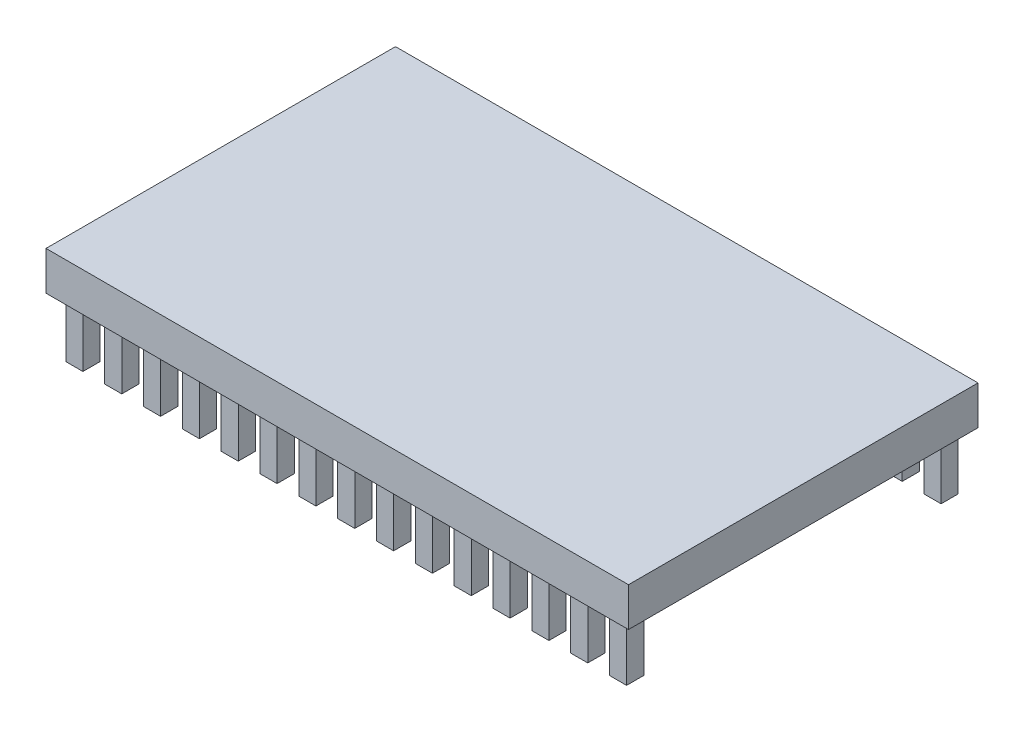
ISO-10303-21;
HEADER;
FILE_DESCRIPTION(('STEP AP214'),'2;1');
FILE_NAME('part.step','',(''),(''),'','','');
FILE_SCHEMA(('AUTOMOTIVE_DESIGN { 1 0 10303 214 1 1 1 1 }'));
ENDSEC;
DATA;
#1=APPLICATION_CONTEXT('core data for automotive mechanical design processes');
#2=APPLICATION_PROTOCOL_DEFINITION('international standard','automotive_design',2000,#1);
#3=PRODUCT_CONTEXT('',#1,'mechanical');
#4=PRODUCT('Part','Part','',(#3));
#5=PRODUCT_RELATED_PRODUCT_CATEGORY('part','',(#4));
#6=PRODUCT_DEFINITION_FORMATION('','',#4);
#7=PRODUCT_DEFINITION_CONTEXT('part definition',#1,'design');
#8=PRODUCT_DEFINITION('design','',#6,#7);
#9=PRODUCT_DEFINITION_SHAPE('','',#8);
#10=(LENGTH_UNIT() NAMED_UNIT(*) SI_UNIT(.MILLI.,.METRE.));
#11=(NAMED_UNIT(*) PLANE_ANGLE_UNIT() SI_UNIT($,.RADIAN.));
#12=(NAMED_UNIT(*) SI_UNIT($,.STERADIAN.) SOLID_ANGLE_UNIT());
#13=UNCERTAINTY_MEASURE_WITH_UNIT(LENGTH_MEASURE(1.E-05),#10,'distance_accuracy_value','');
#14=(GEOMETRIC_REPRESENTATION_CONTEXT(3) GLOBAL_UNCERTAINTY_ASSIGNED_CONTEXT((#13)) GLOBAL_UNIT_ASSIGNED_CONTEXT((#10,
#11,#12)) REPRESENTATION_CONTEXT('',''));
#15=CARTESIAN_POINT('',(0.,0.,0.));
#16=DIRECTION('',(0.,0.,1.));
#17=DIRECTION('',(1.,0.,0.));
#18=AXIS2_PLACEMENT_3D('',#15,#16,#17);
#19=CARTESIAN_POINT('',(0.,0.,0.));
#20=DIRECTION('',(0.,-1.,0.));
#21=DIRECTION('',(0.,0.,-1.));
#22=AXIS2_PLACEMENT_3D('',#19,#20,#21);
#23=PLANE('',#22);
#24=DIRECTION('',(0.,0.,-1.));
#25=VECTOR('',#24,1.);
#26=CARTESIAN_POINT('',(15.,0.,9.));
#27=LINE('',#26,#25);
#28=CARTESIAN_POINT('',(15.,0.,9.));
#29=VERTEX_POINT('',#28);
#30=CARTESIAN_POINT('',(15.,0.,-9.));
#31=VERTEX_POINT('',#30);
#32=EDGE_CURVE('E1669',#29,#31,#27,.T.);
#33=ORIENTED_EDGE('',*,*,#32,.F.);
#34=DIRECTION('',(1.,0.,0.));
#35=VECTOR('',#34,1.);
#36=CARTESIAN_POINT('',(-15.,0.,9.));
#37=LINE('',#36,#35);
#38=CARTESIAN_POINT('',(-15.,0.,9.));
#39=VERTEX_POINT('',#38);
#40=EDGE_CURVE('E1674',#39,#29,#37,.T.);
#41=ORIENTED_EDGE('',*,*,#40,.F.);
#42=DIRECTION('',(0.,0.,1.));
#43=VECTOR('',#42,1.);
#44=CARTESIAN_POINT('',(-15.,0.,9.));
#45=LINE('',#44,#43);
#46=CARTESIAN_POINT('',(-15.,0.,-9.));
#47=VERTEX_POINT('',#46);
#48=EDGE_CURVE('E1685',#47,#39,#45,.T.);
#49=ORIENTED_EDGE('',*,*,#48,.F.);
#50=DIRECTION('',(-1.,0.,0.));
#51=VECTOR('',#50,1.);
#52=CARTESIAN_POINT('',(-15.,0.,-9.));
#53=LINE('',#52,#51);
#54=EDGE_CURVE('E1683',#31,#47,#53,.T.);
#55=ORIENTED_EDGE('',*,*,#54,.F.);
#56=EDGE_LOOP('',(#33,#41,#49,#55));
#57=FACE_BOUND('',#56,.T.);
#58=DIRECTION('',(-1.,0.,0.));
#59=VECTOR('',#58,1.);
#60=CARTESIAN_POINT('',(-14.4419647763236,0.,8.54031935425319));
#61=LINE('',#60,#59);
#62=CARTESIAN_POINT('',(-13.5580352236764,0.,8.54031935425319));
#63=VERTEX_POINT('',#62);
#64=CARTESIAN_POINT('',(-14.4419647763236,0.,8.54031935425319));
#65=VERTEX_POINT('',#64);
#66=EDGE_CURVE('E1654',#63,#65,#61,.T.);
#67=ORIENTED_EDGE('',*,*,#66,.F.);
#68=DIRECTION('',(0.,0.,1.));
#69=VECTOR('',#68,1.);
#70=CARTESIAN_POINT('',(-13.5580352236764,0.,8.54031935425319));
#71=LINE('',#70,#69);
#72=CARTESIAN_POINT('',(-13.5580352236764,0.,7.65638980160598));
#73=VERTEX_POINT('',#72);
#74=EDGE_CURVE('E1633',#73,#63,#71,.T.);
#75=ORIENTED_EDGE('',*,*,#74,.F.);
#76=DIRECTION('',(1.,0.,0.));
#77=VECTOR('',#76,1.);
#78=CARTESIAN_POINT('',(-14.4419647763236,0.,7.65638980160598));
#79=LINE('',#78,#77);
#80=CARTESIAN_POINT('',(-14.4419647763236,0.,7.65638980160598));
#81=VERTEX_POINT('',#80);
#82=EDGE_CURVE('E1645',#81,#73,#79,.T.);
#83=ORIENTED_EDGE('',*,*,#82,.F.);
#84=DIRECTION('',(0.,0.,-1.));
#85=VECTOR('',#84,1.);
#86=CARTESIAN_POINT('',(-14.4419647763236,0.,8.54031935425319));
#87=LINE('',#86,#85);
#88=EDGE_CURVE('E1656',#65,#81,#87,.T.);
#89=ORIENTED_EDGE('',*,*,#88,.F.);
#90=EDGE_LOOP('',(#67,#75,#83,#89));
#91=FACE_BOUND('',#90,.T.);
#92=DIRECTION('',(-1.,0.,0.));
#93=VECTOR('',#92,1.);
#94=CARTESIAN_POINT('',(-12.4419647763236,0.,8.54031935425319));
#95=LINE('',#94,#93);
#96=CARTESIAN_POINT('',(-11.5580352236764,0.,8.54031935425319));
#97=VERTEX_POINT('',#96);
#98=CARTESIAN_POINT('',(-12.4419647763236,0.,8.54031935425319));
#99=VERTEX_POINT('',#98);
#100=EDGE_CURVE('E1628',#97,#99,#95,.T.);
#101=ORIENTED_EDGE('',*,*,#100,.F.);
#102=DIRECTION('',(0.,0.,1.));
#103=VECTOR('',#102,1.);
#104=CARTESIAN_POINT('',(-11.5580352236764,0.,8.54031935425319));
#105=LINE('',#104,#103);
#106=CARTESIAN_POINT('',(-11.5580352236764,0.,7.65638980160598));
#107=VERTEX_POINT('',#106);
#108=EDGE_CURVE('E1630',#107,#97,#105,.T.);
#109=ORIENTED_EDGE('',*,*,#108,.F.);
#110=DIRECTION('',(1.,0.,0.));
#111=VECTOR('',#110,1.);
#112=CARTESIAN_POINT('',(-12.4419647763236,0.,7.65638980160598));
#113=LINE('',#112,#111);
#114=CARTESIAN_POINT('',(-12.4419647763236,0.,7.65638980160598));
#115=VERTEX_POINT('',#114);
#116=EDGE_CURVE('E1622',#115,#107,#113,.T.);
#117=ORIENTED_EDGE('',*,*,#116,.F.);
#118=DIRECTION('',(0.,0.,-1.));
#119=VECTOR('',#118,1.);
#120=CARTESIAN_POINT('',(-12.4419647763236,0.,8.54031935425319));
#121=LINE('',#120,#119);
#122=EDGE_CURVE('E1624',#99,#115,#121,.T.);
#123=ORIENTED_EDGE('',*,*,#122,.F.);
#124=EDGE_LOOP('',(#101,#109,#117,#123));
#125=FACE_BOUND('',#124,.T.);
#126=DIRECTION('',(-1.,0.,0.));
#127=VECTOR('',#126,1.);
#128=CARTESIAN_POINT('',(-10.4419647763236,0.,8.54031935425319));
#129=LINE('',#128,#127);
#130=CARTESIAN_POINT('',(-9.5580352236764,0.,8.54031935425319));
#131=VERTEX_POINT('',#130);
#132=CARTESIAN_POINT('',(-10.4419647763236,0.,8.54031935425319));
#133=VERTEX_POINT('',#132);
#134=EDGE_CURVE('E1599',#131,#133,#129,.T.);
#135=ORIENTED_EDGE('',*,*,#134,.F.);
#136=DIRECTION('',(0.,0.,1.));
#137=VECTOR('',#136,1.);
#138=CARTESIAN_POINT('',(-9.5580352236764,0.,8.54031935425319));
#139=LINE('',#138,#137);
#140=CARTESIAN_POINT('',(-9.5580352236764,0.,7.65638980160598));
#141=VERTEX_POINT('',#140);
#142=EDGE_CURVE('E1601',#141,#131,#139,.T.);
#143=ORIENTED_EDGE('',*,*,#142,.F.);
#144=DIRECTION('',(1.,0.,0.));
#145=VECTOR('',#144,1.);
#146=CARTESIAN_POINT('',(-10.4419647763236,0.,7.65638980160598));
#147=LINE('',#146,#145);
#148=CARTESIAN_POINT('',(-10.4419647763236,0.,7.65638980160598));
#149=VERTEX_POINT('',#148);
#150=EDGE_CURVE('E1593',#149,#141,#147,.T.);
#151=ORIENTED_EDGE('',*,*,#150,.F.);
#152=DIRECTION('',(0.,0.,-1.));
#153=VECTOR('',#152,1.);
#154=CARTESIAN_POINT('',(-10.4419647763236,0.,8.54031935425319));
#155=LINE('',#154,#153);
#156=EDGE_CURVE('E1595',#133,#149,#155,.T.);
#157=ORIENTED_EDGE('',*,*,#156,.F.);
#158=EDGE_LOOP('',(#135,#143,#151,#157));
#159=FACE_BOUND('',#158,.T.);
#160=DIRECTION('',(-1.,0.,0.));
#161=VECTOR('',#160,1.);
#162=CARTESIAN_POINT('',(-8.4419647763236,0.,8.54031935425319));
#163=LINE('',#162,#161);
#164=CARTESIAN_POINT('',(-7.55803522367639,0.,8.54031935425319));
#165=VERTEX_POINT('',#164);
#166=CARTESIAN_POINT('',(-8.4419647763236,0.,8.54031935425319));
#167=VERTEX_POINT('',#166);
#168=EDGE_CURVE('E1570',#165,#167,#163,.T.);
#169=ORIENTED_EDGE('',*,*,#168,.F.);
#170=DIRECTION('',(0.,0.,1.));
#171=VECTOR('',#170,1.);
#172=CARTESIAN_POINT('',(-7.55803522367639,0.,8.54031935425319));
#173=LINE('',#172,#171);
#174=CARTESIAN_POINT('',(-7.55803522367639,0.,7.65638980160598));
#175=VERTEX_POINT('',#174);
#176=EDGE_CURVE('E1572',#175,#165,#173,.T.);
#177=ORIENTED_EDGE('',*,*,#176,.F.);
#178=DIRECTION('',(1.,0.,0.));
#179=VECTOR('',#178,1.);
#180=CARTESIAN_POINT('',(-8.4419647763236,0.,7.65638980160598));
#181=LINE('',#180,#179);
#182=CARTESIAN_POINT('',(-8.4419647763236,0.,7.65638980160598));
#183=VERTEX_POINT('',#182);
#184=EDGE_CURVE('E1564',#183,#175,#181,.T.);
#185=ORIENTED_EDGE('',*,*,#184,.F.);
#186=DIRECTION('',(0.,0.,-1.));
#187=VECTOR('',#186,1.);
#188=CARTESIAN_POINT('',(-8.4419647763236,0.,8.54031935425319));
#189=LINE('',#188,#187);
#190=EDGE_CURVE('E1566',#167,#183,#189,.T.);
#191=ORIENTED_EDGE('',*,*,#190,.F.);
#192=EDGE_LOOP('',(#169,#177,#185,#191));
#193=FACE_BOUND('',#192,.T.);
#194=DIRECTION('',(-1.,0.,0.));
#195=VECTOR('',#194,1.);
#196=CARTESIAN_POINT('',(-6.4419647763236,0.,8.54031935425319));
#197=LINE('',#196,#195);
#198=CARTESIAN_POINT('',(-5.55803522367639,0.,8.54031935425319));
#199=VERTEX_POINT('',#198);
#200=CARTESIAN_POINT('',(-6.4419647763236,0.,8.54031935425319));
#201=VERTEX_POINT('',#200);
#202=EDGE_CURVE('E1541',#199,#201,#197,.T.);
#203=ORIENTED_EDGE('',*,*,#202,.F.);
#204=DIRECTION('',(0.,0.,1.));
#205=VECTOR('',#204,1.);
#206=CARTESIAN_POINT('',(-5.55803522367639,0.,8.54031935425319));
#207=LINE('',#206,#205);
#208=CARTESIAN_POINT('',(-5.55803522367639,0.,7.65638980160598));
#209=VERTEX_POINT('',#208);
#210=EDGE_CURVE('E1543',#209,#199,#207,.T.);
#211=ORIENTED_EDGE('',*,*,#210,.F.);
#212=DIRECTION('',(1.,0.,0.));
#213=VECTOR('',#212,1.);
#214=CARTESIAN_POINT('',(-6.4419647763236,0.,7.65638980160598));
#215=LINE('',#214,#213);
#216=CARTESIAN_POINT('',(-6.4419647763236,0.,7.65638980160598));
#217=VERTEX_POINT('',#216);
#218=EDGE_CURVE('E1535',#217,#209,#215,.T.);
#219=ORIENTED_EDGE('',*,*,#218,.F.);
#220=DIRECTION('',(0.,0.,-1.));
#221=VECTOR('',#220,1.);
#222=CARTESIAN_POINT('',(-6.4419647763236,0.,8.54031935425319));
#223=LINE('',#222,#221);
#224=EDGE_CURVE('E1537',#201,#217,#223,.T.);
#225=ORIENTED_EDGE('',*,*,#224,.F.);
#226=EDGE_LOOP('',(#203,#211,#219,#225));
#227=FACE_BOUND('',#226,.T.);
#228=DIRECTION('',(-1.,0.,0.));
#229=VECTOR('',#228,1.);
#230=CARTESIAN_POINT('',(-4.4419647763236,0.,8.54031935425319));
#231=LINE('',#230,#229);
#232=CARTESIAN_POINT('',(-3.55803522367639,0.,8.54031935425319));
#233=VERTEX_POINT('',#232);
#234=CARTESIAN_POINT('',(-4.4419647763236,0.,8.54031935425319));
#235=VERTEX_POINT('',#234);
#236=EDGE_CURVE('E1512',#233,#235,#231,.T.);
#237=ORIENTED_EDGE('',*,*,#236,.F.);
#238=DIRECTION('',(0.,0.,1.));
#239=VECTOR('',#238,1.);
#240=CARTESIAN_POINT('',(-3.55803522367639,0.,8.54031935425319));
#241=LINE('',#240,#239);
#242=CARTESIAN_POINT('',(-3.55803522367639,0.,7.65638980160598));
#243=VERTEX_POINT('',#242);
#244=EDGE_CURVE('E1514',#243,#233,#241,.T.);
#245=ORIENTED_EDGE('',*,*,#244,.F.);
#246=DIRECTION('',(1.,0.,0.));
#247=VECTOR('',#246,1.);
#248=CARTESIAN_POINT('',(-4.4419647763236,0.,7.65638980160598));
#249=LINE('',#248,#247);
#250=CARTESIAN_POINT('',(-4.4419647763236,0.,7.65638980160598));
#251=VERTEX_POINT('',#250);
#252=EDGE_CURVE('E1506',#251,#243,#249,.T.);
#253=ORIENTED_EDGE('',*,*,#252,.F.);
#254=DIRECTION('',(0.,0.,-1.));
#255=VECTOR('',#254,1.);
#256=CARTESIAN_POINT('',(-4.4419647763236,0.,8.54031935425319));
#257=LINE('',#256,#255);
#258=EDGE_CURVE('E1508',#235,#251,#257,.T.);
#259=ORIENTED_EDGE('',*,*,#258,.F.);
#260=EDGE_LOOP('',(#237,#245,#253,#259));
#261=FACE_BOUND('',#260,.T.);
#262=DIRECTION('',(-1.,0.,0.));
#263=VECTOR('',#262,1.);
#264=CARTESIAN_POINT('',(-2.4419647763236,0.,8.54031935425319));
#265=LINE('',#264,#263);
#266=CARTESIAN_POINT('',(-1.55803522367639,0.,8.54031935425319));
#267=VERTEX_POINT('',#266);
#268=CARTESIAN_POINT('',(-2.4419647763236,0.,8.54031935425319));
#269=VERTEX_POINT('',#268);
#270=EDGE_CURVE('E1483',#267,#269,#265,.T.);
#271=ORIENTED_EDGE('',*,*,#270,.F.);
#272=DIRECTION('',(0.,0.,1.));
#273=VECTOR('',#272,1.);
#274=CARTESIAN_POINT('',(-1.55803522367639,0.,8.54031935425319));
#275=LINE('',#274,#273);
#276=CARTESIAN_POINT('',(-1.55803522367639,0.,7.65638980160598));
#277=VERTEX_POINT('',#276);
#278=EDGE_CURVE('E1485',#277,#267,#275,.T.);
#279=ORIENTED_EDGE('',*,*,#278,.F.);
#280=DIRECTION('',(1.,0.,0.));
#281=VECTOR('',#280,1.);
#282=CARTESIAN_POINT('',(-2.4419647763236,0.,7.65638980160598));
#283=LINE('',#282,#281);
#284=CARTESIAN_POINT('',(-2.4419647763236,0.,7.65638980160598));
#285=VERTEX_POINT('',#284);
#286=EDGE_CURVE('E1477',#285,#277,#283,.T.);
#287=ORIENTED_EDGE('',*,*,#286,.F.);
#288=DIRECTION('',(0.,0.,-1.));
#289=VECTOR('',#288,1.);
#290=CARTESIAN_POINT('',(-2.4419647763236,0.,8.54031935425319));
#291=LINE('',#290,#289);
#292=EDGE_CURVE('E1479',#269,#285,#291,.T.);
#293=ORIENTED_EDGE('',*,*,#292,.F.);
#294=EDGE_LOOP('',(#271,#279,#287,#293));
#295=FACE_BOUND('',#294,.T.);
#296=DIRECTION('',(-1.,0.,0.));
#297=VECTOR('',#296,1.);
#298=CARTESIAN_POINT('',(-0.441964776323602,0.,8.54031935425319));
#299=LINE('',#298,#297);
#300=CARTESIAN_POINT('',(0.441964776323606,0.,8.54031935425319));
#301=VERTEX_POINT('',#300);
#302=CARTESIAN_POINT('',(-0.441964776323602,0.,8.54031935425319));
#303=VERTEX_POINT('',#302);
#304=EDGE_CURVE('E1454',#301,#303,#299,.T.);
#305=ORIENTED_EDGE('',*,*,#304,.F.);
#306=DIRECTION('',(0.,0.,1.));
#307=VECTOR('',#306,1.);
#308=CARTESIAN_POINT('',(0.441964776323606,0.,8.54031935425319));
#309=LINE('',#308,#307);
#310=CARTESIAN_POINT('',(0.441964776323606,0.,7.65638980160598));
#311=VERTEX_POINT('',#310);
#312=EDGE_CURVE('E1456',#311,#301,#309,.T.);
#313=ORIENTED_EDGE('',*,*,#312,.F.);
#314=DIRECTION('',(1.,0.,0.));
#315=VECTOR('',#314,1.);
#316=CARTESIAN_POINT('',(-0.441964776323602,0.,7.65638980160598));
#317=LINE('',#316,#315);
#318=CARTESIAN_POINT('',(-0.441964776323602,0.,7.65638980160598));
#319=VERTEX_POINT('',#318);
#320=EDGE_CURVE('E1448',#319,#311,#317,.T.);
#321=ORIENTED_EDGE('',*,*,#320,.F.);
#322=DIRECTION('',(0.,0.,-1.));
#323=VECTOR('',#322,1.);
#324=CARTESIAN_POINT('',(-0.441964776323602,0.,8.54031935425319));
#325=LINE('',#324,#323);
#326=EDGE_CURVE('E1450',#303,#319,#325,.T.);
#327=ORIENTED_EDGE('',*,*,#326,.F.);
#328=EDGE_LOOP('',(#305,#313,#321,#327));
#329=FACE_BOUND('',#328,.T.);
#330=DIRECTION('',(-1.,0.,0.));
#331=VECTOR('',#330,1.);
#332=CARTESIAN_POINT('',(1.5580352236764,0.,8.54031935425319));
#333=LINE('',#332,#331);
#334=CARTESIAN_POINT('',(2.44196477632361,0.,8.54031935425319));
#335=VERTEX_POINT('',#334);
#336=CARTESIAN_POINT('',(1.5580352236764,0.,8.54031935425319));
#337=VERTEX_POINT('',#336);
#338=EDGE_CURVE('E1425',#335,#337,#333,.T.);
#339=ORIENTED_EDGE('',*,*,#338,.F.);
#340=DIRECTION('',(0.,0.,1.));
#341=VECTOR('',#340,1.);
#342=CARTESIAN_POINT('',(2.44196477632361,0.,8.54031935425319));
#343=LINE('',#342,#341);
#344=CARTESIAN_POINT('',(2.44196477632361,0.,7.65638980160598));
#345=VERTEX_POINT('',#344);
#346=EDGE_CURVE('E1427',#345,#335,#343,.T.);
#347=ORIENTED_EDGE('',*,*,#346,.F.);
#348=DIRECTION('',(1.,0.,0.));
#349=VECTOR('',#348,1.);
#350=CARTESIAN_POINT('',(1.5580352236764,0.,7.65638980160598));
#351=LINE('',#350,#349);
#352=CARTESIAN_POINT('',(1.5580352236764,0.,7.65638980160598));
#353=VERTEX_POINT('',#352);
#354=EDGE_CURVE('E1419',#353,#345,#351,.T.);
#355=ORIENTED_EDGE('',*,*,#354,.F.);
#356=DIRECTION('',(0.,0.,-1.));
#357=VECTOR('',#356,1.);
#358=CARTESIAN_POINT('',(1.5580352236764,0.,8.54031935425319));
#359=LINE('',#358,#357);
#360=EDGE_CURVE('E1421',#337,#353,#359,.T.);
#361=ORIENTED_EDGE('',*,*,#360,.F.);
#362=EDGE_LOOP('',(#339,#347,#355,#361));
#363=FACE_BOUND('',#362,.T.);
#364=DIRECTION('',(-1.,0.,0.));
#365=VECTOR('',#364,1.);
#366=CARTESIAN_POINT('',(3.5580352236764,0.,8.54031935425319));
#367=LINE('',#366,#365);
#368=CARTESIAN_POINT('',(4.44196477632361,0.,8.54031935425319));
#369=VERTEX_POINT('',#368);
#370=CARTESIAN_POINT('',(3.5580352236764,0.,8.54031935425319));
#371=VERTEX_POINT('',#370);
#372=EDGE_CURVE('E1396',#369,#371,#367,.T.);
#373=ORIENTED_EDGE('',*,*,#372,.F.);
#374=DIRECTION('',(0.,0.,1.));
#375=VECTOR('',#374,1.);
#376=CARTESIAN_POINT('',(4.44196477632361,0.,8.54031935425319));
#377=LINE('',#376,#375);
#378=CARTESIAN_POINT('',(4.44196477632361,0.,7.65638980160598));
#379=VERTEX_POINT('',#378);
#380=EDGE_CURVE('E1398',#379,#369,#377,.T.);
#381=ORIENTED_EDGE('',*,*,#380,.F.);
#382=DIRECTION('',(1.,0.,0.));
#383=VECTOR('',#382,1.);
#384=CARTESIAN_POINT('',(3.5580352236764,0.,7.65638980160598));
#385=LINE('',#384,#383);
#386=CARTESIAN_POINT('',(3.5580352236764,0.,7.65638980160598));
#387=VERTEX_POINT('',#386);
#388=EDGE_CURVE('E1390',#387,#379,#385,.T.);
#389=ORIENTED_EDGE('',*,*,#388,.F.);
#390=DIRECTION('',(0.,0.,-1.));
#391=VECTOR('',#390,1.);
#392=CARTESIAN_POINT('',(3.5580352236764,0.,8.54031935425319));
#393=LINE('',#392,#391);
#394=EDGE_CURVE('E1392',#371,#387,#393,.T.);
#395=ORIENTED_EDGE('',*,*,#394,.F.);
#396=EDGE_LOOP('',(#373,#381,#389,#395));
#397=FACE_BOUND('',#396,.T.);
#398=DIRECTION('',(-1.,0.,0.));
#399=VECTOR('',#398,1.);
#400=CARTESIAN_POINT('',(5.5580352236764,0.,8.54031935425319));
#401=LINE('',#400,#399);
#402=CARTESIAN_POINT('',(6.44196477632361,0.,8.54031935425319));
#403=VERTEX_POINT('',#402);
#404=CARTESIAN_POINT('',(5.5580352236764,0.,8.54031935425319));
#405=VERTEX_POINT('',#404);
#406=EDGE_CURVE('E1367',#403,#405,#401,.T.);
#407=ORIENTED_EDGE('',*,*,#406,.F.);
#408=DIRECTION('',(0.,0.,1.));
#409=VECTOR('',#408,1.);
#410=CARTESIAN_POINT('',(6.44196477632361,0.,8.54031935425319));
#411=LINE('',#410,#409);
#412=CARTESIAN_POINT('',(6.44196477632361,0.,7.65638980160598));
#413=VERTEX_POINT('',#412);
#414=EDGE_CURVE('E1369',#413,#403,#411,.T.);
#415=ORIENTED_EDGE('',*,*,#414,.F.);
#416=DIRECTION('',(1.,0.,0.));
#417=VECTOR('',#416,1.);
#418=CARTESIAN_POINT('',(5.5580352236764,0.,7.65638980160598));
#419=LINE('',#418,#417);
#420=CARTESIAN_POINT('',(5.5580352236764,0.,7.65638980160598));
#421=VERTEX_POINT('',#420);
#422=EDGE_CURVE('E1361',#421,#413,#419,.T.);
#423=ORIENTED_EDGE('',*,*,#422,.F.);
#424=DIRECTION('',(0.,0.,-1.));
#425=VECTOR('',#424,1.);
#426=CARTESIAN_POINT('',(5.5580352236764,0.,8.54031935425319));
#427=LINE('',#426,#425);
#428=EDGE_CURVE('E1363',#405,#421,#427,.T.);
#429=ORIENTED_EDGE('',*,*,#428,.F.);
#430=EDGE_LOOP('',(#407,#415,#423,#429));
#431=FACE_BOUND('',#430,.T.);
#432=DIRECTION('',(-1.,0.,0.));
#433=VECTOR('',#432,1.);
#434=CARTESIAN_POINT('',(7.5580352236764,0.,8.54031935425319));
#435=LINE('',#434,#433);
#436=CARTESIAN_POINT('',(8.4419647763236,0.,8.54031935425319));
#437=VERTEX_POINT('',#436);
#438=CARTESIAN_POINT('',(7.5580352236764,0.,8.54031935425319));
#439=VERTEX_POINT('',#438);
#440=EDGE_CURVE('E1338',#437,#439,#435,.T.);
#441=ORIENTED_EDGE('',*,*,#440,.F.);
#442=DIRECTION('',(0.,0.,1.));
#443=VECTOR('',#442,1.);
#444=CARTESIAN_POINT('',(8.4419647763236,0.,8.54031935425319));
#445=LINE('',#444,#443);
#446=CARTESIAN_POINT('',(8.4419647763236,0.,7.65638980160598));
#447=VERTEX_POINT('',#446);
#448=EDGE_CURVE('E1340',#447,#437,#445,.T.);
#449=ORIENTED_EDGE('',*,*,#448,.F.);
#450=DIRECTION('',(1.,0.,0.));
#451=VECTOR('',#450,1.);
#452=CARTESIAN_POINT('',(7.5580352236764,0.,7.65638980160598));
#453=LINE('',#452,#451);
#454=CARTESIAN_POINT('',(7.5580352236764,0.,7.65638980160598));
#455=VERTEX_POINT('',#454);
#456=EDGE_CURVE('E1332',#455,#447,#453,.T.);
#457=ORIENTED_EDGE('',*,*,#456,.F.);
#458=DIRECTION('',(0.,0.,-1.));
#459=VECTOR('',#458,1.);
#460=CARTESIAN_POINT('',(7.5580352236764,0.,8.54031935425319));
#461=LINE('',#460,#459);
#462=EDGE_CURVE('E1334',#439,#455,#461,.T.);
#463=ORIENTED_EDGE('',*,*,#462,.F.);
#464=EDGE_LOOP('',(#441,#449,#457,#463));
#465=FACE_BOUND('',#464,.T.);
#466=DIRECTION('',(-1.,0.,0.));
#467=VECTOR('',#466,1.);
#468=CARTESIAN_POINT('',(9.5580352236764,0.,8.54031935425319));
#469=LINE('',#468,#467);
#470=CARTESIAN_POINT('',(10.4419647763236,0.,8.54031935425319));
#471=VERTEX_POINT('',#470);
#472=CARTESIAN_POINT('',(9.5580352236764,0.,8.54031935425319));
#473=VERTEX_POINT('',#472);
#474=EDGE_CURVE('E1309',#471,#473,#469,.T.);
#475=ORIENTED_EDGE('',*,*,#474,.F.);
#476=DIRECTION('',(0.,0.,1.));
#477=VECTOR('',#476,1.);
#478=CARTESIAN_POINT('',(10.4419647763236,0.,8.54031935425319));
#479=LINE('',#478,#477);
#480=CARTESIAN_POINT('',(10.4419647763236,0.,7.65638980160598));
#481=VERTEX_POINT('',#480);
#482=EDGE_CURVE('E1311',#481,#471,#479,.T.);
#483=ORIENTED_EDGE('',*,*,#482,.F.);
#484=DIRECTION('',(1.,0.,0.));
#485=VECTOR('',#484,1.);
#486=CARTESIAN_POINT('',(9.5580352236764,0.,7.65638980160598));
#487=LINE('',#486,#485);
#488=CARTESIAN_POINT('',(9.5580352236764,0.,7.65638980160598));
#489=VERTEX_POINT('',#488);
#490=EDGE_CURVE('E1303',#489,#481,#487,.T.);
#491=ORIENTED_EDGE('',*,*,#490,.F.);
#492=DIRECTION('',(0.,0.,-1.));
#493=VECTOR('',#492,1.);
#494=CARTESIAN_POINT('',(9.5580352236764,0.,8.54031935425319));
#495=LINE('',#494,#493);
#496=EDGE_CURVE('E1305',#473,#489,#495,.T.);
#497=ORIENTED_EDGE('',*,*,#496,.F.);
#498=EDGE_LOOP('',(#475,#483,#491,#497));
#499=FACE_BOUND('',#498,.T.);
#500=DIRECTION('',(-1.,0.,0.));
#501=VECTOR('',#500,1.);
#502=CARTESIAN_POINT('',(11.5580352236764,0.,8.54031935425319));
#503=LINE('',#502,#501);
#504=CARTESIAN_POINT('',(12.4419647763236,0.,8.54031935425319));
#505=VERTEX_POINT('',#504);
#506=CARTESIAN_POINT('',(11.5580352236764,0.,8.54031935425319));
#507=VERTEX_POINT('',#506);
#508=EDGE_CURVE('E1280',#505,#507,#503,.T.);
#509=ORIENTED_EDGE('',*,*,#508,.F.);
#510=DIRECTION('',(0.,0.,1.));
#511=VECTOR('',#510,1.);
#512=CARTESIAN_POINT('',(12.4419647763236,0.,8.54031935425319));
#513=LINE('',#512,#511);
#514=CARTESIAN_POINT('',(12.4419647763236,0.,7.65638980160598));
#515=VERTEX_POINT('',#514);
#516=EDGE_CURVE('E1282',#515,#505,#513,.T.);
#517=ORIENTED_EDGE('',*,*,#516,.F.);
#518=DIRECTION('',(1.,0.,0.));
#519=VECTOR('',#518,1.);
#520=CARTESIAN_POINT('',(11.5580352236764,0.,7.65638980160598));
#521=LINE('',#520,#519);
#522=CARTESIAN_POINT('',(11.5580352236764,0.,7.65638980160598));
#523=VERTEX_POINT('',#522);
#524=EDGE_CURVE('E1274',#523,#515,#521,.T.);
#525=ORIENTED_EDGE('',*,*,#524,.F.);
#526=DIRECTION('',(0.,0.,-1.));
#527=VECTOR('',#526,1.);
#528=CARTESIAN_POINT('',(11.5580352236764,0.,8.54031935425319));
#529=LINE('',#528,#527);
#530=EDGE_CURVE('E1276',#507,#523,#529,.T.);
#531=ORIENTED_EDGE('',*,*,#530,.F.);
#532=EDGE_LOOP('',(#509,#517,#525,#531));
#533=FACE_BOUND('',#532,.T.);
#534=DIRECTION('',(-1.,0.,0.));
#535=VECTOR('',#534,1.);
#536=CARTESIAN_POINT('',(13.5580352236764,0.,8.54031935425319));
#537=LINE('',#536,#535);
#538=CARTESIAN_POINT('',(14.4419647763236,0.,8.54031935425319));
#539=VERTEX_POINT('',#538);
#540=CARTESIAN_POINT('',(13.5580352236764,0.,8.54031935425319));
#541=VERTEX_POINT('',#540);
#542=EDGE_CURVE('E1251',#539,#541,#537,.T.);
#543=ORIENTED_EDGE('',*,*,#542,.F.);
#544=DIRECTION('',(0.,0.,1.));
#545=VECTOR('',#544,1.);
#546=CARTESIAN_POINT('',(14.4419647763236,0.,8.54031935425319));
#547=LINE('',#546,#545);
#548=CARTESIAN_POINT('',(14.4419647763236,0.,7.65638980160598));
#549=VERTEX_POINT('',#548);
#550=EDGE_CURVE('E1253',#549,#539,#547,.T.);
#551=ORIENTED_EDGE('',*,*,#550,.F.);
#552=DIRECTION('',(1.,0.,0.));
#553=VECTOR('',#552,1.);
#554=CARTESIAN_POINT('',(13.5580352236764,0.,7.65638980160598));
#555=LINE('',#554,#553);
#556=CARTESIAN_POINT('',(13.5580352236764,0.,7.65638980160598));
#557=VERTEX_POINT('',#556);
#558=EDGE_CURVE('E1245',#557,#549,#555,.T.);
#559=ORIENTED_EDGE('',*,*,#558,.F.);
#560=DIRECTION('',(0.,0.,-1.));
#561=VECTOR('',#560,1.);
#562=CARTESIAN_POINT('',(13.5580352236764,0.,8.54031935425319));
#563=LINE('',#562,#561);
#564=EDGE_CURVE('E1247',#541,#557,#563,.T.);
#565=ORIENTED_EDGE('',*,*,#564,.F.);
#566=EDGE_LOOP('',(#543,#551,#559,#565));
#567=FACE_BOUND('',#566,.T.);
#568=DIRECTION('',(0.,0.,1.));
#569=VECTOR('',#568,1.);
#570=CARTESIAN_POINT('',(-1.5580352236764,0.,-8.54031935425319));
#571=LINE('',#570,#569);
#572=CARTESIAN_POINT('',(-1.5580352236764,0.,-8.54031935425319));
#573=VERTEX_POINT('',#572);
#574=CARTESIAN_POINT('',(-1.5580352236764,0.,-7.65638980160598));
#575=VERTEX_POINT('',#574);
#576=EDGE_CURVE('E1222',#573,#575,#571,.T.);
#577=ORIENTED_EDGE('',*,*,#576,.F.);
#578=DIRECTION('',(1.,0.,0.));
#579=VECTOR('',#578,1.);
#580=CARTESIAN_POINT('',(-2.44196477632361,0.,-8.54031935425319));
#581=LINE('',#580,#579);
#582=CARTESIAN_POINT('',(-2.44196477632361,0.,-8.54031935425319));
#583=VERTEX_POINT('',#582);
#584=EDGE_CURVE('E1224',#583,#573,#581,.T.);
#585=ORIENTED_EDGE('',*,*,#584,.F.);
#586=DIRECTION('',(0.,0.,-1.));
#587=VECTOR('',#586,1.);
#588=CARTESIAN_POINT('',(-2.44196477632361,0.,-8.54031935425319));
#589=LINE('',#588,#587);
#590=CARTESIAN_POINT('',(-2.44196477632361,0.,-7.65638980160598));
#591=VERTEX_POINT('',#590);
#592=EDGE_CURVE('E1216',#591,#583,#589,.T.);
#593=ORIENTED_EDGE('',*,*,#592,.F.);
#594=DIRECTION('',(-1.,0.,0.));
#595=VECTOR('',#594,1.);
#596=CARTESIAN_POINT('',(-2.44196477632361,0.,-7.65638980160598));
#597=LINE('',#596,#595);
#598=EDGE_CURVE('E1218',#575,#591,#597,.T.);
#599=ORIENTED_EDGE('',*,*,#598,.F.);
#600=EDGE_LOOP('',(#577,#585,#593,#599));
#601=FACE_BOUND('',#600,.T.);
#602=DIRECTION('',(0.,0.,1.));
#603=VECTOR('',#602,1.);
#604=CARTESIAN_POINT('',(-3.5580352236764,0.,-8.54031935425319));
#605=LINE('',#604,#603);
#606=CARTESIAN_POINT('',(-3.5580352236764,0.,-8.54031935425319));
#607=VERTEX_POINT('',#606);
#608=CARTESIAN_POINT('',(-3.5580352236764,0.,-7.65638980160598));
#609=VERTEX_POINT('',#608);
#610=EDGE_CURVE('E1193',#607,#609,#605,.T.);
#611=ORIENTED_EDGE('',*,*,#610,.F.);
#612=DIRECTION('',(1.,0.,0.));
#613=VECTOR('',#612,1.);
#614=CARTESIAN_POINT('',(-4.44196477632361,0.,-8.54031935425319));
#615=LINE('',#614,#613);
#616=CARTESIAN_POINT('',(-4.44196477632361,0.,-8.54031935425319));
#617=VERTEX_POINT('',#616);
#618=EDGE_CURVE('E1195',#617,#607,#615,.T.);
#619=ORIENTED_EDGE('',*,*,#618,.F.);
#620=DIRECTION('',(0.,0.,-1.));
#621=VECTOR('',#620,1.);
#622=CARTESIAN_POINT('',(-4.44196477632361,0.,-8.54031935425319));
#623=LINE('',#622,#621);
#624=CARTESIAN_POINT('',(-4.44196477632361,0.,-7.65638980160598));
#625=VERTEX_POINT('',#624);
#626=EDGE_CURVE('E1187',#625,#617,#623,.T.);
#627=ORIENTED_EDGE('',*,*,#626,.F.);
#628=DIRECTION('',(-1.,0.,0.));
#629=VECTOR('',#628,1.);
#630=CARTESIAN_POINT('',(-4.44196477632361,0.,-7.65638980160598));
#631=LINE('',#630,#629);
#632=EDGE_CURVE('E1189',#609,#625,#631,.T.);
#633=ORIENTED_EDGE('',*,*,#632,.F.);
#634=EDGE_LOOP('',(#611,#619,#627,#633));
#635=FACE_BOUND('',#634,.T.);
#636=DIRECTION('',(0.,0.,1.));
#637=VECTOR('',#636,1.);
#638=CARTESIAN_POINT('',(-5.5580352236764,0.,-8.54031935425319));
#639=LINE('',#638,#637);
#640=CARTESIAN_POINT('',(-5.5580352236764,0.,-8.54031935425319));
#641=VERTEX_POINT('',#640);
#642=CARTESIAN_POINT('',(-5.5580352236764,0.,-7.65638980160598));
#643=VERTEX_POINT('',#642);
#644=EDGE_CURVE('E1164',#641,#643,#639,.T.);
#645=ORIENTED_EDGE('',*,*,#644,.F.);
#646=DIRECTION('',(1.,0.,0.));
#647=VECTOR('',#646,1.);
#648=CARTESIAN_POINT('',(-6.44196477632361,0.,-8.54031935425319));
#649=LINE('',#648,#647);
#650=CARTESIAN_POINT('',(-6.44196477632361,0.,-8.54031935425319));
#651=VERTEX_POINT('',#650);
#652=EDGE_CURVE('E1166',#651,#641,#649,.T.);
#653=ORIENTED_EDGE('',*,*,#652,.F.);
#654=DIRECTION('',(0.,0.,-1.));
#655=VECTOR('',#654,1.);
#656=CARTESIAN_POINT('',(-6.44196477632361,0.,-8.54031935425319));
#657=LINE('',#656,#655);
#658=CARTESIAN_POINT('',(-6.44196477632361,0.,-7.65638980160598));
#659=VERTEX_POINT('',#658);
#660=EDGE_CURVE('E1158',#659,#651,#657,.T.);
#661=ORIENTED_EDGE('',*,*,#660,.F.);
#662=DIRECTION('',(-1.,0.,0.));
#663=VECTOR('',#662,1.);
#664=CARTESIAN_POINT('',(-6.44196477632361,0.,-7.65638980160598));
#665=LINE('',#664,#663);
#666=EDGE_CURVE('E1160',#643,#659,#665,.T.);
#667=ORIENTED_EDGE('',*,*,#666,.F.);
#668=EDGE_LOOP('',(#645,#653,#661,#667));
#669=FACE_BOUND('',#668,.T.);
#670=DIRECTION('',(1.,0.,0.));
#671=VECTOR('',#670,1.);
#672=CARTESIAN_POINT('',(13.5580352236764,0.,-8.54031935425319));
#673=LINE('',#672,#671);
#674=CARTESIAN_POINT('',(13.5580352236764,0.,-8.54031935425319));
#675=VERTEX_POINT('',#674);
#676=CARTESIAN_POINT('',(14.4419647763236,0.,-8.54031935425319));
#677=VERTEX_POINT('',#676);
#678=EDGE_CURVE('E1135',#675,#677,#673,.T.);
#679=ORIENTED_EDGE('',*,*,#678,.F.);
#680=DIRECTION('',(0.,0.,-1.));
#681=VECTOR('',#680,1.);
#682=CARTESIAN_POINT('',(13.5580352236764,0.,-8.54031935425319));
#683=LINE('',#682,#681);
#684=CARTESIAN_POINT('',(13.5580352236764,0.,-7.65638980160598));
#685=VERTEX_POINT('',#684);
#686=EDGE_CURVE('E1137',#685,#675,#683,.T.);
#687=ORIENTED_EDGE('',*,*,#686,.F.);
#688=DIRECTION('',(-1.,0.,0.));
#689=VECTOR('',#688,1.);
#690=CARTESIAN_POINT('',(13.5580352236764,0.,-7.65638980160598));
#691=LINE('',#690,#689);
#692=CARTESIAN_POINT('',(14.4419647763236,0.,-7.65638980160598));
#693=VERTEX_POINT('',#692);
#694=EDGE_CURVE('E1129',#693,#685,#691,.T.);
#695=ORIENTED_EDGE('',*,*,#694,.F.);
#696=DIRECTION('',(0.,0.,1.));
#697=VECTOR('',#696,1.);
#698=CARTESIAN_POINT('',(14.4419647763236,0.,-8.54031935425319));
#699=LINE('',#698,#697);
#700=EDGE_CURVE('E1131',#677,#693,#699,.T.);
#701=ORIENTED_EDGE('',*,*,#700,.F.);
#702=EDGE_LOOP('',(#679,#687,#695,#701));
#703=FACE_BOUND('',#702,.T.);
#704=DIRECTION('',(0.,0.,1.));
#705=VECTOR('',#704,1.);
#706=CARTESIAN_POINT('',(12.4419647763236,0.,-8.54031935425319));
#707=LINE('',#706,#705);
#708=CARTESIAN_POINT('',(12.4419647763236,0.,-8.54031935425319));
#709=VERTEX_POINT('',#708);
#710=CARTESIAN_POINT('',(12.4419647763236,0.,-7.65638980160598));
#711=VERTEX_POINT('',#710);
#712=EDGE_CURVE('E1106',#709,#711,#707,.T.);
#713=ORIENTED_EDGE('',*,*,#712,.F.);
#714=DIRECTION('',(1.,0.,0.));
#715=VECTOR('',#714,1.);
#716=CARTESIAN_POINT('',(11.5580352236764,0.,-8.54031935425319));
#717=LINE('',#716,#715);
#718=CARTESIAN_POINT('',(11.5580352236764,0.,-8.54031935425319));
#719=VERTEX_POINT('',#718);
#720=EDGE_CURVE('E1108',#719,#709,#717,.T.);
#721=ORIENTED_EDGE('',*,*,#720,.F.);
#722=DIRECTION('',(0.,0.,-1.));
#723=VECTOR('',#722,1.);
#724=CARTESIAN_POINT('',(11.5580352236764,0.,-8.54031935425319));
#725=LINE('',#724,#723);
#726=CARTESIAN_POINT('',(11.5580352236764,0.,-7.65638980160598));
#727=VERTEX_POINT('',#726);
#728=EDGE_CURVE('E1100',#727,#719,#725,.T.);
#729=ORIENTED_EDGE('',*,*,#728,.F.);
#730=DIRECTION('',(-1.,0.,0.));
#731=VECTOR('',#730,1.);
#732=CARTESIAN_POINT('',(11.5580352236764,0.,-7.65638980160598));
#733=LINE('',#732,#731);
#734=EDGE_CURVE('E1102',#711,#727,#733,.T.);
#735=ORIENTED_EDGE('',*,*,#734,.F.);
#736=EDGE_LOOP('',(#713,#721,#729,#735));
#737=FACE_BOUND('',#736,.T.);
#738=DIRECTION('',(0.,0.,1.));
#739=VECTOR('',#738,1.);
#740=CARTESIAN_POINT('',(10.4419647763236,0.,-8.54031935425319));
#741=LINE('',#740,#739);
#742=CARTESIAN_POINT('',(10.4419647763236,0.,-8.54031935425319));
#743=VERTEX_POINT('',#742);
#744=CARTESIAN_POINT('',(10.4419647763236,0.,-7.65638980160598));
#745=VERTEX_POINT('',#744);
#746=EDGE_CURVE('E1077',#743,#745,#741,.T.);
#747=ORIENTED_EDGE('',*,*,#746,.F.);
#748=DIRECTION('',(1.,0.,0.));
#749=VECTOR('',#748,1.);
#750=CARTESIAN_POINT('',(9.55803522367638,0.,-8.54031935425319));
#751=LINE('',#750,#749);
#752=CARTESIAN_POINT('',(9.55803522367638,0.,-8.54031935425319));
#753=VERTEX_POINT('',#752);
#754=EDGE_CURVE('E1079',#753,#743,#751,.T.);
#755=ORIENTED_EDGE('',*,*,#754,.F.);
#756=DIRECTION('',(0.,0.,-1.));
#757=VECTOR('',#756,1.);
#758=CARTESIAN_POINT('',(9.55803522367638,0.,-8.54031935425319));
#759=LINE('',#758,#757);
#760=CARTESIAN_POINT('',(9.55803522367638,0.,-7.65638980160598));
#761=VERTEX_POINT('',#760);
#762=EDGE_CURVE('E1071',#761,#753,#759,.T.);
#763=ORIENTED_EDGE('',*,*,#762,.F.);
#764=DIRECTION('',(-1.,0.,0.));
#765=VECTOR('',#764,1.);
#766=CARTESIAN_POINT('',(9.55803522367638,0.,-7.65638980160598));
#767=LINE('',#766,#765);
#768=EDGE_CURVE('E1073',#745,#761,#767,.T.);
#769=ORIENTED_EDGE('',*,*,#768,.F.);
#770=EDGE_LOOP('',(#747,#755,#763,#769));
#771=FACE_BOUND('',#770,.T.);
#772=DIRECTION('',(0.,0.,1.));
#773=VECTOR('',#772,1.);
#774=CARTESIAN_POINT('',(8.44196477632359,0.,-8.54031935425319));
#775=LINE('',#774,#773);
#776=CARTESIAN_POINT('',(8.44196477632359,0.,-8.54031935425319));
#777=VERTEX_POINT('',#776);
#778=CARTESIAN_POINT('',(8.44196477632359,0.,-7.65638980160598));
#779=VERTEX_POINT('',#778);
#780=EDGE_CURVE('E1048',#777,#779,#775,.T.);
#781=ORIENTED_EDGE('',*,*,#780,.F.);
#782=DIRECTION('',(1.,0.,0.));
#783=VECTOR('',#782,1.);
#784=CARTESIAN_POINT('',(7.55803522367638,0.,-8.54031935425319));
#785=LINE('',#784,#783);
#786=CARTESIAN_POINT('',(7.55803522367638,0.,-8.54031935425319));
#787=VERTEX_POINT('',#786);
#788=EDGE_CURVE('E1050',#787,#777,#785,.T.);
#789=ORIENTED_EDGE('',*,*,#788,.F.);
#790=DIRECTION('',(0.,0.,-1.));
#791=VECTOR('',#790,1.);
#792=CARTESIAN_POINT('',(7.55803522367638,0.,-8.54031935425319));
#793=LINE('',#792,#791);
#794=CARTESIAN_POINT('',(7.55803522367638,0.,-7.65638980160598));
#795=VERTEX_POINT('',#794);
#796=EDGE_CURVE('E1042',#795,#787,#793,.T.);
#797=ORIENTED_EDGE('',*,*,#796,.F.);
#798=DIRECTION('',(-1.,0.,0.));
#799=VECTOR('',#798,1.);
#800=CARTESIAN_POINT('',(7.55803522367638,0.,-7.65638980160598));
#801=LINE('',#800,#799);
#802=EDGE_CURVE('E1044',#779,#795,#801,.T.);
#803=ORIENTED_EDGE('',*,*,#802,.F.);
#804=EDGE_LOOP('',(#781,#789,#797,#803));
#805=FACE_BOUND('',#804,.T.);
#806=DIRECTION('',(0.,0.,1.));
#807=VECTOR('',#806,1.);
#808=CARTESIAN_POINT('',(6.44196477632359,0.,-8.54031935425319));
#809=LINE('',#808,#807);
#810=CARTESIAN_POINT('',(6.44196477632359,0.,-8.54031935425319));
#811=VERTEX_POINT('',#810);
#812=CARTESIAN_POINT('',(6.44196477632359,0.,-7.65638980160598));
#813=VERTEX_POINT('',#812);
#814=EDGE_CURVE('E1019',#811,#813,#809,.T.);
#815=ORIENTED_EDGE('',*,*,#814,.F.);
#816=DIRECTION('',(1.,0.,0.));
#817=VECTOR('',#816,1.);
#818=CARTESIAN_POINT('',(5.55803522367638,0.,-8.54031935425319));
#819=LINE('',#818,#817);
#820=CARTESIAN_POINT('',(5.55803522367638,0.,-8.54031935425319));
#821=VERTEX_POINT('',#820);
#822=EDGE_CURVE('E1021',#821,#811,#819,.T.);
#823=ORIENTED_EDGE('',*,*,#822,.F.);
#824=DIRECTION('',(0.,0.,-1.));
#825=VECTOR('',#824,1.);
#826=CARTESIAN_POINT('',(5.55803522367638,0.,-8.54031935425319));
#827=LINE('',#826,#825);
#828=CARTESIAN_POINT('',(5.55803522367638,0.,-7.65638980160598));
#829=VERTEX_POINT('',#828);
#830=EDGE_CURVE('E1013',#829,#821,#827,.T.);
#831=ORIENTED_EDGE('',*,*,#830,.F.);
#832=DIRECTION('',(-1.,0.,0.));
#833=VECTOR('',#832,1.);
#834=CARTESIAN_POINT('',(5.55803522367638,0.,-7.65638980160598));
#835=LINE('',#834,#833);
#836=EDGE_CURVE('E1015',#813,#829,#835,.T.);
#837=ORIENTED_EDGE('',*,*,#836,.F.);
#838=EDGE_LOOP('',(#815,#823,#831,#837));
#839=FACE_BOUND('',#838,.T.);
#840=DIRECTION('',(0.,0.,1.));
#841=VECTOR('',#840,1.);
#842=CARTESIAN_POINT('',(4.44196477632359,0.,-8.54031935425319));
#843=LINE('',#842,#841);
#844=CARTESIAN_POINT('',(4.44196477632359,0.,-8.54031935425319));
#845=VERTEX_POINT('',#844);
#846=CARTESIAN_POINT('',(4.44196477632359,0.,-7.65638980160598));
#847=VERTEX_POINT('',#846);
#848=EDGE_CURVE('E990',#845,#847,#843,.T.);
#849=ORIENTED_EDGE('',*,*,#848,.F.);
#850=DIRECTION('',(1.,0.,0.));
#851=VECTOR('',#850,1.);
#852=CARTESIAN_POINT('',(3.55803522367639,0.,-8.54031935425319));
#853=LINE('',#852,#851);
#854=CARTESIAN_POINT('',(3.55803522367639,0.,-8.54031935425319));
#855=VERTEX_POINT('',#854);
#856=EDGE_CURVE('E992',#855,#845,#853,.T.);
#857=ORIENTED_EDGE('',*,*,#856,.F.);
#858=DIRECTION('',(0.,0.,-1.));
#859=VECTOR('',#858,1.);
#860=CARTESIAN_POINT('',(3.55803522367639,0.,-8.54031935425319));
#861=LINE('',#860,#859);
#862=CARTESIAN_POINT('',(3.55803522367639,0.,-7.65638980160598));
#863=VERTEX_POINT('',#862);
#864=EDGE_CURVE('E984',#863,#855,#861,.T.);
#865=ORIENTED_EDGE('',*,*,#864,.F.);
#866=DIRECTION('',(-1.,0.,0.));
#867=VECTOR('',#866,1.);
#868=CARTESIAN_POINT('',(3.55803522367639,0.,-7.65638980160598));
#869=LINE('',#868,#867);
#870=EDGE_CURVE('E986',#847,#863,#869,.T.);
#871=ORIENTED_EDGE('',*,*,#870,.F.);
#872=EDGE_LOOP('',(#849,#857,#865,#871));
#873=FACE_BOUND('',#872,.T.);
#874=DIRECTION('',(0.,0.,1.));
#875=VECTOR('',#874,1.);
#876=CARTESIAN_POINT('',(2.44196477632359,0.,-8.54031935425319));
#877=LINE('',#876,#875);
#878=CARTESIAN_POINT('',(2.44196477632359,0.,-8.54031935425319));
#879=VERTEX_POINT('',#878);
#880=CARTESIAN_POINT('',(2.44196477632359,0.,-7.65638980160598));
#881=VERTEX_POINT('',#880);
#882=EDGE_CURVE('E961',#879,#881,#877,.T.);
#883=ORIENTED_EDGE('',*,*,#882,.F.);
#884=DIRECTION('',(1.,0.,0.));
#885=VECTOR('',#884,1.);
#886=CARTESIAN_POINT('',(1.55803522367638,0.,-8.54031935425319));
#887=LINE('',#886,#885);
#888=CARTESIAN_POINT('',(1.55803522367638,0.,-8.54031935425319));
#889=VERTEX_POINT('',#888);
#890=EDGE_CURVE('E963',#889,#879,#887,.T.);
#891=ORIENTED_EDGE('',*,*,#890,.F.);
#892=DIRECTION('',(0.,0.,-1.));
#893=VECTOR('',#892,1.);
#894=CARTESIAN_POINT('',(1.55803522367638,0.,-8.54031935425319));
#895=LINE('',#894,#893);
#896=CARTESIAN_POINT('',(1.55803522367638,0.,-7.65638980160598));
#897=VERTEX_POINT('',#896);
#898=EDGE_CURVE('E955',#897,#889,#895,.T.);
#899=ORIENTED_EDGE('',*,*,#898,.F.);
#900=DIRECTION('',(-1.,0.,0.));
#901=VECTOR('',#900,1.);
#902=CARTESIAN_POINT('',(1.55803522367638,0.,-7.65638980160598));
#903=LINE('',#902,#901);
#904=EDGE_CURVE('E957',#881,#897,#903,.T.);
#905=ORIENTED_EDGE('',*,*,#904,.F.);
#906=EDGE_LOOP('',(#883,#891,#899,#905));
#907=FACE_BOUND('',#906,.T.);
#908=DIRECTION('',(0.,0.,1.));
#909=VECTOR('',#908,1.);
#910=CARTESIAN_POINT('',(0.441964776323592,0.,-8.54031935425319));
#911=LINE('',#910,#909);
#912=CARTESIAN_POINT('',(0.441964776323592,0.,-8.54031935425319));
#913=VERTEX_POINT('',#912);
#914=CARTESIAN_POINT('',(0.441964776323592,0.,-7.65638980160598));
#915=VERTEX_POINT('',#914);
#916=EDGE_CURVE('E932',#913,#915,#911,.T.);
#917=ORIENTED_EDGE('',*,*,#916,.F.);
#918=DIRECTION('',(1.,0.,0.));
#919=VECTOR('',#918,1.);
#920=CARTESIAN_POINT('',(-0.441964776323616,0.,-8.54031935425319));
#921=LINE('',#920,#919);
#922=CARTESIAN_POINT('',(-0.441964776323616,0.,-8.54031935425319));
#923=VERTEX_POINT('',#922);
#924=EDGE_CURVE('E934',#923,#913,#921,.T.);
#925=ORIENTED_EDGE('',*,*,#924,.F.);
#926=DIRECTION('',(0.,0.,-1.));
#927=VECTOR('',#926,1.);
#928=CARTESIAN_POINT('',(-0.441964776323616,0.,-8.54031935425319));
#929=LINE('',#928,#927);
#930=CARTESIAN_POINT('',(-0.441964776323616,0.,-7.65638980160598));
#931=VERTEX_POINT('',#930);
#932=EDGE_CURVE('E926',#931,#923,#929,.T.);
#933=ORIENTED_EDGE('',*,*,#932,.F.);
#934=DIRECTION('',(-1.,0.,0.));
#935=VECTOR('',#934,1.);
#936=CARTESIAN_POINT('',(-0.441964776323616,0.,-7.65638980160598));
#937=LINE('',#936,#935);
#938=EDGE_CURVE('E928',#915,#931,#937,.T.);
#939=ORIENTED_EDGE('',*,*,#938,.F.);
#940=EDGE_LOOP('',(#917,#925,#933,#939));
#941=FACE_BOUND('',#940,.T.);
#942=DIRECTION('',(1.,0.,0.));
#943=VECTOR('',#942,1.);
#944=CARTESIAN_POINT('',(-14.4419647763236,0.,-8.54031935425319));
#945=LINE('',#944,#943);
#946=CARTESIAN_POINT('',(-14.4419647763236,0.,-8.54031935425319));
#947=VERTEX_POINT('',#946);
#948=CARTESIAN_POINT('',(-13.5580352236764,0.,-8.54031935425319));
#949=VERTEX_POINT('',#948);
#950=EDGE_CURVE('E903',#947,#949,#945,.T.);
#951=ORIENTED_EDGE('',*,*,#950,.F.);
#952=DIRECTION('',(0.,0.,-1.));
#953=VECTOR('',#952,1.);
#954=CARTESIAN_POINT('',(-14.4419647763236,0.,-8.54031935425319));
#955=LINE('',#954,#953);
#956=CARTESIAN_POINT('',(-14.4419647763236,0.,-7.65638980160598));
#957=VERTEX_POINT('',#956);
#958=EDGE_CURVE('E905',#957,#947,#955,.T.);
#959=ORIENTED_EDGE('',*,*,#958,.F.);
#960=DIRECTION('',(-1.,0.,0.));
#961=VECTOR('',#960,1.);
#962=CARTESIAN_POINT('',(-14.4419647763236,0.,-7.65638980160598));
#963=LINE('',#962,#961);
#964=CARTESIAN_POINT('',(-13.5580352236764,0.,-7.65638980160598));
#965=VERTEX_POINT('',#964);
#966=EDGE_CURVE('E897',#965,#957,#963,.T.);
#967=ORIENTED_EDGE('',*,*,#966,.F.);
#968=DIRECTION('',(0.,0.,1.));
#969=VECTOR('',#968,1.);
#970=CARTESIAN_POINT('',(-13.5580352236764,0.,-8.54031935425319));
#971=LINE('',#970,#969);
#972=EDGE_CURVE('E899',#949,#965,#971,.T.);
#973=ORIENTED_EDGE('',*,*,#972,.F.);
#974=EDGE_LOOP('',(#951,#959,#967,#973));
#975=FACE_BOUND('',#974,.T.);
#976=DIRECTION('',(0.,0.,1.));
#977=VECTOR('',#976,1.);
#978=CARTESIAN_POINT('',(-7.5580352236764,0.,-8.54031935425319));
#979=LINE('',#978,#977);
#980=CARTESIAN_POINT('',(-7.5580352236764,0.,-8.54031935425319));
#981=VERTEX_POINT('',#980);
#982=CARTESIAN_POINT('',(-7.5580352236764,0.,-7.65638980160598));
#983=VERTEX_POINT('',#982);
#984=EDGE_CURVE('E874',#981,#983,#979,.T.);
#985=ORIENTED_EDGE('',*,*,#984,.F.);
#986=DIRECTION('',(1.,0.,0.));
#987=VECTOR('',#986,1.);
#988=CARTESIAN_POINT('',(-8.44196477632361,0.,-8.54031935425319));
#989=LINE('',#988,#987);
#990=CARTESIAN_POINT('',(-8.44196477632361,0.,-8.54031935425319));
#991=VERTEX_POINT('',#990);
#992=EDGE_CURVE('E876',#991,#981,#989,.T.);
#993=ORIENTED_EDGE('',*,*,#992,.F.);
#994=DIRECTION('',(0.,0.,-1.));
#995=VECTOR('',#994,1.);
#996=CARTESIAN_POINT('',(-8.44196477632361,0.,-8.54031935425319));
#997=LINE('',#996,#995);
#998=CARTESIAN_POINT('',(-8.44196477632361,0.,-7.65638980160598));
#999=VERTEX_POINT('',#998);
#1000=EDGE_CURVE('E868',#999,#991,#997,.T.);
#1001=ORIENTED_EDGE('',*,*,#1000,.F.);
#1002=DIRECTION('',(-1.,0.,0.));
#1003=VECTOR('',#1002,1.);
#1004=CARTESIAN_POINT('',(-8.44196477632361,0.,-7.65638980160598));
#1005=LINE('',#1004,#1003);
#1006=EDGE_CURVE('E870',#983,#999,#1005,.T.);
#1007=ORIENTED_EDGE('',*,*,#1006,.F.);
#1008=EDGE_LOOP('',(#985,#993,#1001,#1007));
#1009=FACE_BOUND('',#1008,.T.);
#1010=DIRECTION('',(0.,0.,1.));
#1011=VECTOR('',#1010,1.);
#1012=CARTESIAN_POINT('',(-9.5580352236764,0.,-8.54031935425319));
#1013=LINE('',#1012,#1011);
#1014=CARTESIAN_POINT('',(-9.5580352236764,0.,-8.54031935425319));
#1015=VERTEX_POINT('',#1014);
#1016=CARTESIAN_POINT('',(-9.5580352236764,0.,-7.65638980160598));
#1017=VERTEX_POINT('',#1016);
#1018=EDGE_CURVE('E845',#1015,#1017,#1013,.T.);
#1019=ORIENTED_EDGE('',*,*,#1018,.F.);
#1020=DIRECTION('',(1.,0.,0.));
#1021=VECTOR('',#1020,1.);
#1022=CARTESIAN_POINT('',(-10.4419647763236,0.,-8.54031935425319));
#1023=LINE('',#1022,#1021);
#1024=CARTESIAN_POINT('',(-10.4419647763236,0.,-8.54031935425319));
#1025=VERTEX_POINT('',#1024);
#1026=EDGE_CURVE('E847',#1025,#1015,#1023,.T.);
#1027=ORIENTED_EDGE('',*,*,#1026,.F.);
#1028=DIRECTION('',(0.,0.,-1.));
#1029=VECTOR('',#1028,1.);
#1030=CARTESIAN_POINT('',(-10.4419647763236,0.,-8.54031935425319));
#1031=LINE('',#1030,#1029);
#1032=CARTESIAN_POINT('',(-10.4419647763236,0.,-7.65638980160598));
#1033=VERTEX_POINT('',#1032);
#1034=EDGE_CURVE('E840',#1033,#1025,#1031,.T.);
#1035=ORIENTED_EDGE('',*,*,#1034,.F.);
#1036=DIRECTION('',(-1.,0.,0.));
#1037=VECTOR('',#1036,1.);
#1038=CARTESIAN_POINT('',(-10.4419647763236,0.,-7.65638980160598));
#1039=LINE('',#1038,#1037);
#1040=EDGE_CURVE('E842',#1017,#1033,#1039,.T.);
#1041=ORIENTED_EDGE('',*,*,#1040,.F.);
#1042=EDGE_LOOP('',(#1019,#1027,#1035,#1041));
#1043=FACE_BOUND('',#1042,.T.);
#1044=DIRECTION('',(0.,0.,1.));
#1045=VECTOR('',#1044,1.);
#1046=CARTESIAN_POINT('',(-11.5580352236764,0.,-8.54031935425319));
#1047=LINE('',#1046,#1045);
#1048=CARTESIAN_POINT('',(-11.5580352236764,0.,-8.54031935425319));
#1049=VERTEX_POINT('',#1048);
#1050=CARTESIAN_POINT('',(-11.5580352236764,0.,-7.65638980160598));
#1051=VERTEX_POINT('',#1050);
#1052=EDGE_CURVE('E819',#1049,#1051,#1047,.T.);
#1053=ORIENTED_EDGE('',*,*,#1052,.F.);
#1054=DIRECTION('',(1.,0.,0.));
#1055=VECTOR('',#1054,1.);
#1056=CARTESIAN_POINT('',(-12.4419647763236,0.,-8.54031935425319));
#1057=LINE('',#1056,#1055);
#1058=CARTESIAN_POINT('',(-12.4419647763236,0.,-8.54031935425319));
#1059=VERTEX_POINT('',#1058);
#1060=EDGE_CURVE('E814',#1059,#1049,#1057,.T.);
#1061=ORIENTED_EDGE('',*,*,#1060,.F.);
#1062=DIRECTION('',(0.,0.,-1.));
#1063=VECTOR('',#1062,1.);
#1064=CARTESIAN_POINT('',(-12.4419647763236,0.,-8.54031935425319));
#1065=LINE('',#1064,#1063);
#1066=CARTESIAN_POINT('',(-12.4419647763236,0.,-7.65638980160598));
#1067=VERTEX_POINT('',#1066);
#1068=EDGE_CURVE('E799',#1067,#1059,#1065,.T.);
#1069=ORIENTED_EDGE('',*,*,#1068,.F.);
#1070=DIRECTION('',(-1.,0.,0.));
#1071=VECTOR('',#1070,1.);
#1072=CARTESIAN_POINT('',(-12.4419647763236,0.,-7.65638980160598));
#1073=LINE('',#1072,#1071);
#1074=EDGE_CURVE('E807',#1051,#1067,#1073,.T.);
#1075=ORIENTED_EDGE('',*,*,#1074,.F.);
#1076=EDGE_LOOP('',(#1053,#1061,#1069,#1075));
#1077=FACE_BOUND('',#1076,.T.);
#1078=ADVANCED_FACE('F37',(#57,#91,#125,#159,#193,#227,#261,#295,#329,#363,#397,#431,#465,#499,
#533,#567,#601,#635,#669,#703,#737,#771,#805,#839,#873,#907,#941,#975,#1009,#1043,#1077),#23,.T.);
#1079=CARTESIAN_POINT('',(15.,2.,9.));
#1080=DIRECTION('',(-1.,0.,0.));
#1081=DIRECTION('',(0.,0.,1.));
#1082=AXIS2_PLACEMENT_3D('',#1079,#1080,#1081);
#1083=PLANE('',#1082);
#1084=ORIENTED_EDGE('',*,*,#32,.T.);
#1085=DIRECTION('',(0.,-1.,0.));
#1086=VECTOR('',#1085,1.);
#1087=CARTESIAN_POINT('',(15.,2.,-9.));
#1088=LINE('',#1087,#1086);
#1089=CARTESIAN_POINT('',(15.,2.,-9.));
#1090=VERTEX_POINT('',#1089);
#1091=EDGE_CURVE('E11',#1090,#31,#1088,.T.);
#1092=ORIENTED_EDGE('',*,*,#1091,.F.);
#1093=DIRECTION('',(0.,0.,-1.));
#1094=VECTOR('',#1093,1.);
#1095=CARTESIAN_POINT('',(15.,2.,9.));
#1096=LINE('',#1095,#1094);
#1097=CARTESIAN_POINT('',(15.,2.,9.));
#1098=VERTEX_POINT('',#1097);
#1099=EDGE_CURVE('E1670',#1098,#1090,#1096,.T.);
#1100=ORIENTED_EDGE('',*,*,#1099,.F.);
#1101=DIRECTION('',(0.,-1.,0.));
#1102=VECTOR('',#1101,1.);
#1103=CARTESIAN_POINT('',(15.,2.,9.));
#1104=LINE('',#1103,#1102);
#1105=EDGE_CURVE('E1680',#1098,#29,#1104,.T.);
#1106=ORIENTED_EDGE('',*,*,#1105,.T.);
#1107=EDGE_LOOP('',(#1084,#1092,#1100,#1106));
#1108=FACE_BOUND('',#1107,.T.);
#1109=ADVANCED_FACE('F39',(#1108),#1083,.F.);
#1110=CARTESIAN_POINT('',(-15.,2.,-9.));
#1111=DIRECTION('',(0.,0.,1.));
#1112=DIRECTION('',(1.,0.,0.));
#1113=AXIS2_PLACEMENT_3D('',#1110,#1111,#1112);
#1114=PLANE('',#1113);
#1115=ORIENTED_EDGE('',*,*,#54,.T.);
#1116=DIRECTION('',(0.,-1.,0.));
#1117=VECTOR('',#1116,1.);
#1118=CARTESIAN_POINT('',(-15.,2.,-9.));
#1119=LINE('',#1118,#1117);
#1120=CARTESIAN_POINT('',(-15.,2.,-9.));
#1121=VERTEX_POINT('',#1120);
#1122=EDGE_CURVE('E45',#1121,#47,#1119,.T.);
#1123=ORIENTED_EDGE('',*,*,#1122,.F.);
#1124=DIRECTION('',(-1.,0.,0.));
#1125=VECTOR('',#1124,1.);
#1126=CARTESIAN_POINT('',(-15.,2.,-9.));
#1127=LINE('',#1126,#1125);
#1128=EDGE_CURVE('E1673',#1090,#1121,#1127,.T.);
#1129=ORIENTED_EDGE('',*,*,#1128,.F.);
#1130=ORIENTED_EDGE('',*,*,#1091,.T.);
#1131=EDGE_LOOP('',(#1115,#1123,#1129,#1130));
#1132=FACE_BOUND('',#1131,.T.);
#1133=ADVANCED_FACE('F1713',(#1132),#1114,.F.);
#1134=CARTESIAN_POINT('',(-15.,2.,9.));
#1135=DIRECTION('',(1.,0.,0.));
#1136=DIRECTION('',(0.,0.,-1.));
#1137=AXIS2_PLACEMENT_3D('',#1134,#1135,#1136);
#1138=PLANE('',#1137);
#1139=ORIENTED_EDGE('',*,*,#48,.T.);
#1140=DIRECTION('',(0.,-1.,0.));
#1141=VECTOR('',#1140,1.);
#1142=CARTESIAN_POINT('',(-15.,2.,9.));
#1143=LINE('',#1142,#1141);
#1144=CARTESIAN_POINT('',(-15.,2.,9.));
#1145=VERTEX_POINT('',#1144);
#1146=EDGE_CURVE('E1690',#1145,#39,#1143,.T.);
#1147=ORIENTED_EDGE('',*,*,#1146,.F.);
#1148=DIRECTION('',(0.,0.,1.));
#1149=VECTOR('',#1148,1.);
#1150=CARTESIAN_POINT('',(-15.,2.,9.));
#1151=LINE('',#1150,#1149);
#1152=EDGE_CURVE('E1676',#1121,#1145,#1151,.T.);
#1153=ORIENTED_EDGE('',*,*,#1152,.F.);
#1154=ORIENTED_EDGE('',*,*,#1122,.T.);
#1155=EDGE_LOOP('',(#1139,#1147,#1153,#1154));
#1156=FACE_BOUND('',#1155,.T.);
#1157=ADVANCED_FACE('F1697',(#1156),#1138,.F.);
#1158=CARTESIAN_POINT('',(-15.,2.,9.));
#1159=DIRECTION('',(0.,0.,-1.));
#1160=DIRECTION('',(-1.,0.,0.));
#1161=AXIS2_PLACEMENT_3D('',#1158,#1159,#1160);
#1162=PLANE('',#1161);
#1163=ORIENTED_EDGE('',*,*,#40,.T.);
#1164=ORIENTED_EDGE('',*,*,#1105,.F.);
#1165=DIRECTION('',(1.,0.,0.));
#1166=VECTOR('',#1165,1.);
#1167=CARTESIAN_POINT('',(-15.,2.,9.));
#1168=LINE('',#1167,#1166);
#1169=EDGE_CURVE('E1678',#1145,#1098,#1168,.T.);
#1170=ORIENTED_EDGE('',*,*,#1169,.F.);
#1171=ORIENTED_EDGE('',*,*,#1146,.T.);
#1172=EDGE_LOOP('',(#1163,#1164,#1170,#1171));
#1173=FACE_BOUND('',#1172,.T.);
#1174=ADVANCED_FACE('F1706',(#1173),#1162,.F.);
#1175=CARTESIAN_POINT('',(0.,2.,0.));
#1176=DIRECTION('',(0.,-1.,0.));
#1177=DIRECTION('',(0.,0.,-1.));
#1178=AXIS2_PLACEMENT_3D('',#1175,#1176,#1177);
#1179=PLANE('',#1178);
#1180=ORIENTED_EDGE('',*,*,#1099,.T.);
#1181=ORIENTED_EDGE('',*,*,#1128,.T.);
#1182=ORIENTED_EDGE('',*,*,#1152,.T.);
#1183=ORIENTED_EDGE('',*,*,#1169,.T.);
#1184=EDGE_LOOP('',(#1180,#1181,#1182,#1183));
#1185=FACE_BOUND('',#1184,.T.);
#1186=ADVANCED_FACE('F1712',(#1185),#1179,.F.);
#1187=CARTESIAN_POINT('',(-13.5580352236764,-3.,8.54031935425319));
#1188=DIRECTION('',(-1.,0.,0.));
#1189=DIRECTION('',(0.,0.,1.));
#1190=AXIS2_PLACEMENT_3D('',#1187,#1188,#1189);
#1191=PLANE('',#1190);
#1192=ORIENTED_EDGE('',*,*,#74,.T.);
#1193=DIRECTION('',(0.,1.,0.));
#1194=VECTOR('',#1193,1.);
#1195=CARTESIAN_POINT('',(-13.5580352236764,-3.,8.54031935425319));
#1196=LINE('',#1195,#1194);
#1197=CARTESIAN_POINT('',(-13.5580352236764,-3.,8.54031935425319));
#1198=VERTEX_POINT('',#1197);
#1199=EDGE_CURVE('E1667',#1198,#63,#1196,.T.);
#1200=ORIENTED_EDGE('',*,*,#1199,.F.);
#1201=DIRECTION('',(0.,0.,1.));
#1202=VECTOR('',#1201,1.);
#1203=CARTESIAN_POINT('',(-13.5580352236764,-3.,8.54031935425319));
#1204=LINE('',#1203,#1202);
#1205=CARTESIAN_POINT('',(-13.5580352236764,-3.,7.65638980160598));
#1206=VERTEX_POINT('',#1205);
#1207=EDGE_CURVE('E1641',#1206,#1198,#1204,.T.);
#1208=ORIENTED_EDGE('',*,*,#1207,.F.);
#1209=DIRECTION('',(0.,1.,0.));
#1210=VECTOR('',#1209,1.);
#1211=CARTESIAN_POINT('',(-13.5580352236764,-3.,7.65638980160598));
#1212=LINE('',#1211,#1210);
#1213=EDGE_CURVE('E1651',#1206,#73,#1212,.T.);
#1214=ORIENTED_EDGE('',*,*,#1213,.T.);
#1215=EDGE_LOOP('',(#1192,#1200,#1208,#1214));
#1216=FACE_BOUND('',#1215,.T.);
#1217=ADVANCED_FACE('F1731',(#1216),#1191,.F.);
#1218=CARTESIAN_POINT('',(-14.4419647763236,-3.,8.54031935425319));
#1219=DIRECTION('',(0.,0.,-1.));
#1220=DIRECTION('',(-1.,0.,0.));
#1221=AXIS2_PLACEMENT_3D('',#1218,#1219,#1220);
#1222=PLANE('',#1221);
#1223=ORIENTED_EDGE('',*,*,#66,.T.);
#1224=DIRECTION('',(0.,1.,0.));
#1225=VECTOR('',#1224,1.);
#1226=CARTESIAN_POINT('',(-14.4419647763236,-3.,8.54031935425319));
#1227=LINE('',#1226,#1225);
#1228=CARTESIAN_POINT('',(-14.4419647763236,-3.,8.54031935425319));
#1229=VERTEX_POINT('',#1228);
#1230=EDGE_CURVE('E1664',#1229,#65,#1227,.T.);
#1231=ORIENTED_EDGE('',*,*,#1230,.F.);
#1232=DIRECTION('',(-1.,0.,0.));
#1233=VECTOR('',#1232,1.);
#1234=CARTESIAN_POINT('',(-14.4419647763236,-3.,8.54031935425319));
#1235=LINE('',#1234,#1233);
#1236=EDGE_CURVE('E1644',#1198,#1229,#1235,.T.);
#1237=ORIENTED_EDGE('',*,*,#1236,.F.);
#1238=ORIENTED_EDGE('',*,*,#1199,.T.);
#1239=EDGE_LOOP('',(#1223,#1231,#1237,#1238));
#1240=FACE_BOUND('',#1239,.T.);
#1241=ADVANCED_FACE('F1735',(#1240),#1222,.F.);
#1242=CARTESIAN_POINT('',(-14.4419647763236,-3.,8.54031935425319));
#1243=DIRECTION('',(1.,0.,0.));
#1244=DIRECTION('',(0.,0.,-1.));
#1245=AXIS2_PLACEMENT_3D('',#1242,#1243,#1244);
#1246=PLANE('',#1245);
#1247=ORIENTED_EDGE('',*,*,#88,.T.);
#1248=DIRECTION('',(0.,1.,0.));
#1249=VECTOR('',#1248,1.);
#1250=CARTESIAN_POINT('',(-14.4419647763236,-3.,7.65638980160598));
#1251=LINE('',#1250,#1249);
#1252=CARTESIAN_POINT('',(-14.4419647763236,-3.,7.65638980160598));
#1253=VERTEX_POINT('',#1252);
#1254=EDGE_CURVE('E1662',#1253,#81,#1251,.T.);
#1255=ORIENTED_EDGE('',*,*,#1254,.F.);
#1256=DIRECTION('',(0.,0.,-1.));
#1257=VECTOR('',#1256,1.);
#1258=CARTESIAN_POINT('',(-14.4419647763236,-3.,8.54031935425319));
#1259=LINE('',#1258,#1257);
#1260=EDGE_CURVE('E1647',#1229,#1253,#1259,.T.);
#1261=ORIENTED_EDGE('',*,*,#1260,.F.);
#1262=ORIENTED_EDGE('',*,*,#1230,.T.);
#1263=EDGE_LOOP('',(#1247,#1255,#1261,#1262));
#1264=FACE_BOUND('',#1263,.T.);
#1265=ADVANCED_FACE('F1740',(#1264),#1246,.F.);
#1266=CARTESIAN_POINT('',(-14.4419647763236,-3.,7.65638980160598));
#1267=DIRECTION('',(0.,0.,1.));
#1268=DIRECTION('',(1.,0.,0.));
#1269=AXIS2_PLACEMENT_3D('',#1266,#1267,#1268);
#1270=PLANE('',#1269);
#1271=ORIENTED_EDGE('',*,*,#82,.T.);
#1272=ORIENTED_EDGE('',*,*,#1213,.F.);
#1273=DIRECTION('',(1.,0.,0.));
#1274=VECTOR('',#1273,1.);
#1275=CARTESIAN_POINT('',(-14.4419647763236,-3.,7.65638980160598));
#1276=LINE('',#1275,#1274);
#1277=EDGE_CURVE('E1649',#1253,#1206,#1276,.T.);
#1278=ORIENTED_EDGE('',*,*,#1277,.F.);
#1279=ORIENTED_EDGE('',*,*,#1254,.T.);
#1280=EDGE_LOOP('',(#1271,#1272,#1278,#1279));
#1281=FACE_BOUND('',#1280,.T.);
#1282=ADVANCED_FACE('F1746',(#1281),#1270,.F.);
#1283=CARTESIAN_POINT('',(0.,-3.,0.));
#1284=DIRECTION('',(0.,-1.,0.));
#1285=DIRECTION('',(0.,0.,-1.));
#1286=AXIS2_PLACEMENT_3D('',#1283,#1284,#1285);
#1287=PLANE('',#1286);
#1288=ORIENTED_EDGE('',*,*,#1207,.T.);
#1289=ORIENTED_EDGE('',*,*,#1236,.T.);
#1290=ORIENTED_EDGE('',*,*,#1260,.T.);
#1291=ORIENTED_EDGE('',*,*,#1277,.T.);
#1292=EDGE_LOOP('',(#1288,#1289,#1290,#1291));
#1293=FACE_BOUND('',#1292,.T.);
#1294=ADVANCED_FACE('F1750',(#1293),#1287,.T.);
#1295=CARTESIAN_POINT('',(-11.5580352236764,-3.,8.54031935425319));
#1296=DIRECTION('',(-1.,0.,0.));
#1297=DIRECTION('',(0.,0.,1.));
#1298=AXIS2_PLACEMENT_3D('',#1295,#1296,#1297);
#1299=PLANE('',#1298);
#1300=ORIENTED_EDGE('',*,*,#108,.T.);
#1301=DIRECTION('',(0.,1.,0.));
#1302=VECTOR('',#1301,1.);
#1303=CARTESIAN_POINT('',(-11.5580352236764,-3.,8.54031935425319));
#1304=LINE('',#1303,#1302);
#1305=CARTESIAN_POINT('',(-11.5580352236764,-3.,8.54031935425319));
#1306=VERTEX_POINT('',#1305);
#1307=EDGE_CURVE('E1604',#1306,#97,#1304,.T.);
#1308=ORIENTED_EDGE('',*,*,#1307,.F.);
#1309=DIRECTION('',(0.,0.,1.));
#1310=VECTOR('',#1309,1.);
#1311=CARTESIAN_POINT('',(-11.5580352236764,-3.,8.54031935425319));
#1312=LINE('',#1311,#1310);
#1313=CARTESIAN_POINT('',(-11.5580352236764,-3.,7.65638980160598));
#1314=VERTEX_POINT('',#1313);
#1315=EDGE_CURVE('E1625',#1314,#1306,#1312,.T.);
#1316=ORIENTED_EDGE('',*,*,#1315,.F.);
#1317=DIRECTION('',(0.,1.,0.));
#1318=VECTOR('',#1317,1.);
#1319=CARTESIAN_POINT('',(-11.5580352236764,-3.,7.65638980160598));
#1320=LINE('',#1319,#1318);
#1321=EDGE_CURVE('E1618',#1314,#107,#1320,.T.);
#1322=ORIENTED_EDGE('',*,*,#1321,.T.);
#1323=EDGE_LOOP('',(#1300,#1308,#1316,#1322));
#1324=FACE_BOUND('',#1323,.T.);
#1325=ADVANCED_FACE('F1754',(#1324),#1299,.F.);
#1326=CARTESIAN_POINT('',(-12.4419647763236,-3.,8.54031935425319));
#1327=DIRECTION('',(0.,0.,-1.));
#1328=DIRECTION('',(-1.,0.,0.));
#1329=AXIS2_PLACEMENT_3D('',#1326,#1327,#1328);
#1330=PLANE('',#1329);
#1331=ORIENTED_EDGE('',*,*,#100,.T.);
#1332=DIRECTION('',(0.,1.,0.));
#1333=VECTOR('',#1332,1.);
#1334=CARTESIAN_POINT('',(-12.4419647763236,-3.,8.54031935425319));
#1335=LINE('',#1334,#1333);
#1336=CARTESIAN_POINT('',(-12.4419647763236,-3.,8.54031935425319));
#1337=VERTEX_POINT('',#1336);
#1338=EDGE_CURVE('E1613',#1337,#99,#1335,.T.);
#1339=ORIENTED_EDGE('',*,*,#1338,.F.);
#1340=DIRECTION('',(-1.,0.,0.));
#1341=VECTOR('',#1340,1.);
#1342=CARTESIAN_POINT('',(-12.4419647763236,-3.,8.54031935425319));
#1343=LINE('',#1342,#1341);
#1344=EDGE_CURVE('E1637',#1306,#1337,#1343,.T.);
#1345=ORIENTED_EDGE('',*,*,#1344,.F.);
#1346=ORIENTED_EDGE('',*,*,#1307,.T.);
#1347=EDGE_LOOP('',(#1331,#1339,#1345,#1346));
#1348=FACE_BOUND('',#1347,.T.);
#1349=ADVANCED_FACE('F1768',(#1348),#1330,.F.);
#1350=CARTESIAN_POINT('',(-12.4419647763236,-3.,8.54031935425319));
#1351=DIRECTION('',(1.,0.,0.));
#1352=DIRECTION('',(0.,0.,-1.));
#1353=AXIS2_PLACEMENT_3D('',#1350,#1351,#1352);
#1354=PLANE('',#1353);
#1355=ORIENTED_EDGE('',*,*,#122,.T.);
#1356=DIRECTION('',(0.,1.,0.));
#1357=VECTOR('',#1356,1.);
#1358=CARTESIAN_POINT('',(-12.4419647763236,-3.,7.65638980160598));
#1359=LINE('',#1358,#1357);
#1360=CARTESIAN_POINT('',(-12.4419647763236,-3.,7.65638980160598));
#1361=VERTEX_POINT('',#1360);
#1362=EDGE_CURVE('E1616',#1361,#115,#1359,.T.);
#1363=ORIENTED_EDGE('',*,*,#1362,.F.);
#1364=DIRECTION('',(0.,0.,-1.));
#1365=VECTOR('',#1364,1.);
#1366=CARTESIAN_POINT('',(-12.4419647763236,-3.,8.54031935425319));
#1367=LINE('',#1366,#1365);
#1368=EDGE_CURVE('E1635',#1337,#1361,#1367,.T.);
#1369=ORIENTED_EDGE('',*,*,#1368,.F.);
#1370=ORIENTED_EDGE('',*,*,#1338,.T.);
#1371=EDGE_LOOP('',(#1355,#1363,#1369,#1370));
#1372=FACE_BOUND('',#1371,.T.);
#1373=ADVANCED_FACE('F1764',(#1372),#1354,.F.);
#1374=CARTESIAN_POINT('',(-12.4419647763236,-3.,7.65638980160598));
#1375=DIRECTION('',(0.,0.,1.));
#1376=DIRECTION('',(1.,0.,0.));
#1377=AXIS2_PLACEMENT_3D('',#1374,#1375,#1376);
#1378=PLANE('',#1377);
#1379=ORIENTED_EDGE('',*,*,#116,.T.);
#1380=ORIENTED_EDGE('',*,*,#1321,.F.);
#1381=DIRECTION('',(1.,0.,0.));
#1382=VECTOR('',#1381,1.);
#1383=CARTESIAN_POINT('',(-12.4419647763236,-3.,7.65638980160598));
#1384=LINE('',#1383,#1382);
#1385=EDGE_CURVE('E1621',#1361,#1314,#1384,.T.);
#1386=ORIENTED_EDGE('',*,*,#1385,.F.);
#1387=ORIENTED_EDGE('',*,*,#1362,.T.);
#1388=EDGE_LOOP('',(#1379,#1380,#1386,#1387));
#1389=FACE_BOUND('',#1388,.T.);
#1390=ADVANCED_FACE('F1760',(#1389),#1378,.F.);
#1391=CARTESIAN_POINT('',(0.,-3.,0.));
#1392=DIRECTION('',(0.,-1.,0.));
#1393=DIRECTION('',(0.,0.,-1.));
#1394=AXIS2_PLACEMENT_3D('',#1391,#1392,#1393);
#1395=PLANE('',#1394);
#1396=ORIENTED_EDGE('',*,*,#1315,.T.);
#1397=ORIENTED_EDGE('',*,*,#1344,.T.);
#1398=ORIENTED_EDGE('',*,*,#1368,.T.);
#1399=ORIENTED_EDGE('',*,*,#1385,.T.);
#1400=EDGE_LOOP('',(#1396,#1397,#1398,#1399));
#1401=FACE_BOUND('',#1400,.T.);
#1402=ADVANCED_FACE('F1756',(#1401),#1395,.T.);
#1403=CARTESIAN_POINT('',(-9.5580352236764,-3.,8.54031935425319));
#1404=DIRECTION('',(-1.,0.,0.));
#1405=DIRECTION('',(0.,0.,1.));
#1406=AXIS2_PLACEMENT_3D('',#1403,#1404,#1405);
#1407=PLANE('',#1406);
#1408=ORIENTED_EDGE('',*,*,#142,.T.);
#1409=DIRECTION('',(0.,1.,0.));
#1410=VECTOR('',#1409,1.);
#1411=CARTESIAN_POINT('',(-9.5580352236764,-3.,8.54031935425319));
#1412=LINE('',#1411,#1410);
#1413=CARTESIAN_POINT('',(-9.5580352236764,-3.,8.54031935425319));
#1414=VERTEX_POINT('',#1413);
#1415=EDGE_CURVE('E1575',#1414,#131,#1412,.T.);
#1416=ORIENTED_EDGE('',*,*,#1415,.F.);
#1417=DIRECTION('',(0.,0.,1.));
#1418=VECTOR('',#1417,1.);
#1419=CARTESIAN_POINT('',(-9.5580352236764,-3.,8.54031935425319));
#1420=LINE('',#1419,#1418);
#1421=CARTESIAN_POINT('',(-9.5580352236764,-3.,7.65638980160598));
#1422=VERTEX_POINT('',#1421);
#1423=EDGE_CURVE('E1596',#1422,#1414,#1420,.T.);
#1424=ORIENTED_EDGE('',*,*,#1423,.F.);
#1425=DIRECTION('',(0.,1.,0.));
#1426=VECTOR('',#1425,1.);
#1427=CARTESIAN_POINT('',(-9.5580352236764,-3.,7.65638980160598));
#1428=LINE('',#1427,#1426);
#1429=EDGE_CURVE('E1589',#1422,#141,#1428,.T.);
#1430=ORIENTED_EDGE('',*,*,#1429,.T.);
#1431=EDGE_LOOP('',(#1408,#1416,#1424,#1430));
#1432=FACE_BOUND('',#1431,.T.);
#1433=ADVANCED_FACE('F1759',(#1432),#1407,.F.);
#1434=CARTESIAN_POINT('',(-10.4419647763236,-3.,8.54031935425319));
#1435=DIRECTION('',(0.,0.,-1.));
#1436=DIRECTION('',(-1.,0.,0.));
#1437=AXIS2_PLACEMENT_3D('',#1434,#1435,#1436);
#1438=PLANE('',#1437);
#1439=ORIENTED_EDGE('',*,*,#134,.T.);
#1440=DIRECTION('',(0.,1.,0.));
#1441=VECTOR('',#1440,1.);
#1442=CARTESIAN_POINT('',(-10.4419647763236,-3.,8.54031935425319));
#1443=LINE('',#1442,#1441);
#1444=CARTESIAN_POINT('',(-10.4419647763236,-3.,8.54031935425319));
#1445=VERTEX_POINT('',#1444);
#1446=EDGE_CURVE('E1584',#1445,#133,#1443,.T.);
#1447=ORIENTED_EDGE('',*,*,#1446,.F.);
#1448=DIRECTION('',(-1.,0.,0.));
#1449=VECTOR('',#1448,1.);
#1450=CARTESIAN_POINT('',(-10.4419647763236,-3.,8.54031935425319));
#1451=LINE('',#1450,#1449);
#1452=EDGE_CURVE('E1608',#1414,#1445,#1451,.T.);
#1453=ORIENTED_EDGE('',*,*,#1452,.F.);
#1454=ORIENTED_EDGE('',*,*,#1415,.T.);
#1455=EDGE_LOOP('',(#1439,#1447,#1453,#1454));
#1456=FACE_BOUND('',#1455,.T.);
#1457=ADVANCED_FACE('F1788',(#1456),#1438,.F.);
#1458=CARTESIAN_POINT('',(-10.4419647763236,-3.,8.54031935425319));
#1459=DIRECTION('',(1.,0.,0.));
#1460=DIRECTION('',(0.,0.,-1.));
#1461=AXIS2_PLACEMENT_3D('',#1458,#1459,#1460);
#1462=PLANE('',#1461);
#1463=ORIENTED_EDGE('',*,*,#156,.T.);
#1464=DIRECTION('',(0.,1.,0.));
#1465=VECTOR('',#1464,1.);
#1466=CARTESIAN_POINT('',(-10.4419647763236,-3.,7.65638980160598));
#1467=LINE('',#1466,#1465);
#1468=CARTESIAN_POINT('',(-10.4419647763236,-3.,7.65638980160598));
#1469=VERTEX_POINT('',#1468);
#1470=EDGE_CURVE('E1587',#1469,#149,#1467,.T.);
#1471=ORIENTED_EDGE('',*,*,#1470,.F.);
#1472=DIRECTION('',(0.,0.,-1.));
#1473=VECTOR('',#1472,1.);
#1474=CARTESIAN_POINT('',(-10.4419647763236,-3.,8.54031935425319));
#1475=LINE('',#1474,#1473);
#1476=EDGE_CURVE('E1606',#1445,#1469,#1475,.T.);
#1477=ORIENTED_EDGE('',*,*,#1476,.F.);
#1478=ORIENTED_EDGE('',*,*,#1446,.T.);
#1479=EDGE_LOOP('',(#1463,#1471,#1477,#1478));
#1480=FACE_BOUND('',#1479,.T.);
#1481=ADVANCED_FACE('F1784',(#1480),#1462,.F.);
#1482=CARTESIAN_POINT('',(-10.4419647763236,-3.,7.65638980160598));
#1483=DIRECTION('',(0.,0.,1.));
#1484=DIRECTION('',(1.,0.,0.));
#1485=AXIS2_PLACEMENT_3D('',#1482,#1483,#1484);
#1486=PLANE('',#1485);
#1487=ORIENTED_EDGE('',*,*,#150,.T.);
#1488=ORIENTED_EDGE('',*,*,#1429,.F.);
#1489=DIRECTION('',(1.,0.,0.));
#1490=VECTOR('',#1489,1.);
#1491=CARTESIAN_POINT('',(-10.4419647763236,-3.,7.65638980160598));
#1492=LINE('',#1491,#1490);
#1493=EDGE_CURVE('E1592',#1469,#1422,#1492,.T.);
#1494=ORIENTED_EDGE('',*,*,#1493,.F.);
#1495=ORIENTED_EDGE('',*,*,#1470,.T.);
#1496=EDGE_LOOP('',(#1487,#1488,#1494,#1495));
#1497=FACE_BOUND('',#1496,.T.);
#1498=ADVANCED_FACE('F1780',(#1497),#1486,.F.);
#1499=CARTESIAN_POINT('',(0.,-3.,0.));
#1500=DIRECTION('',(0.,-1.,0.));
#1501=DIRECTION('',(0.,0.,-1.));
#1502=AXIS2_PLACEMENT_3D('',#1499,#1500,#1501);
#1503=PLANE('',#1502);
#1504=ORIENTED_EDGE('',*,*,#1423,.T.);
#1505=ORIENTED_EDGE('',*,*,#1452,.T.);
#1506=ORIENTED_EDGE('',*,*,#1476,.T.);
#1507=ORIENTED_EDGE('',*,*,#1493,.T.);
#1508=EDGE_LOOP('',(#1504,#1505,#1506,#1507));
#1509=FACE_BOUND('',#1508,.T.);
#1510=ADVANCED_FACE('F1776',(#1509),#1503,.T.);
#1511=CARTESIAN_POINT('',(-7.55803522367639,-3.,8.54031935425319));
#1512=DIRECTION('',(-1.,0.,0.));
#1513=DIRECTION('',(0.,0.,1.));
#1514=AXIS2_PLACEMENT_3D('',#1511,#1512,#1513);
#1515=PLANE('',#1514);
#1516=ORIENTED_EDGE('',*,*,#176,.T.);
#1517=DIRECTION('',(0.,1.,0.));
#1518=VECTOR('',#1517,1.);
#1519=CARTESIAN_POINT('',(-7.55803522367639,-3.,8.54031935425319));
#1520=LINE('',#1519,#1518);
#1521=CARTESIAN_POINT('',(-7.55803522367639,-3.,8.54031935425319));
#1522=VERTEX_POINT('',#1521);
#1523=EDGE_CURVE('E1546',#1522,#165,#1520,.T.);
#1524=ORIENTED_EDGE('',*,*,#1523,.F.);
#1525=DIRECTION('',(0.,0.,1.));
#1526=VECTOR('',#1525,1.);
#1527=CARTESIAN_POINT('',(-7.55803522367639,-3.,8.54031935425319));
#1528=LINE('',#1527,#1526);
#1529=CARTESIAN_POINT('',(-7.55803522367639,-3.,7.65638980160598));
#1530=VERTEX_POINT('',#1529);
#1531=EDGE_CURVE('E1567',#1530,#1522,#1528,.T.);
#1532=ORIENTED_EDGE('',*,*,#1531,.F.);
#1533=DIRECTION('',(0.,1.,0.));
#1534=VECTOR('',#1533,1.);
#1535=CARTESIAN_POINT('',(-7.55803522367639,-3.,7.65638980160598));
#1536=LINE('',#1535,#1534);
#1537=EDGE_CURVE('E1560',#1530,#175,#1536,.T.);
#1538=ORIENTED_EDGE('',*,*,#1537,.T.);
#1539=EDGE_LOOP('',(#1516,#1524,#1532,#1538));
#1540=FACE_BOUND('',#1539,.T.);
#1541=ADVANCED_FACE('F1779',(#1540),#1515,.F.);
#1542=CARTESIAN_POINT('',(-8.4419647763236,-3.,8.54031935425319));
#1543=DIRECTION('',(0.,0.,-1.));
#1544=DIRECTION('',(-1.,0.,0.));
#1545=AXIS2_PLACEMENT_3D('',#1542,#1543,#1544);
#1546=PLANE('',#1545);
#1547=ORIENTED_EDGE('',*,*,#168,.T.);
#1548=DIRECTION('',(0.,1.,0.));
#1549=VECTOR('',#1548,1.);
#1550=CARTESIAN_POINT('',(-8.4419647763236,-3.,8.54031935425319));
#1551=LINE('',#1550,#1549);
#1552=CARTESIAN_POINT('',(-8.4419647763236,-3.,8.54031935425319));
#1553=VERTEX_POINT('',#1552);
#1554=EDGE_CURVE('E1555',#1553,#167,#1551,.T.);
#1555=ORIENTED_EDGE('',*,*,#1554,.F.);
#1556=DIRECTION('',(-1.,0.,0.));
#1557=VECTOR('',#1556,1.);
#1558=CARTESIAN_POINT('',(-8.4419647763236,-3.,8.54031935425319));
#1559=LINE('',#1558,#1557);
#1560=EDGE_CURVE('E1579',#1522,#1553,#1559,.T.);
#1561=ORIENTED_EDGE('',*,*,#1560,.F.);
#1562=ORIENTED_EDGE('',*,*,#1523,.T.);
#1563=EDGE_LOOP('',(#1547,#1555,#1561,#1562));
#1564=FACE_BOUND('',#1563,.T.);
#1565=ADVANCED_FACE('F1808',(#1564),#1546,.F.);
#1566=CARTESIAN_POINT('',(-8.4419647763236,-3.,8.54031935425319));
#1567=DIRECTION('',(1.,0.,0.));
#1568=DIRECTION('',(0.,0.,-1.));
#1569=AXIS2_PLACEMENT_3D('',#1566,#1567,#1568);
#1570=PLANE('',#1569);
#1571=ORIENTED_EDGE('',*,*,#190,.T.);
#1572=DIRECTION('',(0.,1.,0.));
#1573=VECTOR('',#1572,1.);
#1574=CARTESIAN_POINT('',(-8.4419647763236,-3.,7.65638980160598));
#1575=LINE('',#1574,#1573);
#1576=CARTESIAN_POINT('',(-8.4419647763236,-3.,7.65638980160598));
#1577=VERTEX_POINT('',#1576);
#1578=EDGE_CURVE('E1558',#1577,#183,#1575,.T.);
#1579=ORIENTED_EDGE('',*,*,#1578,.F.);
#1580=DIRECTION('',(0.,0.,-1.));
#1581=VECTOR('',#1580,1.);
#1582=CARTESIAN_POINT('',(-8.4419647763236,-3.,8.54031935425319));
#1583=LINE('',#1582,#1581);
#1584=EDGE_CURVE('E1577',#1553,#1577,#1583,.T.);
#1585=ORIENTED_EDGE('',*,*,#1584,.F.);
#1586=ORIENTED_EDGE('',*,*,#1554,.T.);
#1587=EDGE_LOOP('',(#1571,#1579,#1585,#1586));
#1588=FACE_BOUND('',#1587,.T.);
#1589=ADVANCED_FACE('F1804',(#1588),#1570,.F.);
#1590=CARTESIAN_POINT('',(-8.4419647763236,-3.,7.65638980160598));
#1591=DIRECTION('',(0.,0.,1.));
#1592=DIRECTION('',(1.,0.,0.));
#1593=AXIS2_PLACEMENT_3D('',#1590,#1591,#1592);
#1594=PLANE('',#1593);
#1595=ORIENTED_EDGE('',*,*,#184,.T.);
#1596=ORIENTED_EDGE('',*,*,#1537,.F.);
#1597=DIRECTION('',(1.,0.,0.));
#1598=VECTOR('',#1597,1.);
#1599=CARTESIAN_POINT('',(-8.4419647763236,-3.,7.65638980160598));
#1600=LINE('',#1599,#1598);
#1601=EDGE_CURVE('E1563',#1577,#1530,#1600,.T.);
#1602=ORIENTED_EDGE('',*,*,#1601,.F.);
#1603=ORIENTED_EDGE('',*,*,#1578,.T.);
#1604=EDGE_LOOP('',(#1595,#1596,#1602,#1603));
#1605=FACE_BOUND('',#1604,.T.);
#1606=ADVANCED_FACE('F1800',(#1605),#1594,.F.);
#1607=CARTESIAN_POINT('',(0.,-3.,0.));
#1608=DIRECTION('',(0.,-1.,0.));
#1609=DIRECTION('',(0.,0.,-1.));
#1610=AXIS2_PLACEMENT_3D('',#1607,#1608,#1609);
#1611=PLANE('',#1610);
#1612=ORIENTED_EDGE('',*,*,#1531,.T.);
#1613=ORIENTED_EDGE('',*,*,#1560,.T.);
#1614=ORIENTED_EDGE('',*,*,#1584,.T.);
#1615=ORIENTED_EDGE('',*,*,#1601,.T.);
#1616=EDGE_LOOP('',(#1612,#1613,#1614,#1615));
#1617=FACE_BOUND('',#1616,.T.);
#1618=ADVANCED_FACE('F1796',(#1617),#1611,.T.);
#1619=CARTESIAN_POINT('',(-5.55803522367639,-3.,8.54031935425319));
#1620=DIRECTION('',(-1.,0.,0.));
#1621=DIRECTION('',(0.,0.,1.));
#1622=AXIS2_PLACEMENT_3D('',#1619,#1620,#1621);
#1623=PLANE('',#1622);
#1624=ORIENTED_EDGE('',*,*,#210,.T.);
#1625=DIRECTION('',(0.,1.,0.));
#1626=VECTOR('',#1625,1.);
#1627=CARTESIAN_POINT('',(-5.55803522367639,-3.,8.54031935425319));
#1628=LINE('',#1627,#1626);
#1629=CARTESIAN_POINT('',(-5.55803522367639,-3.,8.54031935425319));
#1630=VERTEX_POINT('',#1629);
#1631=EDGE_CURVE('E1517',#1630,#199,#1628,.T.);
#1632=ORIENTED_EDGE('',*,*,#1631,.F.);
#1633=DIRECTION('',(0.,0.,1.));
#1634=VECTOR('',#1633,1.);
#1635=CARTESIAN_POINT('',(-5.55803522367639,-3.,8.54031935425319));
#1636=LINE('',#1635,#1634);
#1637=CARTESIAN_POINT('',(-5.55803522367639,-3.,7.65638980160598));
#1638=VERTEX_POINT('',#1637);
#1639=EDGE_CURVE('E1538',#1638,#1630,#1636,.T.);
#1640=ORIENTED_EDGE('',*,*,#1639,.F.);
#1641=DIRECTION('',(0.,1.,0.));
#1642=VECTOR('',#1641,1.);
#1643=CARTESIAN_POINT('',(-5.55803522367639,-3.,7.65638980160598));
#1644=LINE('',#1643,#1642);
#1645=EDGE_CURVE('E1531',#1638,#209,#1644,.T.);
#1646=ORIENTED_EDGE('',*,*,#1645,.T.);
#1647=EDGE_LOOP('',(#1624,#1632,#1640,#1646));
#1648=FACE_BOUND('',#1647,.T.);
#1649=ADVANCED_FACE('F1799',(#1648),#1623,.F.);
#1650=CARTESIAN_POINT('',(-6.4419647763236,-3.,8.54031935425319));
#1651=DIRECTION('',(0.,0.,-1.));
#1652=DIRECTION('',(-1.,0.,0.));
#1653=AXIS2_PLACEMENT_3D('',#1650,#1651,#1652);
#1654=PLANE('',#1653);
#1655=ORIENTED_EDGE('',*,*,#202,.T.);
#1656=DIRECTION('',(0.,1.,0.));
#1657=VECTOR('',#1656,1.);
#1658=CARTESIAN_POINT('',(-6.4419647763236,-3.,8.54031935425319));
#1659=LINE('',#1658,#1657);
#1660=CARTESIAN_POINT('',(-6.4419647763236,-3.,8.54031935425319));
#1661=VERTEX_POINT('',#1660);
#1662=EDGE_CURVE('E1526',#1661,#201,#1659,.T.);
#1663=ORIENTED_EDGE('',*,*,#1662,.F.);
#1664=DIRECTION('',(-1.,0.,0.));
#1665=VECTOR('',#1664,1.);
#1666=CARTESIAN_POINT('',(-6.4419647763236,-3.,8.54031935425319));
#1667=LINE('',#1666,#1665);
#1668=EDGE_CURVE('E1550',#1630,#1661,#1667,.T.);
#1669=ORIENTED_EDGE('',*,*,#1668,.F.);
#1670=ORIENTED_EDGE('',*,*,#1631,.T.);
#1671=EDGE_LOOP('',(#1655,#1663,#1669,#1670));
#1672=FACE_BOUND('',#1671,.T.);
#1673=ADVANCED_FACE('F1828',(#1672),#1654,.F.);
#1674=CARTESIAN_POINT('',(-6.4419647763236,-3.,8.54031935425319));
#1675=DIRECTION('',(1.,0.,0.));
#1676=DIRECTION('',(0.,0.,-1.));
#1677=AXIS2_PLACEMENT_3D('',#1674,#1675,#1676);
#1678=PLANE('',#1677);
#1679=ORIENTED_EDGE('',*,*,#224,.T.);
#1680=DIRECTION('',(0.,1.,0.));
#1681=VECTOR('',#1680,1.);
#1682=CARTESIAN_POINT('',(-6.4419647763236,-3.,7.65638980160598));
#1683=LINE('',#1682,#1681);
#1684=CARTESIAN_POINT('',(-6.4419647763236,-3.,7.65638980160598));
#1685=VERTEX_POINT('',#1684);
#1686=EDGE_CURVE('E1529',#1685,#217,#1683,.T.);
#1687=ORIENTED_EDGE('',*,*,#1686,.F.);
#1688=DIRECTION('',(0.,0.,-1.));
#1689=VECTOR('',#1688,1.);
#1690=CARTESIAN_POINT('',(-6.4419647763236,-3.,8.54031935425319));
#1691=LINE('',#1690,#1689);
#1692=EDGE_CURVE('E1548',#1661,#1685,#1691,.T.);
#1693=ORIENTED_EDGE('',*,*,#1692,.F.);
#1694=ORIENTED_EDGE('',*,*,#1662,.T.);
#1695=EDGE_LOOP('',(#1679,#1687,#1693,#1694));
#1696=FACE_BOUND('',#1695,.T.);
#1697=ADVANCED_FACE('F1824',(#1696),#1678,.F.);
#1698=CARTESIAN_POINT('',(-6.4419647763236,-3.,7.65638980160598));
#1699=DIRECTION('',(0.,0.,1.));
#1700=DIRECTION('',(1.,0.,0.));
#1701=AXIS2_PLACEMENT_3D('',#1698,#1699,#1700);
#1702=PLANE('',#1701);
#1703=ORIENTED_EDGE('',*,*,#218,.T.);
#1704=ORIENTED_EDGE('',*,*,#1645,.F.);
#1705=DIRECTION('',(1.,0.,0.));
#1706=VECTOR('',#1705,1.);
#1707=CARTESIAN_POINT('',(-6.4419647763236,-3.,7.65638980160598));
#1708=LINE('',#1707,#1706);
#1709=EDGE_CURVE('E1534',#1685,#1638,#1708,.T.);
#1710=ORIENTED_EDGE('',*,*,#1709,.F.);
#1711=ORIENTED_EDGE('',*,*,#1686,.T.);
#1712=EDGE_LOOP('',(#1703,#1704,#1710,#1711));
#1713=FACE_BOUND('',#1712,.T.);
#1714=ADVANCED_FACE('F1820',(#1713),#1702,.F.);
#1715=CARTESIAN_POINT('',(0.,-3.,0.));
#1716=DIRECTION('',(0.,-1.,0.));
#1717=DIRECTION('',(0.,0.,-1.));
#1718=AXIS2_PLACEMENT_3D('',#1715,#1716,#1717);
#1719=PLANE('',#1718);
#1720=ORIENTED_EDGE('',*,*,#1639,.T.);
#1721=ORIENTED_EDGE('',*,*,#1668,.T.);
#1722=ORIENTED_EDGE('',*,*,#1692,.T.);
#1723=ORIENTED_EDGE('',*,*,#1709,.T.);
#1724=EDGE_LOOP('',(#1720,#1721,#1722,#1723));
#1725=FACE_BOUND('',#1724,.T.);
#1726=ADVANCED_FACE('F1816',(#1725),#1719,.T.);
#1727=CARTESIAN_POINT('',(-3.55803522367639,-3.,8.54031935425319));
#1728=DIRECTION('',(-1.,0.,0.));
#1729=DIRECTION('',(0.,0.,1.));
#1730=AXIS2_PLACEMENT_3D('',#1727,#1728,#1729);
#1731=PLANE('',#1730);
#1732=ORIENTED_EDGE('',*,*,#244,.T.);
#1733=DIRECTION('',(0.,1.,0.));
#1734=VECTOR('',#1733,1.);
#1735=CARTESIAN_POINT('',(-3.55803522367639,-3.,8.54031935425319));
#1736=LINE('',#1735,#1734);
#1737=CARTESIAN_POINT('',(-3.55803522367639,-3.,8.54031935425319));
#1738=VERTEX_POINT('',#1737);
#1739=EDGE_CURVE('E1488',#1738,#233,#1736,.T.);
#1740=ORIENTED_EDGE('',*,*,#1739,.F.);
#1741=DIRECTION('',(0.,0.,1.));
#1742=VECTOR('',#1741,1.);
#1743=CARTESIAN_POINT('',(-3.55803522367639,-3.,8.54031935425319));
#1744=LINE('',#1743,#1742);
#1745=CARTESIAN_POINT('',(-3.55803522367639,-3.,7.65638980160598));
#1746=VERTEX_POINT('',#1745);
#1747=EDGE_CURVE('E1509',#1746,#1738,#1744,.T.);
#1748=ORIENTED_EDGE('',*,*,#1747,.F.);
#1749=DIRECTION('',(0.,1.,0.));
#1750=VECTOR('',#1749,1.);
#1751=CARTESIAN_POINT('',(-3.55803522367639,-3.,7.65638980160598));
#1752=LINE('',#1751,#1750);
#1753=EDGE_CURVE('E1502',#1746,#243,#1752,.T.);
#1754=ORIENTED_EDGE('',*,*,#1753,.T.);
#1755=EDGE_LOOP('',(#1732,#1740,#1748,#1754));
#1756=FACE_BOUND('',#1755,.T.);
#1757=ADVANCED_FACE('F1819',(#1756),#1731,.F.);
#1758=CARTESIAN_POINT('',(-4.4419647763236,-3.,8.54031935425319));
#1759=DIRECTION('',(0.,0.,-1.));
#1760=DIRECTION('',(-1.,0.,0.));
#1761=AXIS2_PLACEMENT_3D('',#1758,#1759,#1760);
#1762=PLANE('',#1761);
#1763=ORIENTED_EDGE('',*,*,#236,.T.);
#1764=DIRECTION('',(0.,1.,0.));
#1765=VECTOR('',#1764,1.);
#1766=CARTESIAN_POINT('',(-4.4419647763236,-3.,8.54031935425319));
#1767=LINE('',#1766,#1765);
#1768=CARTESIAN_POINT('',(-4.4419647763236,-3.,8.54031935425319));
#1769=VERTEX_POINT('',#1768);
#1770=EDGE_CURVE('E1497',#1769,#235,#1767,.T.);
#1771=ORIENTED_EDGE('',*,*,#1770,.F.);
#1772=DIRECTION('',(-1.,0.,0.));
#1773=VECTOR('',#1772,1.);
#1774=CARTESIAN_POINT('',(-4.4419647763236,-3.,8.54031935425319));
#1775=LINE('',#1774,#1773);
#1776=EDGE_CURVE('E1521',#1738,#1769,#1775,.T.);
#1777=ORIENTED_EDGE('',*,*,#1776,.F.);
#1778=ORIENTED_EDGE('',*,*,#1739,.T.);
#1779=EDGE_LOOP('',(#1763,#1771,#1777,#1778));
#1780=FACE_BOUND('',#1779,.T.);
#1781=ADVANCED_FACE('F1848',(#1780),#1762,.F.);
#1782=CARTESIAN_POINT('',(-4.4419647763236,-3.,8.54031935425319));
#1783=DIRECTION('',(1.,0.,0.));
#1784=DIRECTION('',(0.,0.,-1.));
#1785=AXIS2_PLACEMENT_3D('',#1782,#1783,#1784);
#1786=PLANE('',#1785);
#1787=ORIENTED_EDGE('',*,*,#258,.T.);
#1788=DIRECTION('',(0.,1.,0.));
#1789=VECTOR('',#1788,1.);
#1790=CARTESIAN_POINT('',(-4.4419647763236,-3.,7.65638980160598));
#1791=LINE('',#1790,#1789);
#1792=CARTESIAN_POINT('',(-4.4419647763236,-3.,7.65638980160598));
#1793=VERTEX_POINT('',#1792);
#1794=EDGE_CURVE('E1500',#1793,#251,#1791,.T.);
#1795=ORIENTED_EDGE('',*,*,#1794,.F.);
#1796=DIRECTION('',(0.,0.,-1.));
#1797=VECTOR('',#1796,1.);
#1798=CARTESIAN_POINT('',(-4.4419647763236,-3.,8.54031935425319));
#1799=LINE('',#1798,#1797);
#1800=EDGE_CURVE('E1519',#1769,#1793,#1799,.T.);
#1801=ORIENTED_EDGE('',*,*,#1800,.F.);
#1802=ORIENTED_EDGE('',*,*,#1770,.T.);
#1803=EDGE_LOOP('',(#1787,#1795,#1801,#1802));
#1804=FACE_BOUND('',#1803,.T.);
#1805=ADVANCED_FACE('F1844',(#1804),#1786,.F.);
#1806=CARTESIAN_POINT('',(-4.4419647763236,-3.,7.65638980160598));
#1807=DIRECTION('',(0.,0.,1.));
#1808=DIRECTION('',(1.,0.,0.));
#1809=AXIS2_PLACEMENT_3D('',#1806,#1807,#1808);
#1810=PLANE('',#1809);
#1811=ORIENTED_EDGE('',*,*,#252,.T.);
#1812=ORIENTED_EDGE('',*,*,#1753,.F.);
#1813=DIRECTION('',(1.,0.,0.));
#1814=VECTOR('',#1813,1.);
#1815=CARTESIAN_POINT('',(-4.4419647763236,-3.,7.65638980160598));
#1816=LINE('',#1815,#1814);
#1817=EDGE_CURVE('E1505',#1793,#1746,#1816,.T.);
#1818=ORIENTED_EDGE('',*,*,#1817,.F.);
#1819=ORIENTED_EDGE('',*,*,#1794,.T.);
#1820=EDGE_LOOP('',(#1811,#1812,#1818,#1819));
#1821=FACE_BOUND('',#1820,.T.);
#1822=ADVANCED_FACE('F1840',(#1821),#1810,.F.);
#1823=CARTESIAN_POINT('',(0.,-3.,0.));
#1824=DIRECTION('',(0.,-1.,0.));
#1825=DIRECTION('',(0.,0.,-1.));
#1826=AXIS2_PLACEMENT_3D('',#1823,#1824,#1825);
#1827=PLANE('',#1826);
#1828=ORIENTED_EDGE('',*,*,#1747,.T.);
#1829=ORIENTED_EDGE('',*,*,#1776,.T.);
#1830=ORIENTED_EDGE('',*,*,#1800,.T.);
#1831=ORIENTED_EDGE('',*,*,#1817,.T.);
#1832=EDGE_LOOP('',(#1828,#1829,#1830,#1831));
#1833=FACE_BOUND('',#1832,.T.);
#1834=ADVANCED_FACE('F1836',(#1833),#1827,.T.);
#1835=CARTESIAN_POINT('',(-1.55803522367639,-3.,8.54031935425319));
#1836=DIRECTION('',(-1.,0.,0.));
#1837=DIRECTION('',(0.,0.,1.));
#1838=AXIS2_PLACEMENT_3D('',#1835,#1836,#1837);
#1839=PLANE('',#1838);
#1840=ORIENTED_EDGE('',*,*,#278,.T.);
#1841=DIRECTION('',(0.,1.,0.));
#1842=VECTOR('',#1841,1.);
#1843=CARTESIAN_POINT('',(-1.55803522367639,-3.,8.54031935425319));
#1844=LINE('',#1843,#1842);
#1845=CARTESIAN_POINT('',(-1.55803522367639,-3.,8.54031935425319));
#1846=VERTEX_POINT('',#1845);
#1847=EDGE_CURVE('E1459',#1846,#267,#1844,.T.);
#1848=ORIENTED_EDGE('',*,*,#1847,.F.);
#1849=DIRECTION('',(0.,0.,1.));
#1850=VECTOR('',#1849,1.);
#1851=CARTESIAN_POINT('',(-1.55803522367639,-3.,8.54031935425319));
#1852=LINE('',#1851,#1850);
#1853=CARTESIAN_POINT('',(-1.55803522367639,-3.,7.65638980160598));
#1854=VERTEX_POINT('',#1853);
#1855=EDGE_CURVE('E1480',#1854,#1846,#1852,.T.);
#1856=ORIENTED_EDGE('',*,*,#1855,.F.);
#1857=DIRECTION('',(0.,1.,0.));
#1858=VECTOR('',#1857,1.);
#1859=CARTESIAN_POINT('',(-1.55803522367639,-3.,7.65638980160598));
#1860=LINE('',#1859,#1858);
#1861=EDGE_CURVE('E1473',#1854,#277,#1860,.T.);
#1862=ORIENTED_EDGE('',*,*,#1861,.T.);
#1863=EDGE_LOOP('',(#1840,#1848,#1856,#1862));
#1864=FACE_BOUND('',#1863,.T.);
#1865=ADVANCED_FACE('F1839',(#1864),#1839,.F.);
#1866=CARTESIAN_POINT('',(-2.4419647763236,-3.,8.54031935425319));
#1867=DIRECTION('',(0.,0.,-1.));
#1868=DIRECTION('',(-1.,0.,0.));
#1869=AXIS2_PLACEMENT_3D('',#1866,#1867,#1868);
#1870=PLANE('',#1869);
#1871=ORIENTED_EDGE('',*,*,#270,.T.);
#1872=DIRECTION('',(0.,1.,0.));
#1873=VECTOR('',#1872,1.);
#1874=CARTESIAN_POINT('',(-2.4419647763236,-3.,8.54031935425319));
#1875=LINE('',#1874,#1873);
#1876=CARTESIAN_POINT('',(-2.4419647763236,-3.,8.54031935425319));
#1877=VERTEX_POINT('',#1876);
#1878=EDGE_CURVE('E1468',#1877,#269,#1875,.T.);
#1879=ORIENTED_EDGE('',*,*,#1878,.F.);
#1880=DIRECTION('',(-1.,0.,0.));
#1881=VECTOR('',#1880,1.);
#1882=CARTESIAN_POINT('',(-2.4419647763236,-3.,8.54031935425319));
#1883=LINE('',#1882,#1881);
#1884=EDGE_CURVE('E1492',#1846,#1877,#1883,.T.);
#1885=ORIENTED_EDGE('',*,*,#1884,.F.);
#1886=ORIENTED_EDGE('',*,*,#1847,.T.);
#1887=EDGE_LOOP('',(#1871,#1879,#1885,#1886));
#1888=FACE_BOUND('',#1887,.T.);
#1889=ADVANCED_FACE('F1868',(#1888),#1870,.F.);
#1890=CARTESIAN_POINT('',(-2.4419647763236,-3.,8.54031935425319));
#1891=DIRECTION('',(1.,0.,0.));
#1892=DIRECTION('',(0.,0.,-1.));
#1893=AXIS2_PLACEMENT_3D('',#1890,#1891,#1892);
#1894=PLANE('',#1893);
#1895=ORIENTED_EDGE('',*,*,#292,.T.);
#1896=DIRECTION('',(0.,1.,0.));
#1897=VECTOR('',#1896,1.);
#1898=CARTESIAN_POINT('',(-2.4419647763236,-3.,7.65638980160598));
#1899=LINE('',#1898,#1897);
#1900=CARTESIAN_POINT('',(-2.4419647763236,-3.,7.65638980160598));
#1901=VERTEX_POINT('',#1900);
#1902=EDGE_CURVE('E1471',#1901,#285,#1899,.T.);
#1903=ORIENTED_EDGE('',*,*,#1902,.F.);
#1904=DIRECTION('',(0.,0.,-1.));
#1905=VECTOR('',#1904,1.);
#1906=CARTESIAN_POINT('',(-2.4419647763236,-3.,8.54031935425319));
#1907=LINE('',#1906,#1905);
#1908=EDGE_CURVE('E1490',#1877,#1901,#1907,.T.);
#1909=ORIENTED_EDGE('',*,*,#1908,.F.);
#1910=ORIENTED_EDGE('',*,*,#1878,.T.);
#1911=EDGE_LOOP('',(#1895,#1903,#1909,#1910));
#1912=FACE_BOUND('',#1911,.T.);
#1913=ADVANCED_FACE('F1864',(#1912),#1894,.F.);
#1914=CARTESIAN_POINT('',(-2.4419647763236,-3.,7.65638980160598));
#1915=DIRECTION('',(0.,0.,1.));
#1916=DIRECTION('',(1.,0.,0.));
#1917=AXIS2_PLACEMENT_3D('',#1914,#1915,#1916);
#1918=PLANE('',#1917);
#1919=ORIENTED_EDGE('',*,*,#286,.T.);
#1920=ORIENTED_EDGE('',*,*,#1861,.F.);
#1921=DIRECTION('',(1.,0.,0.));
#1922=VECTOR('',#1921,1.);
#1923=CARTESIAN_POINT('',(-2.4419647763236,-3.,7.65638980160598));
#1924=LINE('',#1923,#1922);
#1925=EDGE_CURVE('E1476',#1901,#1854,#1924,.T.);
#1926=ORIENTED_EDGE('',*,*,#1925,.F.);
#1927=ORIENTED_EDGE('',*,*,#1902,.T.);
#1928=EDGE_LOOP('',(#1919,#1920,#1926,#1927));
#1929=FACE_BOUND('',#1928,.T.);
#1930=ADVANCED_FACE('F1860',(#1929),#1918,.F.);
#1931=CARTESIAN_POINT('',(0.,-3.,0.));
#1932=DIRECTION('',(0.,-1.,0.));
#1933=DIRECTION('',(0.,0.,-1.));
#1934=AXIS2_PLACEMENT_3D('',#1931,#1932,#1933);
#1935=PLANE('',#1934);
#1936=ORIENTED_EDGE('',*,*,#1855,.T.);
#1937=ORIENTED_EDGE('',*,*,#1884,.T.);
#1938=ORIENTED_EDGE('',*,*,#1908,.T.);
#1939=ORIENTED_EDGE('',*,*,#1925,.T.);
#1940=EDGE_LOOP('',(#1936,#1937,#1938,#1939));
#1941=FACE_BOUND('',#1940,.T.);
#1942=ADVANCED_FACE('F1856',(#1941),#1935,.T.);
#1943=CARTESIAN_POINT('',(0.441964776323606,-3.,8.54031935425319));
#1944=DIRECTION('',(-1.,0.,0.));
#1945=DIRECTION('',(0.,0.,1.));
#1946=AXIS2_PLACEMENT_3D('',#1943,#1944,#1945);
#1947=PLANE('',#1946);
#1948=ORIENTED_EDGE('',*,*,#312,.T.);
#1949=DIRECTION('',(0.,1.,0.));
#1950=VECTOR('',#1949,1.);
#1951=CARTESIAN_POINT('',(0.441964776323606,-3.,8.54031935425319));
#1952=LINE('',#1951,#1950);
#1953=CARTESIAN_POINT('',(0.441964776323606,-3.,8.54031935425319));
#1954=VERTEX_POINT('',#1953);
#1955=EDGE_CURVE('E1430',#1954,#301,#1952,.T.);
#1956=ORIENTED_EDGE('',*,*,#1955,.F.);
#1957=DIRECTION('',(0.,0.,1.));
#1958=VECTOR('',#1957,1.);
#1959=CARTESIAN_POINT('',(0.441964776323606,-3.,8.54031935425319));
#1960=LINE('',#1959,#1958);
#1961=CARTESIAN_POINT('',(0.441964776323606,-3.,7.65638980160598));
#1962=VERTEX_POINT('',#1961);
#1963=EDGE_CURVE('E1451',#1962,#1954,#1960,.T.);
#1964=ORIENTED_EDGE('',*,*,#1963,.F.);
#1965=DIRECTION('',(0.,1.,0.));
#1966=VECTOR('',#1965,1.);
#1967=CARTESIAN_POINT('',(0.441964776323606,-3.,7.65638980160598));
#1968=LINE('',#1967,#1966);
#1969=EDGE_CURVE('E1444',#1962,#311,#1968,.T.);
#1970=ORIENTED_EDGE('',*,*,#1969,.T.);
#1971=EDGE_LOOP('',(#1948,#1956,#1964,#1970));
#1972=FACE_BOUND('',#1971,.T.);
#1973=ADVANCED_FACE('F1859',(#1972),#1947,.F.);
#1974=CARTESIAN_POINT('',(-0.441964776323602,-3.,8.54031935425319));
#1975=DIRECTION('',(0.,0.,-1.));
#1976=DIRECTION('',(-1.,0.,0.));
#1977=AXIS2_PLACEMENT_3D('',#1974,#1975,#1976);
#1978=PLANE('',#1977);
#1979=ORIENTED_EDGE('',*,*,#304,.T.);
#1980=DIRECTION('',(0.,1.,0.));
#1981=VECTOR('',#1980,1.);
#1982=CARTESIAN_POINT('',(-0.441964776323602,-3.,8.54031935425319));
#1983=LINE('',#1982,#1981);
#1984=CARTESIAN_POINT('',(-0.441964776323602,-3.,8.54031935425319));
#1985=VERTEX_POINT('',#1984);
#1986=EDGE_CURVE('E1439',#1985,#303,#1983,.T.);
#1987=ORIENTED_EDGE('',*,*,#1986,.F.);
#1988=DIRECTION('',(-1.,0.,0.));
#1989=VECTOR('',#1988,1.);
#1990=CARTESIAN_POINT('',(-0.441964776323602,-3.,8.54031935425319));
#1991=LINE('',#1990,#1989);
#1992=EDGE_CURVE('E1463',#1954,#1985,#1991,.T.);
#1993=ORIENTED_EDGE('',*,*,#1992,.F.);
#1994=ORIENTED_EDGE('',*,*,#1955,.T.);
#1995=EDGE_LOOP('',(#1979,#1987,#1993,#1994));
#1996=FACE_BOUND('',#1995,.T.);
#1997=ADVANCED_FACE('F1888',(#1996),#1978,.F.);
#1998=CARTESIAN_POINT('',(-0.441964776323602,-3.,8.54031935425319));
#1999=DIRECTION('',(1.,0.,0.));
#2000=DIRECTION('',(0.,0.,-1.));
#2001=AXIS2_PLACEMENT_3D('',#1998,#1999,#2000);
#2002=PLANE('',#2001);
#2003=ORIENTED_EDGE('',*,*,#326,.T.);
#2004=DIRECTION('',(0.,1.,0.));
#2005=VECTOR('',#2004,1.);
#2006=CARTESIAN_POINT('',(-0.441964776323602,-3.,7.65638980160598));
#2007=LINE('',#2006,#2005);
#2008=CARTESIAN_POINT('',(-0.441964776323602,-3.,7.65638980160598));
#2009=VERTEX_POINT('',#2008);
#2010=EDGE_CURVE('E1442',#2009,#319,#2007,.T.);
#2011=ORIENTED_EDGE('',*,*,#2010,.F.);
#2012=DIRECTION('',(0.,0.,-1.));
#2013=VECTOR('',#2012,1.);
#2014=CARTESIAN_POINT('',(-0.441964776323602,-3.,8.54031935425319));
#2015=LINE('',#2014,#2013);
#2016=EDGE_CURVE('E1461',#1985,#2009,#2015,.T.);
#2017=ORIENTED_EDGE('',*,*,#2016,.F.);
#2018=ORIENTED_EDGE('',*,*,#1986,.T.);
#2019=EDGE_LOOP('',(#2003,#2011,#2017,#2018));
#2020=FACE_BOUND('',#2019,.T.);
#2021=ADVANCED_FACE('F1884',(#2020),#2002,.F.);
#2022=CARTESIAN_POINT('',(-0.441964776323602,-3.,7.65638980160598));
#2023=DIRECTION('',(0.,0.,1.));
#2024=DIRECTION('',(1.,0.,0.));
#2025=AXIS2_PLACEMENT_3D('',#2022,#2023,#2024);
#2026=PLANE('',#2025);
#2027=ORIENTED_EDGE('',*,*,#320,.T.);
#2028=ORIENTED_EDGE('',*,*,#1969,.F.);
#2029=DIRECTION('',(1.,0.,0.));
#2030=VECTOR('',#2029,1.);
#2031=CARTESIAN_POINT('',(-0.441964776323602,-3.,7.65638980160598));
#2032=LINE('',#2031,#2030);
#2033=EDGE_CURVE('E1447',#2009,#1962,#2032,.T.);
#2034=ORIENTED_EDGE('',*,*,#2033,.F.);
#2035=ORIENTED_EDGE('',*,*,#2010,.T.);
#2036=EDGE_LOOP('',(#2027,#2028,#2034,#2035));
#2037=FACE_BOUND('',#2036,.T.);
#2038=ADVANCED_FACE('F1880',(#2037),#2026,.F.);
#2039=CARTESIAN_POINT('',(0.,-3.,0.));
#2040=DIRECTION('',(0.,-1.,0.));
#2041=DIRECTION('',(0.,0.,-1.));
#2042=AXIS2_PLACEMENT_3D('',#2039,#2040,#2041);
#2043=PLANE('',#2042);
#2044=ORIENTED_EDGE('',*,*,#1963,.T.);
#2045=ORIENTED_EDGE('',*,*,#1992,.T.);
#2046=ORIENTED_EDGE('',*,*,#2016,.T.);
#2047=ORIENTED_EDGE('',*,*,#2033,.T.);
#2048=EDGE_LOOP('',(#2044,#2045,#2046,#2047));
#2049=FACE_BOUND('',#2048,.T.);
#2050=ADVANCED_FACE('F1876',(#2049),#2043,.T.);
#2051=CARTESIAN_POINT('',(2.44196477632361,-3.,8.54031935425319));
#2052=DIRECTION('',(-1.,0.,0.));
#2053=DIRECTION('',(0.,0.,1.));
#2054=AXIS2_PLACEMENT_3D('',#2051,#2052,#2053);
#2055=PLANE('',#2054);
#2056=ORIENTED_EDGE('',*,*,#346,.T.);
#2057=DIRECTION('',(0.,1.,0.));
#2058=VECTOR('',#2057,1.);
#2059=CARTESIAN_POINT('',(2.44196477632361,-3.,8.54031935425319));
#2060=LINE('',#2059,#2058);
#2061=CARTESIAN_POINT('',(2.44196477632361,-3.,8.54031935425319));
#2062=VERTEX_POINT('',#2061);
#2063=EDGE_CURVE('E1401',#2062,#335,#2060,.T.);
#2064=ORIENTED_EDGE('',*,*,#2063,.F.);
#2065=DIRECTION('',(0.,0.,1.));
#2066=VECTOR('',#2065,1.);
#2067=CARTESIAN_POINT('',(2.44196477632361,-3.,8.54031935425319));
#2068=LINE('',#2067,#2066);
#2069=CARTESIAN_POINT('',(2.44196477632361,-3.,7.65638980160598));
#2070=VERTEX_POINT('',#2069);
#2071=EDGE_CURVE('E1422',#2070,#2062,#2068,.T.);
#2072=ORIENTED_EDGE('',*,*,#2071,.F.);
#2073=DIRECTION('',(0.,1.,0.));
#2074=VECTOR('',#2073,1.);
#2075=CARTESIAN_POINT('',(2.44196477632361,-3.,7.65638980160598));
#2076=LINE('',#2075,#2074);
#2077=EDGE_CURVE('E1415',#2070,#345,#2076,.T.);
#2078=ORIENTED_EDGE('',*,*,#2077,.T.);
#2079=EDGE_LOOP('',(#2056,#2064,#2072,#2078));
#2080=FACE_BOUND('',#2079,.T.);
#2081=ADVANCED_FACE('F1879',(#2080),#2055,.F.);
#2082=CARTESIAN_POINT('',(1.5580352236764,-3.,8.54031935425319));
#2083=DIRECTION('',(0.,0.,-1.));
#2084=DIRECTION('',(-1.,0.,0.));
#2085=AXIS2_PLACEMENT_3D('',#2082,#2083,#2084);
#2086=PLANE('',#2085);
#2087=ORIENTED_EDGE('',*,*,#338,.T.);
#2088=DIRECTION('',(0.,1.,0.));
#2089=VECTOR('',#2088,1.);
#2090=CARTESIAN_POINT('',(1.5580352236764,-3.,8.54031935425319));
#2091=LINE('',#2090,#2089);
#2092=CARTESIAN_POINT('',(1.5580352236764,-3.,8.54031935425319));
#2093=VERTEX_POINT('',#2092);
#2094=EDGE_CURVE('E1410',#2093,#337,#2091,.T.);
#2095=ORIENTED_EDGE('',*,*,#2094,.F.);
#2096=DIRECTION('',(-1.,0.,0.));
#2097=VECTOR('',#2096,1.);
#2098=CARTESIAN_POINT('',(1.5580352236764,-3.,8.54031935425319));
#2099=LINE('',#2098,#2097);
#2100=EDGE_CURVE('E1434',#2062,#2093,#2099,.T.);
#2101=ORIENTED_EDGE('',*,*,#2100,.F.);
#2102=ORIENTED_EDGE('',*,*,#2063,.T.);
#2103=EDGE_LOOP('',(#2087,#2095,#2101,#2102));
#2104=FACE_BOUND('',#2103,.T.);
#2105=ADVANCED_FACE('F1908',(#2104),#2086,.F.);
#2106=CARTESIAN_POINT('',(1.5580352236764,-3.,8.54031935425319));
#2107=DIRECTION('',(1.,0.,0.));
#2108=DIRECTION('',(0.,0.,-1.));
#2109=AXIS2_PLACEMENT_3D('',#2106,#2107,#2108);
#2110=PLANE('',#2109);
#2111=ORIENTED_EDGE('',*,*,#360,.T.);
#2112=DIRECTION('',(0.,1.,0.));
#2113=VECTOR('',#2112,1.);
#2114=CARTESIAN_POINT('',(1.5580352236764,-3.,7.65638980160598));
#2115=LINE('',#2114,#2113);
#2116=CARTESIAN_POINT('',(1.5580352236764,-3.,7.65638980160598));
#2117=VERTEX_POINT('',#2116);
#2118=EDGE_CURVE('E1413',#2117,#353,#2115,.T.);
#2119=ORIENTED_EDGE('',*,*,#2118,.F.);
#2120=DIRECTION('',(0.,0.,-1.));
#2121=VECTOR('',#2120,1.);
#2122=CARTESIAN_POINT('',(1.5580352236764,-3.,8.54031935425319));
#2123=LINE('',#2122,#2121);
#2124=EDGE_CURVE('E1432',#2093,#2117,#2123,.T.);
#2125=ORIENTED_EDGE('',*,*,#2124,.F.);
#2126=ORIENTED_EDGE('',*,*,#2094,.T.);
#2127=EDGE_LOOP('',(#2111,#2119,#2125,#2126));
#2128=FACE_BOUND('',#2127,.T.);
#2129=ADVANCED_FACE('F1904',(#2128),#2110,.F.);
#2130=CARTESIAN_POINT('',(1.5580352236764,-3.,7.65638980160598));
#2131=DIRECTION('',(0.,0.,1.));
#2132=DIRECTION('',(1.,0.,0.));
#2133=AXIS2_PLACEMENT_3D('',#2130,#2131,#2132);
#2134=PLANE('',#2133);
#2135=ORIENTED_EDGE('',*,*,#354,.T.);
#2136=ORIENTED_EDGE('',*,*,#2077,.F.);
#2137=DIRECTION('',(1.,0.,0.));
#2138=VECTOR('',#2137,1.);
#2139=CARTESIAN_POINT('',(1.5580352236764,-3.,7.65638980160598));
#2140=LINE('',#2139,#2138);
#2141=EDGE_CURVE('E1418',#2117,#2070,#2140,.T.);
#2142=ORIENTED_EDGE('',*,*,#2141,.F.);
#2143=ORIENTED_EDGE('',*,*,#2118,.T.);
#2144=EDGE_LOOP('',(#2135,#2136,#2142,#2143));
#2145=FACE_BOUND('',#2144,.T.);
#2146=ADVANCED_FACE('F1900',(#2145),#2134,.F.);
#2147=CARTESIAN_POINT('',(0.,-3.,0.));
#2148=DIRECTION('',(0.,-1.,0.));
#2149=DIRECTION('',(0.,0.,-1.));
#2150=AXIS2_PLACEMENT_3D('',#2147,#2148,#2149);
#2151=PLANE('',#2150);
#2152=ORIENTED_EDGE('',*,*,#2071,.T.);
#2153=ORIENTED_EDGE('',*,*,#2100,.T.);
#2154=ORIENTED_EDGE('',*,*,#2124,.T.);
#2155=ORIENTED_EDGE('',*,*,#2141,.T.);
#2156=EDGE_LOOP('',(#2152,#2153,#2154,#2155));
#2157=FACE_BOUND('',#2156,.T.);
#2158=ADVANCED_FACE('F1896',(#2157),#2151,.T.);
#2159=CARTESIAN_POINT('',(4.44196477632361,-3.,8.54031935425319));
#2160=DIRECTION('',(-1.,0.,0.));
#2161=DIRECTION('',(0.,0.,1.));
#2162=AXIS2_PLACEMENT_3D('',#2159,#2160,#2161);
#2163=PLANE('',#2162);
#2164=ORIENTED_EDGE('',*,*,#380,.T.);
#2165=DIRECTION('',(0.,1.,0.));
#2166=VECTOR('',#2165,1.);
#2167=CARTESIAN_POINT('',(4.44196477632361,-3.,8.54031935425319));
#2168=LINE('',#2167,#2166);
#2169=CARTESIAN_POINT('',(4.44196477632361,-3.,8.54031935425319));
#2170=VERTEX_POINT('',#2169);
#2171=EDGE_CURVE('E1372',#2170,#369,#2168,.T.);
#2172=ORIENTED_EDGE('',*,*,#2171,.F.);
#2173=DIRECTION('',(0.,0.,1.));
#2174=VECTOR('',#2173,1.);
#2175=CARTESIAN_POINT('',(4.44196477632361,-3.,8.54031935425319));
#2176=LINE('',#2175,#2174);
#2177=CARTESIAN_POINT('',(4.44196477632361,-3.,7.65638980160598));
#2178=VERTEX_POINT('',#2177);
#2179=EDGE_CURVE('E1393',#2178,#2170,#2176,.T.);
#2180=ORIENTED_EDGE('',*,*,#2179,.F.);
#2181=DIRECTION('',(0.,1.,0.));
#2182=VECTOR('',#2181,1.);
#2183=CARTESIAN_POINT('',(4.44196477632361,-3.,7.65638980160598));
#2184=LINE('',#2183,#2182);
#2185=EDGE_CURVE('E1386',#2178,#379,#2184,.T.);
#2186=ORIENTED_EDGE('',*,*,#2185,.T.);
#2187=EDGE_LOOP('',(#2164,#2172,#2180,#2186));
#2188=FACE_BOUND('',#2187,.T.);
#2189=ADVANCED_FACE('F1899',(#2188),#2163,.F.);
#2190=CARTESIAN_POINT('',(3.5580352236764,-3.,8.54031935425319));
#2191=DIRECTION('',(0.,0.,-1.));
#2192=DIRECTION('',(-1.,0.,0.));
#2193=AXIS2_PLACEMENT_3D('',#2190,#2191,#2192);
#2194=PLANE('',#2193);
#2195=ORIENTED_EDGE('',*,*,#372,.T.);
#2196=DIRECTION('',(0.,1.,0.));
#2197=VECTOR('',#2196,1.);
#2198=CARTESIAN_POINT('',(3.5580352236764,-3.,8.54031935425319));
#2199=LINE('',#2198,#2197);
#2200=CARTESIAN_POINT('',(3.5580352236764,-3.,8.54031935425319));
#2201=VERTEX_POINT('',#2200);
#2202=EDGE_CURVE('E1381',#2201,#371,#2199,.T.);
#2203=ORIENTED_EDGE('',*,*,#2202,.F.);
#2204=DIRECTION('',(-1.,0.,0.));
#2205=VECTOR('',#2204,1.);
#2206=CARTESIAN_POINT('',(3.5580352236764,-3.,8.54031935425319));
#2207=LINE('',#2206,#2205);
#2208=EDGE_CURVE('E1405',#2170,#2201,#2207,.T.);
#2209=ORIENTED_EDGE('',*,*,#2208,.F.);
#2210=ORIENTED_EDGE('',*,*,#2171,.T.);
#2211=EDGE_LOOP('',(#2195,#2203,#2209,#2210));
#2212=FACE_BOUND('',#2211,.T.);
#2213=ADVANCED_FACE('F1928',(#2212),#2194,.F.);
#2214=CARTESIAN_POINT('',(3.5580352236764,-3.,8.54031935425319));
#2215=DIRECTION('',(1.,0.,0.));
#2216=DIRECTION('',(0.,0.,-1.));
#2217=AXIS2_PLACEMENT_3D('',#2214,#2215,#2216);
#2218=PLANE('',#2217);
#2219=ORIENTED_EDGE('',*,*,#394,.T.);
#2220=DIRECTION('',(0.,1.,0.));
#2221=VECTOR('',#2220,1.);
#2222=CARTESIAN_POINT('',(3.5580352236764,-3.,7.65638980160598));
#2223=LINE('',#2222,#2221);
#2224=CARTESIAN_POINT('',(3.5580352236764,-3.,7.65638980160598));
#2225=VERTEX_POINT('',#2224);
#2226=EDGE_CURVE('E1384',#2225,#387,#2223,.T.);
#2227=ORIENTED_EDGE('',*,*,#2226,.F.);
#2228=DIRECTION('',(0.,0.,-1.));
#2229=VECTOR('',#2228,1.);
#2230=CARTESIAN_POINT('',(3.5580352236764,-3.,8.54031935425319));
#2231=LINE('',#2230,#2229);
#2232=EDGE_CURVE('E1403',#2201,#2225,#2231,.T.);
#2233=ORIENTED_EDGE('',*,*,#2232,.F.);
#2234=ORIENTED_EDGE('',*,*,#2202,.T.);
#2235=EDGE_LOOP('',(#2219,#2227,#2233,#2234));
#2236=FACE_BOUND('',#2235,.T.);
#2237=ADVANCED_FACE('F1924',(#2236),#2218,.F.);
#2238=CARTESIAN_POINT('',(3.5580352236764,-3.,7.65638980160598));
#2239=DIRECTION('',(0.,0.,1.));
#2240=DIRECTION('',(1.,0.,0.));
#2241=AXIS2_PLACEMENT_3D('',#2238,#2239,#2240);
#2242=PLANE('',#2241);
#2243=ORIENTED_EDGE('',*,*,#388,.T.);
#2244=ORIENTED_EDGE('',*,*,#2185,.F.);
#2245=DIRECTION('',(1.,0.,0.));
#2246=VECTOR('',#2245,1.);
#2247=CARTESIAN_POINT('',(3.5580352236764,-3.,7.65638980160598));
#2248=LINE('',#2247,#2246);
#2249=EDGE_CURVE('E1389',#2225,#2178,#2248,.T.);
#2250=ORIENTED_EDGE('',*,*,#2249,.F.);
#2251=ORIENTED_EDGE('',*,*,#2226,.T.);
#2252=EDGE_LOOP('',(#2243,#2244,#2250,#2251));
#2253=FACE_BOUND('',#2252,.T.);
#2254=ADVANCED_FACE('F1920',(#2253),#2242,.F.);
#2255=CARTESIAN_POINT('',(0.,-3.,0.));
#2256=DIRECTION('',(0.,-1.,0.));
#2257=DIRECTION('',(0.,0.,-1.));
#2258=AXIS2_PLACEMENT_3D('',#2255,#2256,#2257);
#2259=PLANE('',#2258);
#2260=ORIENTED_EDGE('',*,*,#2179,.T.);
#2261=ORIENTED_EDGE('',*,*,#2208,.T.);
#2262=ORIENTED_EDGE('',*,*,#2232,.T.);
#2263=ORIENTED_EDGE('',*,*,#2249,.T.);
#2264=EDGE_LOOP('',(#2260,#2261,#2262,#2263));
#2265=FACE_BOUND('',#2264,.T.);
#2266=ADVANCED_FACE('F1916',(#2265),#2259,.T.);
#2267=CARTESIAN_POINT('',(6.44196477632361,-3.,8.54031935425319));
#2268=DIRECTION('',(-1.,0.,0.));
#2269=DIRECTION('',(0.,0.,1.));
#2270=AXIS2_PLACEMENT_3D('',#2267,#2268,#2269);
#2271=PLANE('',#2270);
#2272=ORIENTED_EDGE('',*,*,#414,.T.);
#2273=DIRECTION('',(0.,1.,0.));
#2274=VECTOR('',#2273,1.);
#2275=CARTESIAN_POINT('',(6.44196477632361,-3.,8.54031935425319));
#2276=LINE('',#2275,#2274);
#2277=CARTESIAN_POINT('',(6.44196477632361,-3.,8.54031935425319));
#2278=VERTEX_POINT('',#2277);
#2279=EDGE_CURVE('E1343',#2278,#403,#2276,.T.);
#2280=ORIENTED_EDGE('',*,*,#2279,.F.);
#2281=DIRECTION('',(0.,0.,1.));
#2282=VECTOR('',#2281,1.);
#2283=CARTESIAN_POINT('',(6.44196477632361,-3.,8.54031935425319));
#2284=LINE('',#2283,#2282);
#2285=CARTESIAN_POINT('',(6.44196477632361,-3.,7.65638980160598));
#2286=VERTEX_POINT('',#2285);
#2287=EDGE_CURVE('E1364',#2286,#2278,#2284,.T.);
#2288=ORIENTED_EDGE('',*,*,#2287,.F.);
#2289=DIRECTION('',(0.,1.,0.));
#2290=VECTOR('',#2289,1.);
#2291=CARTESIAN_POINT('',(6.44196477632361,-3.,7.65638980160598));
#2292=LINE('',#2291,#2290);
#2293=EDGE_CURVE('E1357',#2286,#413,#2292,.T.);
#2294=ORIENTED_EDGE('',*,*,#2293,.T.);
#2295=EDGE_LOOP('',(#2272,#2280,#2288,#2294));
#2296=FACE_BOUND('',#2295,.T.);
#2297=ADVANCED_FACE('F1919',(#2296),#2271,.F.);
#2298=CARTESIAN_POINT('',(5.5580352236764,-3.,8.54031935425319));
#2299=DIRECTION('',(0.,0.,-1.));
#2300=DIRECTION('',(-1.,0.,0.));
#2301=AXIS2_PLACEMENT_3D('',#2298,#2299,#2300);
#2302=PLANE('',#2301);
#2303=ORIENTED_EDGE('',*,*,#406,.T.);
#2304=DIRECTION('',(0.,1.,0.));
#2305=VECTOR('',#2304,1.);
#2306=CARTESIAN_POINT('',(5.5580352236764,-3.,8.54031935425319));
#2307=LINE('',#2306,#2305);
#2308=CARTESIAN_POINT('',(5.5580352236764,-3.,8.54031935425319));
#2309=VERTEX_POINT('',#2308);
#2310=EDGE_CURVE('E1352',#2309,#405,#2307,.T.);
#2311=ORIENTED_EDGE('',*,*,#2310,.F.);
#2312=DIRECTION('',(-1.,0.,0.));
#2313=VECTOR('',#2312,1.);
#2314=CARTESIAN_POINT('',(5.5580352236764,-3.,8.54031935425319));
#2315=LINE('',#2314,#2313);
#2316=EDGE_CURVE('E1376',#2278,#2309,#2315,.T.);
#2317=ORIENTED_EDGE('',*,*,#2316,.F.);
#2318=ORIENTED_EDGE('',*,*,#2279,.T.);
#2319=EDGE_LOOP('',(#2303,#2311,#2317,#2318));
#2320=FACE_BOUND('',#2319,.T.);
#2321=ADVANCED_FACE('F1948',(#2320),#2302,.F.);
#2322=CARTESIAN_POINT('',(5.5580352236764,-3.,8.54031935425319));
#2323=DIRECTION('',(1.,0.,0.));
#2324=DIRECTION('',(0.,0.,-1.));
#2325=AXIS2_PLACEMENT_3D('',#2322,#2323,#2324);
#2326=PLANE('',#2325);
#2327=ORIENTED_EDGE('',*,*,#428,.T.);
#2328=DIRECTION('',(0.,1.,0.));
#2329=VECTOR('',#2328,1.);
#2330=CARTESIAN_POINT('',(5.5580352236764,-3.,7.65638980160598));
#2331=LINE('',#2330,#2329);
#2332=CARTESIAN_POINT('',(5.5580352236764,-3.,7.65638980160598));
#2333=VERTEX_POINT('',#2332);
#2334=EDGE_CURVE('E1355',#2333,#421,#2331,.T.);
#2335=ORIENTED_EDGE('',*,*,#2334,.F.);
#2336=DIRECTION('',(0.,0.,-1.));
#2337=VECTOR('',#2336,1.);
#2338=CARTESIAN_POINT('',(5.5580352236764,-3.,8.54031935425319));
#2339=LINE('',#2338,#2337);
#2340=EDGE_CURVE('E1374',#2309,#2333,#2339,.T.);
#2341=ORIENTED_EDGE('',*,*,#2340,.F.);
#2342=ORIENTED_EDGE('',*,*,#2310,.T.);
#2343=EDGE_LOOP('',(#2327,#2335,#2341,#2342));
#2344=FACE_BOUND('',#2343,.T.);
#2345=ADVANCED_FACE('F1944',(#2344),#2326,.F.);
#2346=CARTESIAN_POINT('',(5.5580352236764,-3.,7.65638980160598));
#2347=DIRECTION('',(0.,0.,1.));
#2348=DIRECTION('',(1.,0.,0.));
#2349=AXIS2_PLACEMENT_3D('',#2346,#2347,#2348);
#2350=PLANE('',#2349);
#2351=ORIENTED_EDGE('',*,*,#422,.T.);
#2352=ORIENTED_EDGE('',*,*,#2293,.F.);
#2353=DIRECTION('',(1.,0.,0.));
#2354=VECTOR('',#2353,1.);
#2355=CARTESIAN_POINT('',(5.5580352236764,-3.,7.65638980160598));
#2356=LINE('',#2355,#2354);
#2357=EDGE_CURVE('E1360',#2333,#2286,#2356,.T.);
#2358=ORIENTED_EDGE('',*,*,#2357,.F.);
#2359=ORIENTED_EDGE('',*,*,#2334,.T.);
#2360=EDGE_LOOP('',(#2351,#2352,#2358,#2359));
#2361=FACE_BOUND('',#2360,.T.);
#2362=ADVANCED_FACE('F1940',(#2361),#2350,.F.);
#2363=CARTESIAN_POINT('',(0.,-3.,0.));
#2364=DIRECTION('',(0.,-1.,0.));
#2365=DIRECTION('',(0.,0.,-1.));
#2366=AXIS2_PLACEMENT_3D('',#2363,#2364,#2365);
#2367=PLANE('',#2366);
#2368=ORIENTED_EDGE('',*,*,#2287,.T.);
#2369=ORIENTED_EDGE('',*,*,#2316,.T.);
#2370=ORIENTED_EDGE('',*,*,#2340,.T.);
#2371=ORIENTED_EDGE('',*,*,#2357,.T.);
#2372=EDGE_LOOP('',(#2368,#2369,#2370,#2371));
#2373=FACE_BOUND('',#2372,.T.);
#2374=ADVANCED_FACE('F1936',(#2373),#2367,.T.);
#2375=CARTESIAN_POINT('',(8.4419647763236,-3.,8.54031935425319));
#2376=DIRECTION('',(-1.,0.,0.));
#2377=DIRECTION('',(0.,0.,1.));
#2378=AXIS2_PLACEMENT_3D('',#2375,#2376,#2377);
#2379=PLANE('',#2378);
#2380=ORIENTED_EDGE('',*,*,#448,.T.);
#2381=DIRECTION('',(0.,1.,0.));
#2382=VECTOR('',#2381,1.);
#2383=CARTESIAN_POINT('',(8.4419647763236,-3.,8.54031935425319));
#2384=LINE('',#2383,#2382);
#2385=CARTESIAN_POINT('',(8.4419647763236,-3.,8.54031935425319));
#2386=VERTEX_POINT('',#2385);
#2387=EDGE_CURVE('E1314',#2386,#437,#2384,.T.);
#2388=ORIENTED_EDGE('',*,*,#2387,.F.);
#2389=DIRECTION('',(0.,0.,1.));
#2390=VECTOR('',#2389,1.);
#2391=CARTESIAN_POINT('',(8.4419647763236,-3.,8.54031935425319));
#2392=LINE('',#2391,#2390);
#2393=CARTESIAN_POINT('',(8.4419647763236,-3.,7.65638980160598));
#2394=VERTEX_POINT('',#2393);
#2395=EDGE_CURVE('E1335',#2394,#2386,#2392,.T.);
#2396=ORIENTED_EDGE('',*,*,#2395,.F.);
#2397=DIRECTION('',(0.,1.,0.));
#2398=VECTOR('',#2397,1.);
#2399=CARTESIAN_POINT('',(8.4419647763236,-3.,7.65638980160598));
#2400=LINE('',#2399,#2398);
#2401=EDGE_CURVE('E1328',#2394,#447,#2400,.T.);
#2402=ORIENTED_EDGE('',*,*,#2401,.T.);
#2403=EDGE_LOOP('',(#2380,#2388,#2396,#2402));
#2404=FACE_BOUND('',#2403,.T.);
#2405=ADVANCED_FACE('F1939',(#2404),#2379,.F.);
#2406=CARTESIAN_POINT('',(7.5580352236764,-3.,8.54031935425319));
#2407=DIRECTION('',(0.,0.,-1.));
#2408=DIRECTION('',(-1.,0.,0.));
#2409=AXIS2_PLACEMENT_3D('',#2406,#2407,#2408);
#2410=PLANE('',#2409);
#2411=ORIENTED_EDGE('',*,*,#440,.T.);
#2412=DIRECTION('',(0.,1.,0.));
#2413=VECTOR('',#2412,1.);
#2414=CARTESIAN_POINT('',(7.5580352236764,-3.,8.54031935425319));
#2415=LINE('',#2414,#2413);
#2416=CARTESIAN_POINT('',(7.5580352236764,-3.,8.54031935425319));
#2417=VERTEX_POINT('',#2416);
#2418=EDGE_CURVE('E1323',#2417,#439,#2415,.T.);
#2419=ORIENTED_EDGE('',*,*,#2418,.F.);
#2420=DIRECTION('',(-1.,0.,0.));
#2421=VECTOR('',#2420,1.);
#2422=CARTESIAN_POINT('',(7.5580352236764,-3.,8.54031935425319));
#2423=LINE('',#2422,#2421);
#2424=EDGE_CURVE('E1347',#2386,#2417,#2423,.T.);
#2425=ORIENTED_EDGE('',*,*,#2424,.F.);
#2426=ORIENTED_EDGE('',*,*,#2387,.T.);
#2427=EDGE_LOOP('',(#2411,#2419,#2425,#2426));
#2428=FACE_BOUND('',#2427,.T.);
#2429=ADVANCED_FACE('F1968',(#2428),#2410,.F.);
#2430=CARTESIAN_POINT('',(7.5580352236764,-3.,8.54031935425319));
#2431=DIRECTION('',(1.,0.,0.));
#2432=DIRECTION('',(0.,0.,-1.));
#2433=AXIS2_PLACEMENT_3D('',#2430,#2431,#2432);
#2434=PLANE('',#2433);
#2435=ORIENTED_EDGE('',*,*,#462,.T.);
#2436=DIRECTION('',(0.,1.,0.));
#2437=VECTOR('',#2436,1.);
#2438=CARTESIAN_POINT('',(7.5580352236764,-3.,7.65638980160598));
#2439=LINE('',#2438,#2437);
#2440=CARTESIAN_POINT('',(7.5580352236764,-3.,7.65638980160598));
#2441=VERTEX_POINT('',#2440);
#2442=EDGE_CURVE('E1326',#2441,#455,#2439,.T.);
#2443=ORIENTED_EDGE('',*,*,#2442,.F.);
#2444=DIRECTION('',(0.,0.,-1.));
#2445=VECTOR('',#2444,1.);
#2446=CARTESIAN_POINT('',(7.5580352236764,-3.,8.54031935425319));
#2447=LINE('',#2446,#2445);
#2448=EDGE_CURVE('E1345',#2417,#2441,#2447,.T.);
#2449=ORIENTED_EDGE('',*,*,#2448,.F.);
#2450=ORIENTED_EDGE('',*,*,#2418,.T.);
#2451=EDGE_LOOP('',(#2435,#2443,#2449,#2450));
#2452=FACE_BOUND('',#2451,.T.);
#2453=ADVANCED_FACE('F1964',(#2452),#2434,.F.);
#2454=CARTESIAN_POINT('',(7.5580352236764,-3.,7.65638980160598));
#2455=DIRECTION('',(0.,0.,1.));
#2456=DIRECTION('',(1.,0.,0.));
#2457=AXIS2_PLACEMENT_3D('',#2454,#2455,#2456);
#2458=PLANE('',#2457);
#2459=ORIENTED_EDGE('',*,*,#456,.T.);
#2460=ORIENTED_EDGE('',*,*,#2401,.F.);
#2461=DIRECTION('',(1.,0.,0.));
#2462=VECTOR('',#2461,1.);
#2463=CARTESIAN_POINT('',(7.5580352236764,-3.,7.65638980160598));
#2464=LINE('',#2463,#2462);
#2465=EDGE_CURVE('E1331',#2441,#2394,#2464,.T.);
#2466=ORIENTED_EDGE('',*,*,#2465,.F.);
#2467=ORIENTED_EDGE('',*,*,#2442,.T.);
#2468=EDGE_LOOP('',(#2459,#2460,#2466,#2467));
#2469=FACE_BOUND('',#2468,.T.);
#2470=ADVANCED_FACE('F1960',(#2469),#2458,.F.);
#2471=CARTESIAN_POINT('',(0.,-3.,0.));
#2472=DIRECTION('',(0.,-1.,0.));
#2473=DIRECTION('',(0.,0.,-1.));
#2474=AXIS2_PLACEMENT_3D('',#2471,#2472,#2473);
#2475=PLANE('',#2474);
#2476=ORIENTED_EDGE('',*,*,#2395,.T.);
#2477=ORIENTED_EDGE('',*,*,#2424,.T.);
#2478=ORIENTED_EDGE('',*,*,#2448,.T.);
#2479=ORIENTED_EDGE('',*,*,#2465,.T.);
#2480=EDGE_LOOP('',(#2476,#2477,#2478,#2479));
#2481=FACE_BOUND('',#2480,.T.);
#2482=ADVANCED_FACE('F1956',(#2481),#2475,.T.);
#2483=CARTESIAN_POINT('',(10.4419647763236,-3.,8.54031935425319));
#2484=DIRECTION('',(-1.,0.,0.));
#2485=DIRECTION('',(0.,0.,1.));
#2486=AXIS2_PLACEMENT_3D('',#2483,#2484,#2485);
#2487=PLANE('',#2486);
#2488=ORIENTED_EDGE('',*,*,#482,.T.);
#2489=DIRECTION('',(0.,1.,0.));
#2490=VECTOR('',#2489,1.);
#2491=CARTESIAN_POINT('',(10.4419647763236,-3.,8.54031935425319));
#2492=LINE('',#2491,#2490);
#2493=CARTESIAN_POINT('',(10.4419647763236,-3.,8.54031935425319));
#2494=VERTEX_POINT('',#2493);
#2495=EDGE_CURVE('E1285',#2494,#471,#2492,.T.);
#2496=ORIENTED_EDGE('',*,*,#2495,.F.);
#2497=DIRECTION('',(0.,0.,1.));
#2498=VECTOR('',#2497,1.);
#2499=CARTESIAN_POINT('',(10.4419647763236,-3.,8.54031935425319));
#2500=LINE('',#2499,#2498);
#2501=CARTESIAN_POINT('',(10.4419647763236,-3.,7.65638980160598));
#2502=VERTEX_POINT('',#2501);
#2503=EDGE_CURVE('E1306',#2502,#2494,#2500,.T.);
#2504=ORIENTED_EDGE('',*,*,#2503,.F.);
#2505=DIRECTION('',(0.,1.,0.));
#2506=VECTOR('',#2505,1.);
#2507=CARTESIAN_POINT('',(10.4419647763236,-3.,7.65638980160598));
#2508=LINE('',#2507,#2506);
#2509=EDGE_CURVE('E1299',#2502,#481,#2508,.T.);
#2510=ORIENTED_EDGE('',*,*,#2509,.T.);
#2511=EDGE_LOOP('',(#2488,#2496,#2504,#2510));
#2512=FACE_BOUND('',#2511,.T.);
#2513=ADVANCED_FACE('F1959',(#2512),#2487,.F.);
#2514=CARTESIAN_POINT('',(9.5580352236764,-3.,8.54031935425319));
#2515=DIRECTION('',(0.,0.,-1.));
#2516=DIRECTION('',(-1.,0.,0.));
#2517=AXIS2_PLACEMENT_3D('',#2514,#2515,#2516);
#2518=PLANE('',#2517);
#2519=ORIENTED_EDGE('',*,*,#474,.T.);
#2520=DIRECTION('',(0.,1.,0.));
#2521=VECTOR('',#2520,1.);
#2522=CARTESIAN_POINT('',(9.5580352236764,-3.,8.54031935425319));
#2523=LINE('',#2522,#2521);
#2524=CARTESIAN_POINT('',(9.5580352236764,-3.,8.54031935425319));
#2525=VERTEX_POINT('',#2524);
#2526=EDGE_CURVE('E1294',#2525,#473,#2523,.T.);
#2527=ORIENTED_EDGE('',*,*,#2526,.F.);
#2528=DIRECTION('',(-1.,0.,0.));
#2529=VECTOR('',#2528,1.);
#2530=CARTESIAN_POINT('',(9.5580352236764,-3.,8.54031935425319));
#2531=LINE('',#2530,#2529);
#2532=EDGE_CURVE('E1318',#2494,#2525,#2531,.T.);
#2533=ORIENTED_EDGE('',*,*,#2532,.F.);
#2534=ORIENTED_EDGE('',*,*,#2495,.T.);
#2535=EDGE_LOOP('',(#2519,#2527,#2533,#2534));
#2536=FACE_BOUND('',#2535,.T.);
#2537=ADVANCED_FACE('F1988',(#2536),#2518,.F.);
#2538=CARTESIAN_POINT('',(9.5580352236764,-3.,8.54031935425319));
#2539=DIRECTION('',(1.,0.,0.));
#2540=DIRECTION('',(0.,0.,-1.));
#2541=AXIS2_PLACEMENT_3D('',#2538,#2539,#2540);
#2542=PLANE('',#2541);
#2543=ORIENTED_EDGE('',*,*,#496,.T.);
#2544=DIRECTION('',(0.,1.,0.));
#2545=VECTOR('',#2544,1.);
#2546=CARTESIAN_POINT('',(9.5580352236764,-3.,7.65638980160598));
#2547=LINE('',#2546,#2545);
#2548=CARTESIAN_POINT('',(9.5580352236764,-3.,7.65638980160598));
#2549=VERTEX_POINT('',#2548);
#2550=EDGE_CURVE('E1297',#2549,#489,#2547,.T.);
#2551=ORIENTED_EDGE('',*,*,#2550,.F.);
#2552=DIRECTION('',(0.,0.,-1.));
#2553=VECTOR('',#2552,1.);
#2554=CARTESIAN_POINT('',(9.5580352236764,-3.,8.54031935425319));
#2555=LINE('',#2554,#2553);
#2556=EDGE_CURVE('E1316',#2525,#2549,#2555,.T.);
#2557=ORIENTED_EDGE('',*,*,#2556,.F.);
#2558=ORIENTED_EDGE('',*,*,#2526,.T.);
#2559=EDGE_LOOP('',(#2543,#2551,#2557,#2558));
#2560=FACE_BOUND('',#2559,.T.);
#2561=ADVANCED_FACE('F1984',(#2560),#2542,.F.);
#2562=CARTESIAN_POINT('',(9.5580352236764,-3.,7.65638980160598));
#2563=DIRECTION('',(0.,0.,1.));
#2564=DIRECTION('',(1.,0.,0.));
#2565=AXIS2_PLACEMENT_3D('',#2562,#2563,#2564);
#2566=PLANE('',#2565);
#2567=ORIENTED_EDGE('',*,*,#490,.T.);
#2568=ORIENTED_EDGE('',*,*,#2509,.F.);
#2569=DIRECTION('',(1.,0.,0.));
#2570=VECTOR('',#2569,1.);
#2571=CARTESIAN_POINT('',(9.5580352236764,-3.,7.65638980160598));
#2572=LINE('',#2571,#2570);
#2573=EDGE_CURVE('E1302',#2549,#2502,#2572,.T.);
#2574=ORIENTED_EDGE('',*,*,#2573,.F.);
#2575=ORIENTED_EDGE('',*,*,#2550,.T.);
#2576=EDGE_LOOP('',(#2567,#2568,#2574,#2575));
#2577=FACE_BOUND('',#2576,.T.);
#2578=ADVANCED_FACE('F1980',(#2577),#2566,.F.);
#2579=CARTESIAN_POINT('',(0.,-3.,0.));
#2580=DIRECTION('',(0.,-1.,0.));
#2581=DIRECTION('',(0.,0.,-1.));
#2582=AXIS2_PLACEMENT_3D('',#2579,#2580,#2581);
#2583=PLANE('',#2582);
#2584=ORIENTED_EDGE('',*,*,#2503,.T.);
#2585=ORIENTED_EDGE('',*,*,#2532,.T.);
#2586=ORIENTED_EDGE('',*,*,#2556,.T.);
#2587=ORIENTED_EDGE('',*,*,#2573,.T.);
#2588=EDGE_LOOP('',(#2584,#2585,#2586,#2587));
#2589=FACE_BOUND('',#2588,.T.);
#2590=ADVANCED_FACE('F1976',(#2589),#2583,.T.);
#2591=CARTESIAN_POINT('',(12.4419647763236,-3.,8.54031935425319));
#2592=DIRECTION('',(-1.,0.,0.));
#2593=DIRECTION('',(0.,0.,1.));
#2594=AXIS2_PLACEMENT_3D('',#2591,#2592,#2593);
#2595=PLANE('',#2594);
#2596=ORIENTED_EDGE('',*,*,#516,.T.);
#2597=DIRECTION('',(0.,1.,0.));
#2598=VECTOR('',#2597,1.);
#2599=CARTESIAN_POINT('',(12.4419647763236,-3.,8.54031935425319));
#2600=LINE('',#2599,#2598);
#2601=CARTESIAN_POINT('',(12.4419647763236,-3.,8.54031935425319));
#2602=VERTEX_POINT('',#2601);
#2603=EDGE_CURVE('E1256',#2602,#505,#2600,.T.);
#2604=ORIENTED_EDGE('',*,*,#2603,.F.);
#2605=DIRECTION('',(0.,0.,1.));
#2606=VECTOR('',#2605,1.);
#2607=CARTESIAN_POINT('',(12.4419647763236,-3.,8.54031935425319));
#2608=LINE('',#2607,#2606);
#2609=CARTESIAN_POINT('',(12.4419647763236,-3.,7.65638980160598));
#2610=VERTEX_POINT('',#2609);
#2611=EDGE_CURVE('E1277',#2610,#2602,#2608,.T.);
#2612=ORIENTED_EDGE('',*,*,#2611,.F.);
#2613=DIRECTION('',(0.,1.,0.));
#2614=VECTOR('',#2613,1.);
#2615=CARTESIAN_POINT('',(12.4419647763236,-3.,7.65638980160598));
#2616=LINE('',#2615,#2614);
#2617=EDGE_CURVE('E1270',#2610,#515,#2616,.T.);
#2618=ORIENTED_EDGE('',*,*,#2617,.T.);
#2619=EDGE_LOOP('',(#2596,#2604,#2612,#2618));
#2620=FACE_BOUND('',#2619,.T.);
#2621=ADVANCED_FACE('F1979',(#2620),#2595,.F.);
#2622=CARTESIAN_POINT('',(11.5580352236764,-3.,8.54031935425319));
#2623=DIRECTION('',(0.,0.,-1.));
#2624=DIRECTION('',(-1.,0.,0.));
#2625=AXIS2_PLACEMENT_3D('',#2622,#2623,#2624);
#2626=PLANE('',#2625);
#2627=ORIENTED_EDGE('',*,*,#508,.T.);
#2628=DIRECTION('',(0.,1.,0.));
#2629=VECTOR('',#2628,1.);
#2630=CARTESIAN_POINT('',(11.5580352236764,-3.,8.54031935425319));
#2631=LINE('',#2630,#2629);
#2632=CARTESIAN_POINT('',(11.5580352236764,-3.,8.54031935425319));
#2633=VERTEX_POINT('',#2632);
#2634=EDGE_CURVE('E1265',#2633,#507,#2631,.T.);
#2635=ORIENTED_EDGE('',*,*,#2634,.F.);
#2636=DIRECTION('',(-1.,0.,0.));
#2637=VECTOR('',#2636,1.);
#2638=CARTESIAN_POINT('',(11.5580352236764,-3.,8.54031935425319));
#2639=LINE('',#2638,#2637);
#2640=EDGE_CURVE('E1289',#2602,#2633,#2639,.T.);
#2641=ORIENTED_EDGE('',*,*,#2640,.F.);
#2642=ORIENTED_EDGE('',*,*,#2603,.T.);
#2643=EDGE_LOOP('',(#2627,#2635,#2641,#2642));
#2644=FACE_BOUND('',#2643,.T.);
#2645=ADVANCED_FACE('F2008',(#2644),#2626,.F.);
#2646=CARTESIAN_POINT('',(11.5580352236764,-3.,8.54031935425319));
#2647=DIRECTION('',(1.,0.,0.));
#2648=DIRECTION('',(0.,0.,-1.));
#2649=AXIS2_PLACEMENT_3D('',#2646,#2647,#2648);
#2650=PLANE('',#2649);
#2651=ORIENTED_EDGE('',*,*,#530,.T.);
#2652=DIRECTION('',(0.,1.,0.));
#2653=VECTOR('',#2652,1.);
#2654=CARTESIAN_POINT('',(11.5580352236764,-3.,7.65638980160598));
#2655=LINE('',#2654,#2653);
#2656=CARTESIAN_POINT('',(11.5580352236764,-3.,7.65638980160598));
#2657=VERTEX_POINT('',#2656);
#2658=EDGE_CURVE('E1268',#2657,#523,#2655,.T.);
#2659=ORIENTED_EDGE('',*,*,#2658,.F.);
#2660=DIRECTION('',(0.,0.,-1.));
#2661=VECTOR('',#2660,1.);
#2662=CARTESIAN_POINT('',(11.5580352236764,-3.,8.54031935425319));
#2663=LINE('',#2662,#2661);
#2664=EDGE_CURVE('E1287',#2633,#2657,#2663,.T.);
#2665=ORIENTED_EDGE('',*,*,#2664,.F.);
#2666=ORIENTED_EDGE('',*,*,#2634,.T.);
#2667=EDGE_LOOP('',(#2651,#2659,#2665,#2666));
#2668=FACE_BOUND('',#2667,.T.);
#2669=ADVANCED_FACE('F2004',(#2668),#2650,.F.);
#2670=CARTESIAN_POINT('',(11.5580352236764,-3.,7.65638980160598));
#2671=DIRECTION('',(0.,0.,1.));
#2672=DIRECTION('',(1.,0.,0.));
#2673=AXIS2_PLACEMENT_3D('',#2670,#2671,#2672);
#2674=PLANE('',#2673);
#2675=ORIENTED_EDGE('',*,*,#524,.T.);
#2676=ORIENTED_EDGE('',*,*,#2617,.F.);
#2677=DIRECTION('',(1.,0.,0.));
#2678=VECTOR('',#2677,1.);
#2679=CARTESIAN_POINT('',(11.5580352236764,-3.,7.65638980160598));
#2680=LINE('',#2679,#2678);
#2681=EDGE_CURVE('E1273',#2657,#2610,#2680,.T.);
#2682=ORIENTED_EDGE('',*,*,#2681,.F.);
#2683=ORIENTED_EDGE('',*,*,#2658,.T.);
#2684=EDGE_LOOP('',(#2675,#2676,#2682,#2683));
#2685=FACE_BOUND('',#2684,.T.);
#2686=ADVANCED_FACE('F2000',(#2685),#2674,.F.);
#2687=CARTESIAN_POINT('',(0.,-3.,0.));
#2688=DIRECTION('',(0.,-1.,0.));
#2689=DIRECTION('',(0.,0.,-1.));
#2690=AXIS2_PLACEMENT_3D('',#2687,#2688,#2689);
#2691=PLANE('',#2690);
#2692=ORIENTED_EDGE('',*,*,#2611,.T.);
#2693=ORIENTED_EDGE('',*,*,#2640,.T.);
#2694=ORIENTED_EDGE('',*,*,#2664,.T.);
#2695=ORIENTED_EDGE('',*,*,#2681,.T.);
#2696=EDGE_LOOP('',(#2692,#2693,#2694,#2695));
#2697=FACE_BOUND('',#2696,.T.);
#2698=ADVANCED_FACE('F1996',(#2697),#2691,.T.);
#2699=CARTESIAN_POINT('',(14.4419647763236,-3.,8.54031935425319));
#2700=DIRECTION('',(-1.,0.,0.));
#2701=DIRECTION('',(0.,0.,1.));
#2702=AXIS2_PLACEMENT_3D('',#2699,#2700,#2701);
#2703=PLANE('',#2702);
#2704=ORIENTED_EDGE('',*,*,#550,.T.);
#2705=DIRECTION('',(0.,1.,0.));
#2706=VECTOR('',#2705,1.);
#2707=CARTESIAN_POINT('',(14.4419647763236,-3.,8.54031935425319));
#2708=LINE('',#2707,#2706);
#2709=CARTESIAN_POINT('',(14.4419647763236,-3.,8.54031935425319));
#2710=VERTEX_POINT('',#2709);
#2711=EDGE_CURVE('E1227',#2710,#539,#2708,.T.);
#2712=ORIENTED_EDGE('',*,*,#2711,.F.);
#2713=DIRECTION('',(0.,0.,1.));
#2714=VECTOR('',#2713,1.);
#2715=CARTESIAN_POINT('',(14.4419647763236,-3.,8.54031935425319));
#2716=LINE('',#2715,#2714);
#2717=CARTESIAN_POINT('',(14.4419647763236,-3.,7.65638980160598));
#2718=VERTEX_POINT('',#2717);
#2719=EDGE_CURVE('E1248',#2718,#2710,#2716,.T.);
#2720=ORIENTED_EDGE('',*,*,#2719,.F.);
#2721=DIRECTION('',(0.,1.,0.));
#2722=VECTOR('',#2721,1.);
#2723=CARTESIAN_POINT('',(14.4419647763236,-3.,7.65638980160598));
#2724=LINE('',#2723,#2722);
#2725=EDGE_CURVE('E1241',#2718,#549,#2724,.T.);
#2726=ORIENTED_EDGE('',*,*,#2725,.T.);
#2727=EDGE_LOOP('',(#2704,#2712,#2720,#2726));
#2728=FACE_BOUND('',#2727,.T.);
#2729=ADVANCED_FACE('F1999',(#2728),#2703,.F.);
#2730=CARTESIAN_POINT('',(13.5580352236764,-3.,8.54031935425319));
#2731=DIRECTION('',(0.,0.,-1.));
#2732=DIRECTION('',(-1.,0.,0.));
#2733=AXIS2_PLACEMENT_3D('',#2730,#2731,#2732);
#2734=PLANE('',#2733);
#2735=ORIENTED_EDGE('',*,*,#542,.T.);
#2736=DIRECTION('',(0.,1.,0.));
#2737=VECTOR('',#2736,1.);
#2738=CARTESIAN_POINT('',(13.5580352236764,-3.,8.54031935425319));
#2739=LINE('',#2738,#2737);
#2740=CARTESIAN_POINT('',(13.5580352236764,-3.,8.54031935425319));
#2741=VERTEX_POINT('',#2740);
#2742=EDGE_CURVE('E1236',#2741,#541,#2739,.T.);
#2743=ORIENTED_EDGE('',*,*,#2742,.F.);
#2744=DIRECTION('',(-1.,0.,0.));
#2745=VECTOR('',#2744,1.);
#2746=CARTESIAN_POINT('',(13.5580352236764,-3.,8.54031935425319));
#2747=LINE('',#2746,#2745);
#2748=EDGE_CURVE('E1260',#2710,#2741,#2747,.T.);
#2749=ORIENTED_EDGE('',*,*,#2748,.F.);
#2750=ORIENTED_EDGE('',*,*,#2711,.T.);
#2751=EDGE_LOOP('',(#2735,#2743,#2749,#2750));
#2752=FACE_BOUND('',#2751,.T.);
#2753=ADVANCED_FACE('F2028',(#2752),#2734,.F.);
#2754=CARTESIAN_POINT('',(13.5580352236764,-3.,8.54031935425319));
#2755=DIRECTION('',(1.,0.,0.));
#2756=DIRECTION('',(0.,0.,-1.));
#2757=AXIS2_PLACEMENT_3D('',#2754,#2755,#2756);
#2758=PLANE('',#2757);
#2759=ORIENTED_EDGE('',*,*,#564,.T.);
#2760=DIRECTION('',(0.,1.,0.));
#2761=VECTOR('',#2760,1.);
#2762=CARTESIAN_POINT('',(13.5580352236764,-3.,7.65638980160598));
#2763=LINE('',#2762,#2761);
#2764=CARTESIAN_POINT('',(13.5580352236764,-3.,7.65638980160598));
#2765=VERTEX_POINT('',#2764);
#2766=EDGE_CURVE('E1239',#2765,#557,#2763,.T.);
#2767=ORIENTED_EDGE('',*,*,#2766,.F.);
#2768=DIRECTION('',(0.,0.,-1.));
#2769=VECTOR('',#2768,1.);
#2770=CARTESIAN_POINT('',(13.5580352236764,-3.,8.54031935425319));
#2771=LINE('',#2770,#2769);
#2772=EDGE_CURVE('E1258',#2741,#2765,#2771,.T.);
#2773=ORIENTED_EDGE('',*,*,#2772,.F.);
#2774=ORIENTED_EDGE('',*,*,#2742,.T.);
#2775=EDGE_LOOP('',(#2759,#2767,#2773,#2774));
#2776=FACE_BOUND('',#2775,.T.);
#2777=ADVANCED_FACE('F2024',(#2776),#2758,.F.);
#2778=CARTESIAN_POINT('',(13.5580352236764,-3.,7.65638980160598));
#2779=DIRECTION('',(0.,0.,1.));
#2780=DIRECTION('',(1.,0.,0.));
#2781=AXIS2_PLACEMENT_3D('',#2778,#2779,#2780);
#2782=PLANE('',#2781);
#2783=ORIENTED_EDGE('',*,*,#558,.T.);
#2784=ORIENTED_EDGE('',*,*,#2725,.F.);
#2785=DIRECTION('',(1.,0.,0.));
#2786=VECTOR('',#2785,1.);
#2787=CARTESIAN_POINT('',(13.5580352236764,-3.,7.65638980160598));
#2788=LINE('',#2787,#2786);
#2789=EDGE_CURVE('E1244',#2765,#2718,#2788,.T.);
#2790=ORIENTED_EDGE('',*,*,#2789,.F.);
#2791=ORIENTED_EDGE('',*,*,#2766,.T.);
#2792=EDGE_LOOP('',(#2783,#2784,#2790,#2791));
#2793=FACE_BOUND('',#2792,.T.);
#2794=ADVANCED_FACE('F2020',(#2793),#2782,.F.);
#2795=CARTESIAN_POINT('',(0.,-3.,0.));
#2796=DIRECTION('',(0.,-1.,0.));
#2797=DIRECTION('',(0.,0.,-1.));
#2798=AXIS2_PLACEMENT_3D('',#2795,#2796,#2797);
#2799=PLANE('',#2798);
#2800=ORIENTED_EDGE('',*,*,#2719,.T.);
#2801=ORIENTED_EDGE('',*,*,#2748,.T.);
#2802=ORIENTED_EDGE('',*,*,#2772,.T.);
#2803=ORIENTED_EDGE('',*,*,#2789,.T.);
#2804=EDGE_LOOP('',(#2800,#2801,#2802,#2803));
#2805=FACE_BOUND('',#2804,.T.);
#2806=ADVANCED_FACE('F2016',(#2805),#2799,.T.);
#2807=CARTESIAN_POINT('',(-2.44196477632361,-3.,-8.54031935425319));
#2808=DIRECTION('',(0.,0.,1.));
#2809=DIRECTION('',(1.,0.,0.));
#2810=AXIS2_PLACEMENT_3D('',#2807,#2808,#2809);
#2811=PLANE('',#2810);
#2812=ORIENTED_EDGE('',*,*,#584,.T.);
#2813=DIRECTION('',(0.,1.,0.));
#2814=VECTOR('',#2813,1.);
#2815=CARTESIAN_POINT('',(-1.5580352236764,-3.,-8.54031935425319));
#2816=LINE('',#2815,#2814);
#2817=CARTESIAN_POINT('',(-1.5580352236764,-3.,-8.54031935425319));
#2818=VERTEX_POINT('',#2817);
#2819=EDGE_CURVE('E1198',#2818,#573,#2816,.T.);
#2820=ORIENTED_EDGE('',*,*,#2819,.F.);
#2821=DIRECTION('',(1.,0.,0.));
#2822=VECTOR('',#2821,1.);
#2823=CARTESIAN_POINT('',(-2.44196477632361,-3.,-8.54031935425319));
#2824=LINE('',#2823,#2822);
#2825=CARTESIAN_POINT('',(-2.44196477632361,-3.,-8.54031935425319));
#2826=VERTEX_POINT('',#2825);
#2827=EDGE_CURVE('E1219',#2826,#2818,#2824,.T.);
#2828=ORIENTED_EDGE('',*,*,#2827,.F.);
#2829=DIRECTION('',(0.,1.,0.));
#2830=VECTOR('',#2829,1.);
#2831=CARTESIAN_POINT('',(-2.44196477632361,-3.,-8.54031935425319));
#2832=LINE('',#2831,#2830);
#2833=EDGE_CURVE('E1212',#2826,#583,#2832,.T.);
#2834=ORIENTED_EDGE('',*,*,#2833,.T.);
#2835=EDGE_LOOP('',(#2812,#2820,#2828,#2834));
#2836=FACE_BOUND('',#2835,.T.);
#2837=ADVANCED_FACE('F2019',(#2836),#2811,.F.);
#2838=CARTESIAN_POINT('',(-1.5580352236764,-3.,-8.54031935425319));
#2839=DIRECTION('',(-1.,0.,0.));
#2840=DIRECTION('',(0.,0.,1.));
#2841=AXIS2_PLACEMENT_3D('',#2838,#2839,#2840);
#2842=PLANE('',#2841);
#2843=ORIENTED_EDGE('',*,*,#576,.T.);
#2844=DIRECTION('',(0.,1.,0.));
#2845=VECTOR('',#2844,1.);
#2846=CARTESIAN_POINT('',(-1.5580352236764,-3.,-7.65638980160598));
#2847=LINE('',#2846,#2845);
#2848=CARTESIAN_POINT('',(-1.5580352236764,-3.,-7.65638980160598));
#2849=VERTEX_POINT('',#2848);
#2850=EDGE_CURVE('E1207',#2849,#575,#2847,.T.);
#2851=ORIENTED_EDGE('',*,*,#2850,.F.);
#2852=DIRECTION('',(0.,0.,1.));
#2853=VECTOR('',#2852,1.);
#2854=CARTESIAN_POINT('',(-1.5580352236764,-3.,-8.54031935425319));
#2855=LINE('',#2854,#2853);
#2856=EDGE_CURVE('E1231',#2818,#2849,#2855,.T.);
#2857=ORIENTED_EDGE('',*,*,#2856,.F.);
#2858=ORIENTED_EDGE('',*,*,#2819,.T.);
#2859=EDGE_LOOP('',(#2843,#2851,#2857,#2858));
#2860=FACE_BOUND('',#2859,.T.);
#2861=ADVANCED_FACE('F2048',(#2860),#2842,.F.);
#2862=CARTESIAN_POINT('',(-2.44196477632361,-3.,-7.65638980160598));
#2863=DIRECTION('',(0.,0.,-1.));
#2864=DIRECTION('',(-1.,0.,0.));
#2865=AXIS2_PLACEMENT_3D('',#2862,#2863,#2864);
#2866=PLANE('',#2865);
#2867=ORIENTED_EDGE('',*,*,#598,.T.);
#2868=DIRECTION('',(0.,1.,0.));
#2869=VECTOR('',#2868,1.);
#2870=CARTESIAN_POINT('',(-2.44196477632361,-3.,-7.65638980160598));
#2871=LINE('',#2870,#2869);
#2872=CARTESIAN_POINT('',(-2.44196477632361,-3.,-7.65638980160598));
#2873=VERTEX_POINT('',#2872);
#2874=EDGE_CURVE('E1210',#2873,#591,#2871,.T.);
#2875=ORIENTED_EDGE('',*,*,#2874,.F.);
#2876=DIRECTION('',(-1.,0.,0.));
#2877=VECTOR('',#2876,1.);
#2878=CARTESIAN_POINT('',(-2.44196477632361,-3.,-7.65638980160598));
#2879=LINE('',#2878,#2877);
#2880=EDGE_CURVE('E1229',#2849,#2873,#2879,.T.);
#2881=ORIENTED_EDGE('',*,*,#2880,.F.);
#2882=ORIENTED_EDGE('',*,*,#2850,.T.);
#2883=EDGE_LOOP('',(#2867,#2875,#2881,#2882));
#2884=FACE_BOUND('',#2883,.T.);
#2885=ADVANCED_FACE('F2044',(#2884),#2866,.F.);
#2886=CARTESIAN_POINT('',(-2.44196477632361,-3.,-8.54031935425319));
#2887=DIRECTION('',(1.,0.,0.));
#2888=DIRECTION('',(0.,0.,-1.));
#2889=AXIS2_PLACEMENT_3D('',#2886,#2887,#2888);
#2890=PLANE('',#2889);
#2891=ORIENTED_EDGE('',*,*,#592,.T.);
#2892=ORIENTED_EDGE('',*,*,#2833,.F.);
#2893=DIRECTION('',(0.,0.,-1.));
#2894=VECTOR('',#2893,1.);
#2895=CARTESIAN_POINT('',(-2.44196477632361,-3.,-8.54031935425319));
#2896=LINE('',#2895,#2894);
#2897=EDGE_CURVE('E1215',#2873,#2826,#2896,.T.);
#2898=ORIENTED_EDGE('',*,*,#2897,.F.);
#2899=ORIENTED_EDGE('',*,*,#2874,.T.);
#2900=EDGE_LOOP('',(#2891,#2892,#2898,#2899));
#2901=FACE_BOUND('',#2900,.T.);
#2902=ADVANCED_FACE('F2040',(#2901),#2890,.F.);
#2903=CARTESIAN_POINT('',(0.,-3.,0.));
#2904=DIRECTION('',(0.,-1.,0.));
#2905=DIRECTION('',(0.,0.,-1.));
#2906=AXIS2_PLACEMENT_3D('',#2903,#2904,#2905);
#2907=PLANE('',#2906);
#2908=ORIENTED_EDGE('',*,*,#2827,.T.);
#2909=ORIENTED_EDGE('',*,*,#2856,.T.);
#2910=ORIENTED_EDGE('',*,*,#2880,.T.);
#2911=ORIENTED_EDGE('',*,*,#2897,.T.);
#2912=EDGE_LOOP('',(#2908,#2909,#2910,#2911));
#2913=FACE_BOUND('',#2912,.T.);
#2914=ADVANCED_FACE('F2036',(#2913),#2907,.T.);
#2915=CARTESIAN_POINT('',(-4.44196477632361,-3.,-8.54031935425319));
#2916=DIRECTION('',(0.,0.,1.));
#2917=DIRECTION('',(1.,0.,0.));
#2918=AXIS2_PLACEMENT_3D('',#2915,#2916,#2917);
#2919=PLANE('',#2918);
#2920=ORIENTED_EDGE('',*,*,#618,.T.);
#2921=DIRECTION('',(0.,1.,0.));
#2922=VECTOR('',#2921,1.);
#2923=CARTESIAN_POINT('',(-3.5580352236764,-3.,-8.54031935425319));
#2924=LINE('',#2923,#2922);
#2925=CARTESIAN_POINT('',(-3.5580352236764,-3.,-8.54031935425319));
#2926=VERTEX_POINT('',#2925);
#2927=EDGE_CURVE('E1169',#2926,#607,#2924,.T.);
#2928=ORIENTED_EDGE('',*,*,#2927,.F.);
#2929=DIRECTION('',(1.,0.,0.));
#2930=VECTOR('',#2929,1.);
#2931=CARTESIAN_POINT('',(-4.44196477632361,-3.,-8.54031935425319));
#2932=LINE('',#2931,#2930);
#2933=CARTESIAN_POINT('',(-4.44196477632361,-3.,-8.54031935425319));
#2934=VERTEX_POINT('',#2933);
#2935=EDGE_CURVE('E1190',#2934,#2926,#2932,.T.);
#2936=ORIENTED_EDGE('',*,*,#2935,.F.);
#2937=DIRECTION('',(0.,1.,0.));
#2938=VECTOR('',#2937,1.);
#2939=CARTESIAN_POINT('',(-4.44196477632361,-3.,-8.54031935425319));
#2940=LINE('',#2939,#2938);
#2941=EDGE_CURVE('E1183',#2934,#617,#2940,.T.);
#2942=ORIENTED_EDGE('',*,*,#2941,.T.);
#2943=EDGE_LOOP('',(#2920,#2928,#2936,#2942));
#2944=FACE_BOUND('',#2943,.T.);
#2945=ADVANCED_FACE('F2039',(#2944),#2919,.F.);
#2946=CARTESIAN_POINT('',(-3.5580352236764,-3.,-8.54031935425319));
#2947=DIRECTION('',(-1.,0.,0.));
#2948=DIRECTION('',(0.,0.,1.));
#2949=AXIS2_PLACEMENT_3D('',#2946,#2947,#2948);
#2950=PLANE('',#2949);
#2951=ORIENTED_EDGE('',*,*,#610,.T.);
#2952=DIRECTION('',(0.,1.,0.));
#2953=VECTOR('',#2952,1.);
#2954=CARTESIAN_POINT('',(-3.5580352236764,-3.,-7.65638980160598));
#2955=LINE('',#2954,#2953);
#2956=CARTESIAN_POINT('',(-3.5580352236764,-3.,-7.65638980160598));
#2957=VERTEX_POINT('',#2956);
#2958=EDGE_CURVE('E1178',#2957,#609,#2955,.T.);
#2959=ORIENTED_EDGE('',*,*,#2958,.F.);
#2960=DIRECTION('',(0.,0.,1.));
#2961=VECTOR('',#2960,1.);
#2962=CARTESIAN_POINT('',(-3.5580352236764,-3.,-8.54031935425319));
#2963=LINE('',#2962,#2961);
#2964=EDGE_CURVE('E1202',#2926,#2957,#2963,.T.);
#2965=ORIENTED_EDGE('',*,*,#2964,.F.);
#2966=ORIENTED_EDGE('',*,*,#2927,.T.);
#2967=EDGE_LOOP('',(#2951,#2959,#2965,#2966));
#2968=FACE_BOUND('',#2967,.T.);
#2969=ADVANCED_FACE('F2068',(#2968),#2950,.F.);
#2970=CARTESIAN_POINT('',(-4.44196477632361,-3.,-7.65638980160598));
#2971=DIRECTION('',(0.,0.,-1.));
#2972=DIRECTION('',(-1.,0.,0.));
#2973=AXIS2_PLACEMENT_3D('',#2970,#2971,#2972);
#2974=PLANE('',#2973);
#2975=ORIENTED_EDGE('',*,*,#632,.T.);
#2976=DIRECTION('',(0.,1.,0.));
#2977=VECTOR('',#2976,1.);
#2978=CARTESIAN_POINT('',(-4.44196477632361,-3.,-7.65638980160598));
#2979=LINE('',#2978,#2977);
#2980=CARTESIAN_POINT('',(-4.44196477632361,-3.,-7.65638980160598));
#2981=VERTEX_POINT('',#2980);
#2982=EDGE_CURVE('E1181',#2981,#625,#2979,.T.);
#2983=ORIENTED_EDGE('',*,*,#2982,.F.);
#2984=DIRECTION('',(-1.,0.,0.));
#2985=VECTOR('',#2984,1.);
#2986=CARTESIAN_POINT('',(-4.44196477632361,-3.,-7.65638980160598));
#2987=LINE('',#2986,#2985);
#2988=EDGE_CURVE('E1200',#2957,#2981,#2987,.T.);
#2989=ORIENTED_EDGE('',*,*,#2988,.F.);
#2990=ORIENTED_EDGE('',*,*,#2958,.T.);
#2991=EDGE_LOOP('',(#2975,#2983,#2989,#2990));
#2992=FACE_BOUND('',#2991,.T.);
#2993=ADVANCED_FACE('F2064',(#2992),#2974,.F.);
#2994=CARTESIAN_POINT('',(-4.44196477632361,-3.,-8.54031935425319));
#2995=DIRECTION('',(1.,0.,0.));
#2996=DIRECTION('',(0.,0.,-1.));
#2997=AXIS2_PLACEMENT_3D('',#2994,#2995,#2996);
#2998=PLANE('',#2997);
#2999=ORIENTED_EDGE('',*,*,#626,.T.);
#3000=ORIENTED_EDGE('',*,*,#2941,.F.);
#3001=DIRECTION('',(0.,0.,-1.));
#3002=VECTOR('',#3001,1.);
#3003=CARTESIAN_POINT('',(-4.44196477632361,-3.,-8.54031935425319));
#3004=LINE('',#3003,#3002);
#3005=EDGE_CURVE('E1186',#2981,#2934,#3004,.T.);
#3006=ORIENTED_EDGE('',*,*,#3005,.F.);
#3007=ORIENTED_EDGE('',*,*,#2982,.T.);
#3008=EDGE_LOOP('',(#2999,#3000,#3006,#3007));
#3009=FACE_BOUND('',#3008,.T.);
#3010=ADVANCED_FACE('F2060',(#3009),#2998,.F.);
#3011=CARTESIAN_POINT('',(0.,-3.,0.));
#3012=DIRECTION('',(0.,-1.,0.));
#3013=DIRECTION('',(0.,0.,-1.));
#3014=AXIS2_PLACEMENT_3D('',#3011,#3012,#3013);
#3015=PLANE('',#3014);
#3016=ORIENTED_EDGE('',*,*,#2935,.T.);
#3017=ORIENTED_EDGE('',*,*,#2964,.T.);
#3018=ORIENTED_EDGE('',*,*,#2988,.T.);
#3019=ORIENTED_EDGE('',*,*,#3005,.T.);
#3020=EDGE_LOOP('',(#3016,#3017,#3018,#3019));
#3021=FACE_BOUND('',#3020,.T.);
#3022=ADVANCED_FACE('F2056',(#3021),#3015,.T.);
#3023=CARTESIAN_POINT('',(-6.44196477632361,-3.,-8.54031935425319));
#3024=DIRECTION('',(0.,0.,1.));
#3025=DIRECTION('',(1.,0.,0.));
#3026=AXIS2_PLACEMENT_3D('',#3023,#3024,#3025);
#3027=PLANE('',#3026);
#3028=ORIENTED_EDGE('',*,*,#652,.T.);
#3029=DIRECTION('',(0.,1.,0.));
#3030=VECTOR('',#3029,1.);
#3031=CARTESIAN_POINT('',(-5.5580352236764,-3.,-8.54031935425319));
#3032=LINE('',#3031,#3030);
#3033=CARTESIAN_POINT('',(-5.5580352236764,-3.,-8.54031935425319));
#3034=VERTEX_POINT('',#3033);
#3035=EDGE_CURVE('E1140',#3034,#641,#3032,.T.);
#3036=ORIENTED_EDGE('',*,*,#3035,.F.);
#3037=DIRECTION('',(1.,0.,0.));
#3038=VECTOR('',#3037,1.);
#3039=CARTESIAN_POINT('',(-6.44196477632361,-3.,-8.54031935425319));
#3040=LINE('',#3039,#3038);
#3041=CARTESIAN_POINT('',(-6.44196477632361,-3.,-8.54031935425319));
#3042=VERTEX_POINT('',#3041);
#3043=EDGE_CURVE('E1161',#3042,#3034,#3040,.T.);
#3044=ORIENTED_EDGE('',*,*,#3043,.F.);
#3045=DIRECTION('',(0.,1.,0.));
#3046=VECTOR('',#3045,1.);
#3047=CARTESIAN_POINT('',(-6.44196477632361,-3.,-8.54031935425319));
#3048=LINE('',#3047,#3046);
#3049=EDGE_CURVE('E1154',#3042,#651,#3048,.T.);
#3050=ORIENTED_EDGE('',*,*,#3049,.T.);
#3051=EDGE_LOOP('',(#3028,#3036,#3044,#3050));
#3052=FACE_BOUND('',#3051,.T.);
#3053=ADVANCED_FACE('F2059',(#3052),#3027,.F.);
#3054=CARTESIAN_POINT('',(-5.5580352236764,-3.,-8.54031935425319));
#3055=DIRECTION('',(-1.,0.,0.));
#3056=DIRECTION('',(0.,0.,1.));
#3057=AXIS2_PLACEMENT_3D('',#3054,#3055,#3056);
#3058=PLANE('',#3057);
#3059=ORIENTED_EDGE('',*,*,#644,.T.);
#3060=DIRECTION('',(0.,1.,0.));
#3061=VECTOR('',#3060,1.);
#3062=CARTESIAN_POINT('',(-5.5580352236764,-3.,-7.65638980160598));
#3063=LINE('',#3062,#3061);
#3064=CARTESIAN_POINT('',(-5.5580352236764,-3.,-7.65638980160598));
#3065=VERTEX_POINT('',#3064);
#3066=EDGE_CURVE('E1149',#3065,#643,#3063,.T.);
#3067=ORIENTED_EDGE('',*,*,#3066,.F.);
#3068=DIRECTION('',(0.,0.,1.));
#3069=VECTOR('',#3068,1.);
#3070=CARTESIAN_POINT('',(-5.5580352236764,-3.,-8.54031935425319));
#3071=LINE('',#3070,#3069);
#3072=EDGE_CURVE('E1173',#3034,#3065,#3071,.T.);
#3073=ORIENTED_EDGE('',*,*,#3072,.F.);
#3074=ORIENTED_EDGE('',*,*,#3035,.T.);
#3075=EDGE_LOOP('',(#3059,#3067,#3073,#3074));
#3076=FACE_BOUND('',#3075,.T.);
#3077=ADVANCED_FACE('F2088',(#3076),#3058,.F.);
#3078=CARTESIAN_POINT('',(-6.44196477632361,-3.,-7.65638980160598));
#3079=DIRECTION('',(0.,0.,-1.));
#3080=DIRECTION('',(-1.,0.,0.));
#3081=AXIS2_PLACEMENT_3D('',#3078,#3079,#3080);
#3082=PLANE('',#3081);
#3083=ORIENTED_EDGE('',*,*,#666,.T.);
#3084=DIRECTION('',(0.,1.,0.));
#3085=VECTOR('',#3084,1.);
#3086=CARTESIAN_POINT('',(-6.44196477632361,-3.,-7.65638980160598));
#3087=LINE('',#3086,#3085);
#3088=CARTESIAN_POINT('',(-6.44196477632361,-3.,-7.65638980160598));
#3089=VERTEX_POINT('',#3088);
#3090=EDGE_CURVE('E1152',#3089,#659,#3087,.T.);
#3091=ORIENTED_EDGE('',*,*,#3090,.F.);
#3092=DIRECTION('',(-1.,0.,0.));
#3093=VECTOR('',#3092,1.);
#3094=CARTESIAN_POINT('',(-6.44196477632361,-3.,-7.65638980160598));
#3095=LINE('',#3094,#3093);
#3096=EDGE_CURVE('E1171',#3065,#3089,#3095,.T.);
#3097=ORIENTED_EDGE('',*,*,#3096,.F.);
#3098=ORIENTED_EDGE('',*,*,#3066,.T.);
#3099=EDGE_LOOP('',(#3083,#3091,#3097,#3098));
#3100=FACE_BOUND('',#3099,.T.);
#3101=ADVANCED_FACE('F2084',(#3100),#3082,.F.);
#3102=CARTESIAN_POINT('',(-6.44196477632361,-3.,-8.54031935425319));
#3103=DIRECTION('',(1.,0.,0.));
#3104=DIRECTION('',(0.,0.,-1.));
#3105=AXIS2_PLACEMENT_3D('',#3102,#3103,#3104);
#3106=PLANE('',#3105);
#3107=ORIENTED_EDGE('',*,*,#660,.T.);
#3108=ORIENTED_EDGE('',*,*,#3049,.F.);
#3109=DIRECTION('',(0.,0.,-1.));
#3110=VECTOR('',#3109,1.);
#3111=CARTESIAN_POINT('',(-6.44196477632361,-3.,-8.54031935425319));
#3112=LINE('',#3111,#3110);
#3113=EDGE_CURVE('E1157',#3089,#3042,#3112,.T.);
#3114=ORIENTED_EDGE('',*,*,#3113,.F.);
#3115=ORIENTED_EDGE('',*,*,#3090,.T.);
#3116=EDGE_LOOP('',(#3107,#3108,#3114,#3115));
#3117=FACE_BOUND('',#3116,.T.);
#3118=ADVANCED_FACE('F2080',(#3117),#3106,.F.);
#3119=CARTESIAN_POINT('',(0.,-3.,0.));
#3120=DIRECTION('',(0.,-1.,0.));
#3121=DIRECTION('',(0.,0.,-1.));
#3122=AXIS2_PLACEMENT_3D('',#3119,#3120,#3121);
#3123=PLANE('',#3122);
#3124=ORIENTED_EDGE('',*,*,#3043,.T.);
#3125=ORIENTED_EDGE('',*,*,#3072,.T.);
#3126=ORIENTED_EDGE('',*,*,#3096,.T.);
#3127=ORIENTED_EDGE('',*,*,#3113,.T.);
#3128=EDGE_LOOP('',(#3124,#3125,#3126,#3127));
#3129=FACE_BOUND('',#3128,.T.);
#3130=ADVANCED_FACE('F2076',(#3129),#3123,.T.);
#3131=CARTESIAN_POINT('',(13.5580352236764,-3.,-8.54031935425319));
#3132=DIRECTION('',(1.,0.,0.));
#3133=DIRECTION('',(0.,0.,-1.));
#3134=AXIS2_PLACEMENT_3D('',#3131,#3132,#3133);
#3135=PLANE('',#3134);
#3136=ORIENTED_EDGE('',*,*,#686,.T.);
#3137=DIRECTION('',(0.,1.,0.));
#3138=VECTOR('',#3137,1.);
#3139=CARTESIAN_POINT('',(13.5580352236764,-3.,-8.54031935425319));
#3140=LINE('',#3139,#3138);
#3141=CARTESIAN_POINT('',(13.5580352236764,-3.,-8.54031935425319));
#3142=VERTEX_POINT('',#3141);
#3143=EDGE_CURVE('E1111',#3142,#675,#3140,.T.);
#3144=ORIENTED_EDGE('',*,*,#3143,.F.);
#3145=DIRECTION('',(0.,0.,-1.));
#3146=VECTOR('',#3145,1.);
#3147=CARTESIAN_POINT('',(13.5580352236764,-3.,-8.54031935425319));
#3148=LINE('',#3147,#3146);
#3149=CARTESIAN_POINT('',(13.5580352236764,-3.,-7.65638980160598));
#3150=VERTEX_POINT('',#3149);
#3151=EDGE_CURVE('E1132',#3150,#3142,#3148,.T.);
#3152=ORIENTED_EDGE('',*,*,#3151,.F.);
#3153=DIRECTION('',(0.,1.,0.));
#3154=VECTOR('',#3153,1.);
#3155=CARTESIAN_POINT('',(13.5580352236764,-3.,-7.65638980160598));
#3156=LINE('',#3155,#3154);
#3157=EDGE_CURVE('E1125',#3150,#685,#3156,.T.);
#3158=ORIENTED_EDGE('',*,*,#3157,.T.);
#3159=EDGE_LOOP('',(#3136,#3144,#3152,#3158));
#3160=FACE_BOUND('',#3159,.T.);
#3161=ADVANCED_FACE('F2079',(#3160),#3135,.F.);
#3162=CARTESIAN_POINT('',(13.5580352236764,-3.,-8.54031935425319));
#3163=DIRECTION('',(0.,0.,1.));
#3164=DIRECTION('',(1.,0.,0.));
#3165=AXIS2_PLACEMENT_3D('',#3162,#3163,#3164);
#3166=PLANE('',#3165);
#3167=ORIENTED_EDGE('',*,*,#678,.T.);
#3168=DIRECTION('',(0.,1.,0.));
#3169=VECTOR('',#3168,1.);
#3170=CARTESIAN_POINT('',(14.4419647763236,-3.,-8.54031935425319));
#3171=LINE('',#3170,#3169);
#3172=CARTESIAN_POINT('',(14.4419647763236,-3.,-8.54031935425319));
#3173=VERTEX_POINT('',#3172);
#3174=EDGE_CURVE('E1120',#3173,#677,#3171,.T.);
#3175=ORIENTED_EDGE('',*,*,#3174,.F.);
#3176=DIRECTION('',(1.,0.,0.));
#3177=VECTOR('',#3176,1.);
#3178=CARTESIAN_POINT('',(13.5580352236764,-3.,-8.54031935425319));
#3179=LINE('',#3178,#3177);
#3180=EDGE_CURVE('E1144',#3142,#3173,#3179,.T.);
#3181=ORIENTED_EDGE('',*,*,#3180,.F.);
#3182=ORIENTED_EDGE('',*,*,#3143,.T.);
#3183=EDGE_LOOP('',(#3167,#3175,#3181,#3182));
#3184=FACE_BOUND('',#3183,.T.);
#3185=ADVANCED_FACE('F2108',(#3184),#3166,.F.);
#3186=CARTESIAN_POINT('',(14.4419647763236,-3.,-8.54031935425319));
#3187=DIRECTION('',(-1.,0.,0.));
#3188=DIRECTION('',(0.,0.,1.));
#3189=AXIS2_PLACEMENT_3D('',#3186,#3187,#3188);
#3190=PLANE('',#3189);
#3191=ORIENTED_EDGE('',*,*,#700,.T.);
#3192=DIRECTION('',(0.,1.,0.));
#3193=VECTOR('',#3192,1.);
#3194=CARTESIAN_POINT('',(14.4419647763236,-3.,-7.65638980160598));
#3195=LINE('',#3194,#3193);
#3196=CARTESIAN_POINT('',(14.4419647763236,-3.,-7.65638980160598));
#3197=VERTEX_POINT('',#3196);
#3198=EDGE_CURVE('E1123',#3197,#693,#3195,.T.);
#3199=ORIENTED_EDGE('',*,*,#3198,.F.);
#3200=DIRECTION('',(0.,0.,1.));
#3201=VECTOR('',#3200,1.);
#3202=CARTESIAN_POINT('',(14.4419647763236,-3.,-8.54031935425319));
#3203=LINE('',#3202,#3201);
#3204=EDGE_CURVE('E1142',#3173,#3197,#3203,.T.);
#3205=ORIENTED_EDGE('',*,*,#3204,.F.);
#3206=ORIENTED_EDGE('',*,*,#3174,.T.);
#3207=EDGE_LOOP('',(#3191,#3199,#3205,#3206));
#3208=FACE_BOUND('',#3207,.T.);
#3209=ADVANCED_FACE('F2104',(#3208),#3190,.F.);
#3210=CARTESIAN_POINT('',(13.5580352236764,-3.,-7.65638980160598));
#3211=DIRECTION('',(0.,0.,-1.));
#3212=DIRECTION('',(-1.,0.,0.));
#3213=AXIS2_PLACEMENT_3D('',#3210,#3211,#3212);
#3214=PLANE('',#3213);
#3215=ORIENTED_EDGE('',*,*,#694,.T.);
#3216=ORIENTED_EDGE('',*,*,#3157,.F.);
#3217=DIRECTION('',(-1.,0.,0.));
#3218=VECTOR('',#3217,1.);
#3219=CARTESIAN_POINT('',(13.5580352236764,-3.,-7.65638980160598));
#3220=LINE('',#3219,#3218);
#3221=EDGE_CURVE('E1128',#3197,#3150,#3220,.T.);
#3222=ORIENTED_EDGE('',*,*,#3221,.F.);
#3223=ORIENTED_EDGE('',*,*,#3198,.T.);
#3224=EDGE_LOOP('',(#3215,#3216,#3222,#3223));
#3225=FACE_BOUND('',#3224,.T.);
#3226=ADVANCED_FACE('F2100',(#3225),#3214,.F.);
#3227=CARTESIAN_POINT('',(0.,-3.,0.));
#3228=DIRECTION('',(0.,1.,0.));
#3229=DIRECTION('',(0.,0.,1.));
#3230=AXIS2_PLACEMENT_3D('',#3227,#3228,#3229);
#3231=PLANE('',#3230);
#3232=ORIENTED_EDGE('',*,*,#3151,.T.);
#3233=ORIENTED_EDGE('',*,*,#3180,.T.);
#3234=ORIENTED_EDGE('',*,*,#3204,.T.);
#3235=ORIENTED_EDGE('',*,*,#3221,.T.);
#3236=EDGE_LOOP('',(#3232,#3233,#3234,#3235));
#3237=FACE_BOUND('',#3236,.T.);
#3238=ADVANCED_FACE('F2096',(#3237),#3231,.F.);
#3239=CARTESIAN_POINT('',(11.5580352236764,-3.,-8.54031935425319));
#3240=DIRECTION('',(0.,0.,1.));
#3241=DIRECTION('',(1.,0.,0.));
#3242=AXIS2_PLACEMENT_3D('',#3239,#3240,#3241);
#3243=PLANE('',#3242);
#3244=ORIENTED_EDGE('',*,*,#720,.T.);
#3245=DIRECTION('',(0.,1.,0.));
#3246=VECTOR('',#3245,1.);
#3247=CARTESIAN_POINT('',(12.4419647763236,-3.,-8.54031935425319));
#3248=LINE('',#3247,#3246);
#3249=CARTESIAN_POINT('',(12.4419647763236,-3.,-8.54031935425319));
#3250=VERTEX_POINT('',#3249);
#3251=EDGE_CURVE('E1082',#3250,#709,#3248,.T.);
#3252=ORIENTED_EDGE('',*,*,#3251,.F.);
#3253=DIRECTION('',(1.,0.,0.));
#3254=VECTOR('',#3253,1.);
#3255=CARTESIAN_POINT('',(11.5580352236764,-3.,-8.54031935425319));
#3256=LINE('',#3255,#3254);
#3257=CARTESIAN_POINT('',(11.5580352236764,-3.,-8.54031935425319));
#3258=VERTEX_POINT('',#3257);
#3259=EDGE_CURVE('E1103',#3258,#3250,#3256,.T.);
#3260=ORIENTED_EDGE('',*,*,#3259,.F.);
#3261=DIRECTION('',(0.,1.,0.));
#3262=VECTOR('',#3261,1.);
#3263=CARTESIAN_POINT('',(11.5580352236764,-3.,-8.54031935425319));
#3264=LINE('',#3263,#3262);
#3265=EDGE_CURVE('E1096',#3258,#719,#3264,.T.);
#3266=ORIENTED_EDGE('',*,*,#3265,.T.);
#3267=EDGE_LOOP('',(#3244,#3252,#3260,#3266));
#3268=FACE_BOUND('',#3267,.T.);
#3269=ADVANCED_FACE('F2099',(#3268),#3243,.F.);
#3270=CARTESIAN_POINT('',(12.4419647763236,-3.,-8.54031935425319));
#3271=DIRECTION('',(-1.,0.,0.));
#3272=DIRECTION('',(0.,0.,1.));
#3273=AXIS2_PLACEMENT_3D('',#3270,#3271,#3272);
#3274=PLANE('',#3273);
#3275=ORIENTED_EDGE('',*,*,#712,.T.);
#3276=DIRECTION('',(0.,1.,0.));
#3277=VECTOR('',#3276,1.);
#3278=CARTESIAN_POINT('',(12.4419647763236,-3.,-7.65638980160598));
#3279=LINE('',#3278,#3277);
#3280=CARTESIAN_POINT('',(12.4419647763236,-3.,-7.65638980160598));
#3281=VERTEX_POINT('',#3280);
#3282=EDGE_CURVE('E1091',#3281,#711,#3279,.T.);
#3283=ORIENTED_EDGE('',*,*,#3282,.F.);
#3284=DIRECTION('',(0.,0.,1.));
#3285=VECTOR('',#3284,1.);
#3286=CARTESIAN_POINT('',(12.4419647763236,-3.,-8.54031935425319));
#3287=LINE('',#3286,#3285);
#3288=EDGE_CURVE('E1115',#3250,#3281,#3287,.T.);
#3289=ORIENTED_EDGE('',*,*,#3288,.F.);
#3290=ORIENTED_EDGE('',*,*,#3251,.T.);
#3291=EDGE_LOOP('',(#3275,#3283,#3289,#3290));
#3292=FACE_BOUND('',#3291,.T.);
#3293=ADVANCED_FACE('F2128',(#3292),#3274,.F.);
#3294=CARTESIAN_POINT('',(11.5580352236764,-3.,-7.65638980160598));
#3295=DIRECTION('',(0.,0.,-1.));
#3296=DIRECTION('',(-1.,0.,0.));
#3297=AXIS2_PLACEMENT_3D('',#3294,#3295,#3296);
#3298=PLANE('',#3297);
#3299=ORIENTED_EDGE('',*,*,#734,.T.);
#3300=DIRECTION('',(0.,1.,0.));
#3301=VECTOR('',#3300,1.);
#3302=CARTESIAN_POINT('',(11.5580352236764,-3.,-7.65638980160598));
#3303=LINE('',#3302,#3301);
#3304=CARTESIAN_POINT('',(11.5580352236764,-3.,-7.65638980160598));
#3305=VERTEX_POINT('',#3304);
#3306=EDGE_CURVE('E1094',#3305,#727,#3303,.T.);
#3307=ORIENTED_EDGE('',*,*,#3306,.F.);
#3308=DIRECTION('',(-1.,0.,0.));
#3309=VECTOR('',#3308,1.);
#3310=CARTESIAN_POINT('',(11.5580352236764,-3.,-7.65638980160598));
#3311=LINE('',#3310,#3309);
#3312=EDGE_CURVE('E1113',#3281,#3305,#3311,.T.);
#3313=ORIENTED_EDGE('',*,*,#3312,.F.);
#3314=ORIENTED_EDGE('',*,*,#3282,.T.);
#3315=EDGE_LOOP('',(#3299,#3307,#3313,#3314));
#3316=FACE_BOUND('',#3315,.T.);
#3317=ADVANCED_FACE('F2124',(#3316),#3298,.F.);
#3318=CARTESIAN_POINT('',(11.5580352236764,-3.,-8.54031935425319));
#3319=DIRECTION('',(1.,0.,0.));
#3320=DIRECTION('',(0.,0.,-1.));
#3321=AXIS2_PLACEMENT_3D('',#3318,#3319,#3320);
#3322=PLANE('',#3321);
#3323=ORIENTED_EDGE('',*,*,#728,.T.);
#3324=ORIENTED_EDGE('',*,*,#3265,.F.);
#3325=DIRECTION('',(0.,0.,-1.));
#3326=VECTOR('',#3325,1.);
#3327=CARTESIAN_POINT('',(11.5580352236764,-3.,-8.54031935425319));
#3328=LINE('',#3327,#3326);
#3329=EDGE_CURVE('E1099',#3305,#3258,#3328,.T.);
#3330=ORIENTED_EDGE('',*,*,#3329,.F.);
#3331=ORIENTED_EDGE('',*,*,#3306,.T.);
#3332=EDGE_LOOP('',(#3323,#3324,#3330,#3331));
#3333=FACE_BOUND('',#3332,.T.);
#3334=ADVANCED_FACE('F2120',(#3333),#3322,.F.);
#3335=CARTESIAN_POINT('',(0.,-3.,0.));
#3336=DIRECTION('',(0.,-1.,0.));
#3337=DIRECTION('',(0.,0.,-1.));
#3338=AXIS2_PLACEMENT_3D('',#3335,#3336,#3337);
#3339=PLANE('',#3338);
#3340=ORIENTED_EDGE('',*,*,#3259,.T.);
#3341=ORIENTED_EDGE('',*,*,#3288,.T.);
#3342=ORIENTED_EDGE('',*,*,#3312,.T.);
#3343=ORIENTED_EDGE('',*,*,#3329,.T.);
#3344=EDGE_LOOP('',(#3340,#3341,#3342,#3343));
#3345=FACE_BOUND('',#3344,.T.);
#3346=ADVANCED_FACE('F2116',(#3345),#3339,.T.);
#3347=CARTESIAN_POINT('',(9.55803522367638,-3.,-8.54031935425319));
#3348=DIRECTION('',(0.,0.,1.));
#3349=DIRECTION('',(1.,0.,0.));
#3350=AXIS2_PLACEMENT_3D('',#3347,#3348,#3349);
#3351=PLANE('',#3350);
#3352=ORIENTED_EDGE('',*,*,#754,.T.);
#3353=DIRECTION('',(0.,1.,0.));
#3354=VECTOR('',#3353,1.);
#3355=CARTESIAN_POINT('',(10.4419647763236,-3.,-8.54031935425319));
#3356=LINE('',#3355,#3354);
#3357=CARTESIAN_POINT('',(10.4419647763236,-3.,-8.54031935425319));
#3358=VERTEX_POINT('',#3357);
#3359=EDGE_CURVE('E1053',#3358,#743,#3356,.T.);
#3360=ORIENTED_EDGE('',*,*,#3359,.F.);
#3361=DIRECTION('',(1.,0.,0.));
#3362=VECTOR('',#3361,1.);
#3363=CARTESIAN_POINT('',(9.55803522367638,-3.,-8.54031935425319));
#3364=LINE('',#3363,#3362);
#3365=CARTESIAN_POINT('',(9.55803522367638,-3.,-8.54031935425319));
#3366=VERTEX_POINT('',#3365);
#3367=EDGE_CURVE('E1074',#3366,#3358,#3364,.T.);
#3368=ORIENTED_EDGE('',*,*,#3367,.F.);
#3369=DIRECTION('',(0.,1.,0.));
#3370=VECTOR('',#3369,1.);
#3371=CARTESIAN_POINT('',(9.55803522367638,-3.,-8.54031935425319));
#3372=LINE('',#3371,#3370);
#3373=EDGE_CURVE('E1067',#3366,#753,#3372,.T.);
#3374=ORIENTED_EDGE('',*,*,#3373,.T.);
#3375=EDGE_LOOP('',(#3352,#3360,#3368,#3374));
#3376=FACE_BOUND('',#3375,.T.);
#3377=ADVANCED_FACE('F2119',(#3376),#3351,.F.);
#3378=CARTESIAN_POINT('',(10.4419647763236,-3.,-8.54031935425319));
#3379=DIRECTION('',(-1.,0.,0.));
#3380=DIRECTION('',(0.,0.,1.));
#3381=AXIS2_PLACEMENT_3D('',#3378,#3379,#3380);
#3382=PLANE('',#3381);
#3383=ORIENTED_EDGE('',*,*,#746,.T.);
#3384=DIRECTION('',(0.,1.,0.));
#3385=VECTOR('',#3384,1.);
#3386=CARTESIAN_POINT('',(10.4419647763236,-3.,-7.65638980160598));
#3387=LINE('',#3386,#3385);
#3388=CARTESIAN_POINT('',(10.4419647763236,-3.,-7.65638980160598));
#3389=VERTEX_POINT('',#3388);
#3390=EDGE_CURVE('E1062',#3389,#745,#3387,.T.);
#3391=ORIENTED_EDGE('',*,*,#3390,.F.);
#3392=DIRECTION('',(0.,0.,1.));
#3393=VECTOR('',#3392,1.);
#3394=CARTESIAN_POINT('',(10.4419647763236,-3.,-8.54031935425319));
#3395=LINE('',#3394,#3393);
#3396=EDGE_CURVE('E1086',#3358,#3389,#3395,.T.);
#3397=ORIENTED_EDGE('',*,*,#3396,.F.);
#3398=ORIENTED_EDGE('',*,*,#3359,.T.);
#3399=EDGE_LOOP('',(#3383,#3391,#3397,#3398));
#3400=FACE_BOUND('',#3399,.T.);
#3401=ADVANCED_FACE('F2148',(#3400),#3382,.F.);
#3402=CARTESIAN_POINT('',(9.55803522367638,-3.,-7.65638980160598));
#3403=DIRECTION('',(0.,0.,-1.));
#3404=DIRECTION('',(-1.,0.,0.));
#3405=AXIS2_PLACEMENT_3D('',#3402,#3403,#3404);
#3406=PLANE('',#3405);
#3407=ORIENTED_EDGE('',*,*,#768,.T.);
#3408=DIRECTION('',(0.,1.,0.));
#3409=VECTOR('',#3408,1.);
#3410=CARTESIAN_POINT('',(9.55803522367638,-3.,-7.65638980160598));
#3411=LINE('',#3410,#3409);
#3412=CARTESIAN_POINT('',(9.55803522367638,-3.,-7.65638980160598));
#3413=VERTEX_POINT('',#3412);
#3414=EDGE_CURVE('E1065',#3413,#761,#3411,.T.);
#3415=ORIENTED_EDGE('',*,*,#3414,.F.);
#3416=DIRECTION('',(-1.,0.,0.));
#3417=VECTOR('',#3416,1.);
#3418=CARTESIAN_POINT('',(9.55803522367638,-3.,-7.65638980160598));
#3419=LINE('',#3418,#3417);
#3420=EDGE_CURVE('E1084',#3389,#3413,#3419,.T.);
#3421=ORIENTED_EDGE('',*,*,#3420,.F.);
#3422=ORIENTED_EDGE('',*,*,#3390,.T.);
#3423=EDGE_LOOP('',(#3407,#3415,#3421,#3422));
#3424=FACE_BOUND('',#3423,.T.);
#3425=ADVANCED_FACE('F2144',(#3424),#3406,.F.);
#3426=CARTESIAN_POINT('',(9.55803522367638,-3.,-8.54031935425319));
#3427=DIRECTION('',(1.,0.,0.));
#3428=DIRECTION('',(0.,0.,-1.));
#3429=AXIS2_PLACEMENT_3D('',#3426,#3427,#3428);
#3430=PLANE('',#3429);
#3431=ORIENTED_EDGE('',*,*,#762,.T.);
#3432=ORIENTED_EDGE('',*,*,#3373,.F.);
#3433=DIRECTION('',(0.,0.,-1.));
#3434=VECTOR('',#3433,1.);
#3435=CARTESIAN_POINT('',(9.55803522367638,-3.,-8.54031935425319));
#3436=LINE('',#3435,#3434);
#3437=EDGE_CURVE('E1070',#3413,#3366,#3436,.T.);
#3438=ORIENTED_EDGE('',*,*,#3437,.F.);
#3439=ORIENTED_EDGE('',*,*,#3414,.T.);
#3440=EDGE_LOOP('',(#3431,#3432,#3438,#3439));
#3441=FACE_BOUND('',#3440,.T.);
#3442=ADVANCED_FACE('F2140',(#3441),#3430,.F.);
#3443=CARTESIAN_POINT('',(0.,-3.,0.));
#3444=DIRECTION('',(0.,-1.,0.));
#3445=DIRECTION('',(0.,0.,-1.));
#3446=AXIS2_PLACEMENT_3D('',#3443,#3444,#3445);
#3447=PLANE('',#3446);
#3448=ORIENTED_EDGE('',*,*,#3367,.T.);
#3449=ORIENTED_EDGE('',*,*,#3396,.T.);
#3450=ORIENTED_EDGE('',*,*,#3420,.T.);
#3451=ORIENTED_EDGE('',*,*,#3437,.T.);
#3452=EDGE_LOOP('',(#3448,#3449,#3450,#3451));
#3453=FACE_BOUND('',#3452,.T.);
#3454=ADVANCED_FACE('F2136',(#3453),#3447,.T.);
#3455=CARTESIAN_POINT('',(7.55803522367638,-3.,-8.54031935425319));
#3456=DIRECTION('',(0.,0.,1.));
#3457=DIRECTION('',(1.,0.,0.));
#3458=AXIS2_PLACEMENT_3D('',#3455,#3456,#3457);
#3459=PLANE('',#3458);
#3460=ORIENTED_EDGE('',*,*,#788,.T.);
#3461=DIRECTION('',(0.,1.,0.));
#3462=VECTOR('',#3461,1.);
#3463=CARTESIAN_POINT('',(8.44196477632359,-3.,-8.54031935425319));
#3464=LINE('',#3463,#3462);
#3465=CARTESIAN_POINT('',(8.44196477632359,-3.,-8.54031935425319));
#3466=VERTEX_POINT('',#3465);
#3467=EDGE_CURVE('E1024',#3466,#777,#3464,.T.);
#3468=ORIENTED_EDGE('',*,*,#3467,.F.);
#3469=DIRECTION('',(1.,0.,0.));
#3470=VECTOR('',#3469,1.);
#3471=CARTESIAN_POINT('',(7.55803522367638,-3.,-8.54031935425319));
#3472=LINE('',#3471,#3470);
#3473=CARTESIAN_POINT('',(7.55803522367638,-3.,-8.54031935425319));
#3474=VERTEX_POINT('',#3473);
#3475=EDGE_CURVE('E1045',#3474,#3466,#3472,.T.);
#3476=ORIENTED_EDGE('',*,*,#3475,.F.);
#3477=DIRECTION('',(0.,1.,0.));
#3478=VECTOR('',#3477,1.);
#3479=CARTESIAN_POINT('',(7.55803522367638,-3.,-8.54031935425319));
#3480=LINE('',#3479,#3478);
#3481=EDGE_CURVE('E1038',#3474,#787,#3480,.T.);
#3482=ORIENTED_EDGE('',*,*,#3481,.T.);
#3483=EDGE_LOOP('',(#3460,#3468,#3476,#3482));
#3484=FACE_BOUND('',#3483,.T.);
#3485=ADVANCED_FACE('F2139',(#3484),#3459,.F.);
#3486=CARTESIAN_POINT('',(8.44196477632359,-3.,-8.54031935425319));
#3487=DIRECTION('',(-1.,0.,0.));
#3488=DIRECTION('',(0.,0.,1.));
#3489=AXIS2_PLACEMENT_3D('',#3486,#3487,#3488);
#3490=PLANE('',#3489);
#3491=ORIENTED_EDGE('',*,*,#780,.T.);
#3492=DIRECTION('',(0.,1.,0.));
#3493=VECTOR('',#3492,1.);
#3494=CARTESIAN_POINT('',(8.44196477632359,-3.,-7.65638980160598));
#3495=LINE('',#3494,#3493);
#3496=CARTESIAN_POINT('',(8.44196477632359,-3.,-7.65638980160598));
#3497=VERTEX_POINT('',#3496);
#3498=EDGE_CURVE('E1033',#3497,#779,#3495,.T.);
#3499=ORIENTED_EDGE('',*,*,#3498,.F.);
#3500=DIRECTION('',(0.,0.,1.));
#3501=VECTOR('',#3500,1.);
#3502=CARTESIAN_POINT('',(8.44196477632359,-3.,-8.54031935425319));
#3503=LINE('',#3502,#3501);
#3504=EDGE_CURVE('E1057',#3466,#3497,#3503,.T.);
#3505=ORIENTED_EDGE('',*,*,#3504,.F.);
#3506=ORIENTED_EDGE('',*,*,#3467,.T.);
#3507=EDGE_LOOP('',(#3491,#3499,#3505,#3506));
#3508=FACE_BOUND('',#3507,.T.);
#3509=ADVANCED_FACE('F2168',(#3508),#3490,.F.);
#3510=CARTESIAN_POINT('',(7.55803522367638,-3.,-7.65638980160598));
#3511=DIRECTION('',(0.,0.,-1.));
#3512=DIRECTION('',(-1.,0.,0.));
#3513=AXIS2_PLACEMENT_3D('',#3510,#3511,#3512);
#3514=PLANE('',#3513);
#3515=ORIENTED_EDGE('',*,*,#802,.T.);
#3516=DIRECTION('',(0.,1.,0.));
#3517=VECTOR('',#3516,1.);
#3518=CARTESIAN_POINT('',(7.55803522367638,-3.,-7.65638980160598));
#3519=LINE('',#3518,#3517);
#3520=CARTESIAN_POINT('',(7.55803522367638,-3.,-7.65638980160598));
#3521=VERTEX_POINT('',#3520);
#3522=EDGE_CURVE('E1036',#3521,#795,#3519,.T.);
#3523=ORIENTED_EDGE('',*,*,#3522,.F.);
#3524=DIRECTION('',(-1.,0.,0.));
#3525=VECTOR('',#3524,1.);
#3526=CARTESIAN_POINT('',(7.55803522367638,-3.,-7.65638980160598));
#3527=LINE('',#3526,#3525);
#3528=EDGE_CURVE('E1055',#3497,#3521,#3527,.T.);
#3529=ORIENTED_EDGE('',*,*,#3528,.F.);
#3530=ORIENTED_EDGE('',*,*,#3498,.T.);
#3531=EDGE_LOOP('',(#3515,#3523,#3529,#3530));
#3532=FACE_BOUND('',#3531,.T.);
#3533=ADVANCED_FACE('F2164',(#3532),#3514,.F.);
#3534=CARTESIAN_POINT('',(7.55803522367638,-3.,-8.54031935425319));
#3535=DIRECTION('',(1.,0.,0.));
#3536=DIRECTION('',(0.,0.,-1.));
#3537=AXIS2_PLACEMENT_3D('',#3534,#3535,#3536);
#3538=PLANE('',#3537);
#3539=ORIENTED_EDGE('',*,*,#796,.T.);
#3540=ORIENTED_EDGE('',*,*,#3481,.F.);
#3541=DIRECTION('',(0.,0.,-1.));
#3542=VECTOR('',#3541,1.);
#3543=CARTESIAN_POINT('',(7.55803522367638,-3.,-8.54031935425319));
#3544=LINE('',#3543,#3542);
#3545=EDGE_CURVE('E1041',#3521,#3474,#3544,.T.);
#3546=ORIENTED_EDGE('',*,*,#3545,.F.);
#3547=ORIENTED_EDGE('',*,*,#3522,.T.);
#3548=EDGE_LOOP('',(#3539,#3540,#3546,#3547));
#3549=FACE_BOUND('',#3548,.T.);
#3550=ADVANCED_FACE('F2160',(#3549),#3538,.F.);
#3551=CARTESIAN_POINT('',(0.,-3.,0.));
#3552=DIRECTION('',(0.,-1.,0.));
#3553=DIRECTION('',(0.,0.,-1.));
#3554=AXIS2_PLACEMENT_3D('',#3551,#3552,#3553);
#3555=PLANE('',#3554);
#3556=ORIENTED_EDGE('',*,*,#3475,.T.);
#3557=ORIENTED_EDGE('',*,*,#3504,.T.);
#3558=ORIENTED_EDGE('',*,*,#3528,.T.);
#3559=ORIENTED_EDGE('',*,*,#3545,.T.);
#3560=EDGE_LOOP('',(#3556,#3557,#3558,#3559));
#3561=FACE_BOUND('',#3560,.T.);
#3562=ADVANCED_FACE('F2156',(#3561),#3555,.T.);
#3563=CARTESIAN_POINT('',(5.55803522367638,-3.,-8.54031935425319));
#3564=DIRECTION('',(0.,0.,1.));
#3565=DIRECTION('',(1.,0.,0.));
#3566=AXIS2_PLACEMENT_3D('',#3563,#3564,#3565);
#3567=PLANE('',#3566);
#3568=ORIENTED_EDGE('',*,*,#822,.T.);
#3569=DIRECTION('',(0.,1.,0.));
#3570=VECTOR('',#3569,1.);
#3571=CARTESIAN_POINT('',(6.44196477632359,-3.,-8.54031935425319));
#3572=LINE('',#3571,#3570);
#3573=CARTESIAN_POINT('',(6.44196477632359,-3.,-8.54031935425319));
#3574=VERTEX_POINT('',#3573);
#3575=EDGE_CURVE('E995',#3574,#811,#3572,.T.);
#3576=ORIENTED_EDGE('',*,*,#3575,.F.);
#3577=DIRECTION('',(1.,0.,0.));
#3578=VECTOR('',#3577,1.);
#3579=CARTESIAN_POINT('',(5.55803522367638,-3.,-8.54031935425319));
#3580=LINE('',#3579,#3578);
#3581=CARTESIAN_POINT('',(5.55803522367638,-3.,-8.54031935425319));
#3582=VERTEX_POINT('',#3581);
#3583=EDGE_CURVE('E1016',#3582,#3574,#3580,.T.);
#3584=ORIENTED_EDGE('',*,*,#3583,.F.);
#3585=DIRECTION('',(0.,1.,0.));
#3586=VECTOR('',#3585,1.);
#3587=CARTESIAN_POINT('',(5.55803522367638,-3.,-8.54031935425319));
#3588=LINE('',#3587,#3586);
#3589=EDGE_CURVE('E1009',#3582,#821,#3588,.T.);
#3590=ORIENTED_EDGE('',*,*,#3589,.T.);
#3591=EDGE_LOOP('',(#3568,#3576,#3584,#3590));
#3592=FACE_BOUND('',#3591,.T.);
#3593=ADVANCED_FACE('F2159',(#3592),#3567,.F.);
#3594=CARTESIAN_POINT('',(6.44196477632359,-3.,-8.54031935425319));
#3595=DIRECTION('',(-1.,0.,0.));
#3596=DIRECTION('',(0.,0.,1.));
#3597=AXIS2_PLACEMENT_3D('',#3594,#3595,#3596);
#3598=PLANE('',#3597);
#3599=ORIENTED_EDGE('',*,*,#814,.T.);
#3600=DIRECTION('',(0.,1.,0.));
#3601=VECTOR('',#3600,1.);
#3602=CARTESIAN_POINT('',(6.44196477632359,-3.,-7.65638980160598));
#3603=LINE('',#3602,#3601);
#3604=CARTESIAN_POINT('',(6.44196477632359,-3.,-7.65638980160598));
#3605=VERTEX_POINT('',#3604);
#3606=EDGE_CURVE('E1004',#3605,#813,#3603,.T.);
#3607=ORIENTED_EDGE('',*,*,#3606,.F.);
#3608=DIRECTION('',(0.,0.,1.));
#3609=VECTOR('',#3608,1.);
#3610=CARTESIAN_POINT('',(6.44196477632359,-3.,-8.54031935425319));
#3611=LINE('',#3610,#3609);
#3612=EDGE_CURVE('E1028',#3574,#3605,#3611,.T.);
#3613=ORIENTED_EDGE('',*,*,#3612,.F.);
#3614=ORIENTED_EDGE('',*,*,#3575,.T.);
#3615=EDGE_LOOP('',(#3599,#3607,#3613,#3614));
#3616=FACE_BOUND('',#3615,.T.);
#3617=ADVANCED_FACE('F2188',(#3616),#3598,.F.);
#3618=CARTESIAN_POINT('',(5.55803522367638,-3.,-7.65638980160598));
#3619=DIRECTION('',(0.,0.,-1.));
#3620=DIRECTION('',(-1.,0.,0.));
#3621=AXIS2_PLACEMENT_3D('',#3618,#3619,#3620);
#3622=PLANE('',#3621);
#3623=ORIENTED_EDGE('',*,*,#836,.T.);
#3624=DIRECTION('',(0.,1.,0.));
#3625=VECTOR('',#3624,1.);
#3626=CARTESIAN_POINT('',(5.55803522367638,-3.,-7.65638980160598));
#3627=LINE('',#3626,#3625);
#3628=CARTESIAN_POINT('',(5.55803522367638,-3.,-7.65638980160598));
#3629=VERTEX_POINT('',#3628);
#3630=EDGE_CURVE('E1007',#3629,#829,#3627,.T.);
#3631=ORIENTED_EDGE('',*,*,#3630,.F.);
#3632=DIRECTION('',(-1.,0.,0.));
#3633=VECTOR('',#3632,1.);
#3634=CARTESIAN_POINT('',(5.55803522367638,-3.,-7.65638980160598));
#3635=LINE('',#3634,#3633);
#3636=EDGE_CURVE('E1026',#3605,#3629,#3635,.T.);
#3637=ORIENTED_EDGE('',*,*,#3636,.F.);
#3638=ORIENTED_EDGE('',*,*,#3606,.T.);
#3639=EDGE_LOOP('',(#3623,#3631,#3637,#3638));
#3640=FACE_BOUND('',#3639,.T.);
#3641=ADVANCED_FACE('F2184',(#3640),#3622,.F.);
#3642=CARTESIAN_POINT('',(5.55803522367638,-3.,-8.54031935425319));
#3643=DIRECTION('',(1.,0.,0.));
#3644=DIRECTION('',(0.,0.,-1.));
#3645=AXIS2_PLACEMENT_3D('',#3642,#3643,#3644);
#3646=PLANE('',#3645);
#3647=ORIENTED_EDGE('',*,*,#830,.T.);
#3648=ORIENTED_EDGE('',*,*,#3589,.F.);
#3649=DIRECTION('',(0.,0.,-1.));
#3650=VECTOR('',#3649,1.);
#3651=CARTESIAN_POINT('',(5.55803522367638,-3.,-8.54031935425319));
#3652=LINE('',#3651,#3650);
#3653=EDGE_CURVE('E1012',#3629,#3582,#3652,.T.);
#3654=ORIENTED_EDGE('',*,*,#3653,.F.);
#3655=ORIENTED_EDGE('',*,*,#3630,.T.);
#3656=EDGE_LOOP('',(#3647,#3648,#3654,#3655));
#3657=FACE_BOUND('',#3656,.T.);
#3658=ADVANCED_FACE('F2180',(#3657),#3646,.F.);
#3659=CARTESIAN_POINT('',(0.,-3.,0.));
#3660=DIRECTION('',(0.,-1.,0.));
#3661=DIRECTION('',(0.,0.,-1.));
#3662=AXIS2_PLACEMENT_3D('',#3659,#3660,#3661);
#3663=PLANE('',#3662);
#3664=ORIENTED_EDGE('',*,*,#3583,.T.);
#3665=ORIENTED_EDGE('',*,*,#3612,.T.);
#3666=ORIENTED_EDGE('',*,*,#3636,.T.);
#3667=ORIENTED_EDGE('',*,*,#3653,.T.);
#3668=EDGE_LOOP('',(#3664,#3665,#3666,#3667));
#3669=FACE_BOUND('',#3668,.T.);
#3670=ADVANCED_FACE('F2176',(#3669),#3663,.T.);
#3671=CARTESIAN_POINT('',(3.55803522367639,-3.,-8.54031935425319));
#3672=DIRECTION('',(0.,0.,1.));
#3673=DIRECTION('',(1.,0.,0.));
#3674=AXIS2_PLACEMENT_3D('',#3671,#3672,#3673);
#3675=PLANE('',#3674);
#3676=ORIENTED_EDGE('',*,*,#856,.T.);
#3677=DIRECTION('',(0.,1.,0.));
#3678=VECTOR('',#3677,1.);
#3679=CARTESIAN_POINT('',(4.44196477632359,-3.,-8.54031935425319));
#3680=LINE('',#3679,#3678);
#3681=CARTESIAN_POINT('',(4.44196477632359,-3.,-8.54031935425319));
#3682=VERTEX_POINT('',#3681);
#3683=EDGE_CURVE('E966',#3682,#845,#3680,.T.);
#3684=ORIENTED_EDGE('',*,*,#3683,.F.);
#3685=DIRECTION('',(1.,0.,0.));
#3686=VECTOR('',#3685,1.);
#3687=CARTESIAN_POINT('',(3.55803522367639,-3.,-8.54031935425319));
#3688=LINE('',#3687,#3686);
#3689=CARTESIAN_POINT('',(3.55803522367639,-3.,-8.54031935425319));
#3690=VERTEX_POINT('',#3689);
#3691=EDGE_CURVE('E987',#3690,#3682,#3688,.T.);
#3692=ORIENTED_EDGE('',*,*,#3691,.F.);
#3693=DIRECTION('',(0.,1.,0.));
#3694=VECTOR('',#3693,1.);
#3695=CARTESIAN_POINT('',(3.55803522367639,-3.,-8.54031935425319));
#3696=LINE('',#3695,#3694);
#3697=EDGE_CURVE('E980',#3690,#855,#3696,.T.);
#3698=ORIENTED_EDGE('',*,*,#3697,.T.);
#3699=EDGE_LOOP('',(#3676,#3684,#3692,#3698));
#3700=FACE_BOUND('',#3699,.T.);
#3701=ADVANCED_FACE('F2179',(#3700),#3675,.F.);
#3702=CARTESIAN_POINT('',(4.44196477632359,-3.,-8.54031935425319));
#3703=DIRECTION('',(-1.,0.,0.));
#3704=DIRECTION('',(0.,0.,1.));
#3705=AXIS2_PLACEMENT_3D('',#3702,#3703,#3704);
#3706=PLANE('',#3705);
#3707=ORIENTED_EDGE('',*,*,#848,.T.);
#3708=DIRECTION('',(0.,1.,0.));
#3709=VECTOR('',#3708,1.);
#3710=CARTESIAN_POINT('',(4.44196477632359,-3.,-7.65638980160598));
#3711=LINE('',#3710,#3709);
#3712=CARTESIAN_POINT('',(4.44196477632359,-3.,-7.65638980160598));
#3713=VERTEX_POINT('',#3712);
#3714=EDGE_CURVE('E975',#3713,#847,#3711,.T.);
#3715=ORIENTED_EDGE('',*,*,#3714,.F.);
#3716=DIRECTION('',(0.,0.,1.));
#3717=VECTOR('',#3716,1.);
#3718=CARTESIAN_POINT('',(4.44196477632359,-3.,-8.54031935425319));
#3719=LINE('',#3718,#3717);
#3720=EDGE_CURVE('E999',#3682,#3713,#3719,.T.);
#3721=ORIENTED_EDGE('',*,*,#3720,.F.);
#3722=ORIENTED_EDGE('',*,*,#3683,.T.);
#3723=EDGE_LOOP('',(#3707,#3715,#3721,#3722));
#3724=FACE_BOUND('',#3723,.T.);
#3725=ADVANCED_FACE('F2208',(#3724),#3706,.F.);
#3726=CARTESIAN_POINT('',(3.55803522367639,-3.,-7.65638980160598));
#3727=DIRECTION('',(0.,0.,-1.));
#3728=DIRECTION('',(-1.,0.,0.));
#3729=AXIS2_PLACEMENT_3D('',#3726,#3727,#3728);
#3730=PLANE('',#3729);
#3731=ORIENTED_EDGE('',*,*,#870,.T.);
#3732=DIRECTION('',(0.,1.,0.));
#3733=VECTOR('',#3732,1.);
#3734=CARTESIAN_POINT('',(3.55803522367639,-3.,-7.65638980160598));
#3735=LINE('',#3734,#3733);
#3736=CARTESIAN_POINT('',(3.55803522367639,-3.,-7.65638980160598));
#3737=VERTEX_POINT('',#3736);
#3738=EDGE_CURVE('E978',#3737,#863,#3735,.T.);
#3739=ORIENTED_EDGE('',*,*,#3738,.F.);
#3740=DIRECTION('',(-1.,0.,0.));
#3741=VECTOR('',#3740,1.);
#3742=CARTESIAN_POINT('',(3.55803522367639,-3.,-7.65638980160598));
#3743=LINE('',#3742,#3741);
#3744=EDGE_CURVE('E997',#3713,#3737,#3743,.T.);
#3745=ORIENTED_EDGE('',*,*,#3744,.F.);
#3746=ORIENTED_EDGE('',*,*,#3714,.T.);
#3747=EDGE_LOOP('',(#3731,#3739,#3745,#3746));
#3748=FACE_BOUND('',#3747,.T.);
#3749=ADVANCED_FACE('F2204',(#3748),#3730,.F.);
#3750=CARTESIAN_POINT('',(3.55803522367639,-3.,-8.54031935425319));
#3751=DIRECTION('',(1.,0.,0.));
#3752=DIRECTION('',(0.,0.,-1.));
#3753=AXIS2_PLACEMENT_3D('',#3750,#3751,#3752);
#3754=PLANE('',#3753);
#3755=ORIENTED_EDGE('',*,*,#864,.T.);
#3756=ORIENTED_EDGE('',*,*,#3697,.F.);
#3757=DIRECTION('',(0.,0.,-1.));
#3758=VECTOR('',#3757,1.);
#3759=CARTESIAN_POINT('',(3.55803522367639,-3.,-8.54031935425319));
#3760=LINE('',#3759,#3758);
#3761=EDGE_CURVE('E983',#3737,#3690,#3760,.T.);
#3762=ORIENTED_EDGE('',*,*,#3761,.F.);
#3763=ORIENTED_EDGE('',*,*,#3738,.T.);
#3764=EDGE_LOOP('',(#3755,#3756,#3762,#3763));
#3765=FACE_BOUND('',#3764,.T.);
#3766=ADVANCED_FACE('F2200',(#3765),#3754,.F.);
#3767=CARTESIAN_POINT('',(0.,-3.,0.));
#3768=DIRECTION('',(0.,-1.,0.));
#3769=DIRECTION('',(0.,0.,-1.));
#3770=AXIS2_PLACEMENT_3D('',#3767,#3768,#3769);
#3771=PLANE('',#3770);
#3772=ORIENTED_EDGE('',*,*,#3691,.T.);
#3773=ORIENTED_EDGE('',*,*,#3720,.T.);
#3774=ORIENTED_EDGE('',*,*,#3744,.T.);
#3775=ORIENTED_EDGE('',*,*,#3761,.T.);
#3776=EDGE_LOOP('',(#3772,#3773,#3774,#3775));
#3777=FACE_BOUND('',#3776,.T.);
#3778=ADVANCED_FACE('F2196',(#3777),#3771,.T.);
#3779=CARTESIAN_POINT('',(1.55803522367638,-3.,-8.54031935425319));
#3780=DIRECTION('',(0.,0.,1.));
#3781=DIRECTION('',(1.,0.,0.));
#3782=AXIS2_PLACEMENT_3D('',#3779,#3780,#3781);
#3783=PLANE('',#3782);
#3784=ORIENTED_EDGE('',*,*,#890,.T.);
#3785=DIRECTION('',(0.,1.,0.));
#3786=VECTOR('',#3785,1.);
#3787=CARTESIAN_POINT('',(2.44196477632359,-3.,-8.54031935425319));
#3788=LINE('',#3787,#3786);
#3789=CARTESIAN_POINT('',(2.44196477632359,-3.,-8.54031935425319));
#3790=VERTEX_POINT('',#3789);
#3791=EDGE_CURVE('E937',#3790,#879,#3788,.T.);
#3792=ORIENTED_EDGE('',*,*,#3791,.F.);
#3793=DIRECTION('',(1.,0.,0.));
#3794=VECTOR('',#3793,1.);
#3795=CARTESIAN_POINT('',(1.55803522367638,-3.,-8.54031935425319));
#3796=LINE('',#3795,#3794);
#3797=CARTESIAN_POINT('',(1.55803522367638,-3.,-8.54031935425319));
#3798=VERTEX_POINT('',#3797);
#3799=EDGE_CURVE('E958',#3798,#3790,#3796,.T.);
#3800=ORIENTED_EDGE('',*,*,#3799,.F.);
#3801=DIRECTION('',(0.,1.,0.));
#3802=VECTOR('',#3801,1.);
#3803=CARTESIAN_POINT('',(1.55803522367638,-3.,-8.54031935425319));
#3804=LINE('',#3803,#3802);
#3805=EDGE_CURVE('E951',#3798,#889,#3804,.T.);
#3806=ORIENTED_EDGE('',*,*,#3805,.T.);
#3807=EDGE_LOOP('',(#3784,#3792,#3800,#3806));
#3808=FACE_BOUND('',#3807,.T.);
#3809=ADVANCED_FACE('F2199',(#3808),#3783,.F.);
#3810=CARTESIAN_POINT('',(2.44196477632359,-3.,-8.54031935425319));
#3811=DIRECTION('',(-1.,0.,0.));
#3812=DIRECTION('',(0.,0.,1.));
#3813=AXIS2_PLACEMENT_3D('',#3810,#3811,#3812);
#3814=PLANE('',#3813);
#3815=ORIENTED_EDGE('',*,*,#882,.T.);
#3816=DIRECTION('',(0.,1.,0.));
#3817=VECTOR('',#3816,1.);
#3818=CARTESIAN_POINT('',(2.44196477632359,-3.,-7.65638980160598));
#3819=LINE('',#3818,#3817);
#3820=CARTESIAN_POINT('',(2.44196477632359,-3.,-7.65638980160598));
#3821=VERTEX_POINT('',#3820);
#3822=EDGE_CURVE('E946',#3821,#881,#3819,.T.);
#3823=ORIENTED_EDGE('',*,*,#3822,.F.);
#3824=DIRECTION('',(0.,0.,1.));
#3825=VECTOR('',#3824,1.);
#3826=CARTESIAN_POINT('',(2.44196477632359,-3.,-8.54031935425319));
#3827=LINE('',#3826,#3825);
#3828=EDGE_CURVE('E970',#3790,#3821,#3827,.T.);
#3829=ORIENTED_EDGE('',*,*,#3828,.F.);
#3830=ORIENTED_EDGE('',*,*,#3791,.T.);
#3831=EDGE_LOOP('',(#3815,#3823,#3829,#3830));
#3832=FACE_BOUND('',#3831,.T.);
#3833=ADVANCED_FACE('F2228',(#3832),#3814,.F.);
#3834=CARTESIAN_POINT('',(1.55803522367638,-3.,-7.65638980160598));
#3835=DIRECTION('',(0.,0.,-1.));
#3836=DIRECTION('',(-1.,0.,0.));
#3837=AXIS2_PLACEMENT_3D('',#3834,#3835,#3836);
#3838=PLANE('',#3837);
#3839=ORIENTED_EDGE('',*,*,#904,.T.);
#3840=DIRECTION('',(0.,1.,0.));
#3841=VECTOR('',#3840,1.);
#3842=CARTESIAN_POINT('',(1.55803522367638,-3.,-7.65638980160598));
#3843=LINE('',#3842,#3841);
#3844=CARTESIAN_POINT('',(1.55803522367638,-3.,-7.65638980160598));
#3845=VERTEX_POINT('',#3844);
#3846=EDGE_CURVE('E949',#3845,#897,#3843,.T.);
#3847=ORIENTED_EDGE('',*,*,#3846,.F.);
#3848=DIRECTION('',(-1.,0.,0.));
#3849=VECTOR('',#3848,1.);
#3850=CARTESIAN_POINT('',(1.55803522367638,-3.,-7.65638980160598));
#3851=LINE('',#3850,#3849);
#3852=EDGE_CURVE('E968',#3821,#3845,#3851,.T.);
#3853=ORIENTED_EDGE('',*,*,#3852,.F.);
#3854=ORIENTED_EDGE('',*,*,#3822,.T.);
#3855=EDGE_LOOP('',(#3839,#3847,#3853,#3854));
#3856=FACE_BOUND('',#3855,.T.);
#3857=ADVANCED_FACE('F2224',(#3856),#3838,.F.);
#3858=CARTESIAN_POINT('',(1.55803522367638,-3.,-8.54031935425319));
#3859=DIRECTION('',(1.,0.,0.));
#3860=DIRECTION('',(0.,0.,-1.));
#3861=AXIS2_PLACEMENT_3D('',#3858,#3859,#3860);
#3862=PLANE('',#3861);
#3863=ORIENTED_EDGE('',*,*,#898,.T.);
#3864=ORIENTED_EDGE('',*,*,#3805,.F.);
#3865=DIRECTION('',(0.,0.,-1.));
#3866=VECTOR('',#3865,1.);
#3867=CARTESIAN_POINT('',(1.55803522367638,-3.,-8.54031935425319));
#3868=LINE('',#3867,#3866);
#3869=EDGE_CURVE('E954',#3845,#3798,#3868,.T.);
#3870=ORIENTED_EDGE('',*,*,#3869,.F.);
#3871=ORIENTED_EDGE('',*,*,#3846,.T.);
#3872=EDGE_LOOP('',(#3863,#3864,#3870,#3871));
#3873=FACE_BOUND('',#3872,.T.);
#3874=ADVANCED_FACE('F2220',(#3873),#3862,.F.);
#3875=CARTESIAN_POINT('',(0.,-3.,0.));
#3876=DIRECTION('',(0.,-1.,0.));
#3877=DIRECTION('',(0.,0.,-1.));
#3878=AXIS2_PLACEMENT_3D('',#3875,#3876,#3877);
#3879=PLANE('',#3878);
#3880=ORIENTED_EDGE('',*,*,#3799,.T.);
#3881=ORIENTED_EDGE('',*,*,#3828,.T.);
#3882=ORIENTED_EDGE('',*,*,#3852,.T.);
#3883=ORIENTED_EDGE('',*,*,#3869,.T.);
#3884=EDGE_LOOP('',(#3880,#3881,#3882,#3883));
#3885=FACE_BOUND('',#3884,.T.);
#3886=ADVANCED_FACE('F2216',(#3885),#3879,.T.);
#3887=CARTESIAN_POINT('',(-0.441964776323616,-3.,-8.54031935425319));
#3888=DIRECTION('',(0.,0.,1.));
#3889=DIRECTION('',(1.,0.,0.));
#3890=AXIS2_PLACEMENT_3D('',#3887,#3888,#3889);
#3891=PLANE('',#3890);
#3892=ORIENTED_EDGE('',*,*,#924,.T.);
#3893=DIRECTION('',(0.,1.,0.));
#3894=VECTOR('',#3893,1.);
#3895=CARTESIAN_POINT('',(0.441964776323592,-3.,-8.54031935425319));
#3896=LINE('',#3895,#3894);
#3897=CARTESIAN_POINT('',(0.441964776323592,-3.,-8.54031935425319));
#3898=VERTEX_POINT('',#3897);
#3899=EDGE_CURVE('E908',#3898,#913,#3896,.T.);
#3900=ORIENTED_EDGE('',*,*,#3899,.F.);
#3901=DIRECTION('',(1.,0.,0.));
#3902=VECTOR('',#3901,1.);
#3903=CARTESIAN_POINT('',(-0.441964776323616,-3.,-8.54031935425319));
#3904=LINE('',#3903,#3902);
#3905=CARTESIAN_POINT('',(-0.441964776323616,-3.,-8.54031935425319));
#3906=VERTEX_POINT('',#3905);
#3907=EDGE_CURVE('E929',#3906,#3898,#3904,.T.);
#3908=ORIENTED_EDGE('',*,*,#3907,.F.);
#3909=DIRECTION('',(0.,1.,0.));
#3910=VECTOR('',#3909,1.);
#3911=CARTESIAN_POINT('',(-0.441964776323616,-3.,-8.54031935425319));
#3912=LINE('',#3911,#3910);
#3913=EDGE_CURVE('E922',#3906,#923,#3912,.T.);
#3914=ORIENTED_EDGE('',*,*,#3913,.T.);
#3915=EDGE_LOOP('',(#3892,#3900,#3908,#3914));
#3916=FACE_BOUND('',#3915,.T.);
#3917=ADVANCED_FACE('F2219',(#3916),#3891,.F.);
#3918=CARTESIAN_POINT('',(0.441964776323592,-3.,-8.54031935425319));
#3919=DIRECTION('',(-1.,0.,0.));
#3920=DIRECTION('',(0.,0.,1.));
#3921=AXIS2_PLACEMENT_3D('',#3918,#3919,#3920);
#3922=PLANE('',#3921);
#3923=ORIENTED_EDGE('',*,*,#916,.T.);
#3924=DIRECTION('',(0.,1.,0.));
#3925=VECTOR('',#3924,1.);
#3926=CARTESIAN_POINT('',(0.441964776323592,-3.,-7.65638980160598));
#3927=LINE('',#3926,#3925);
#3928=CARTESIAN_POINT('',(0.441964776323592,-3.,-7.65638980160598));
#3929=VERTEX_POINT('',#3928);
#3930=EDGE_CURVE('E917',#3929,#915,#3927,.T.);
#3931=ORIENTED_EDGE('',*,*,#3930,.F.);
#3932=DIRECTION('',(0.,0.,1.));
#3933=VECTOR('',#3932,1.);
#3934=CARTESIAN_POINT('',(0.441964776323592,-3.,-8.54031935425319));
#3935=LINE('',#3934,#3933);
#3936=EDGE_CURVE('E941',#3898,#3929,#3935,.T.);
#3937=ORIENTED_EDGE('',*,*,#3936,.F.);
#3938=ORIENTED_EDGE('',*,*,#3899,.T.);
#3939=EDGE_LOOP('',(#3923,#3931,#3937,#3938));
#3940=FACE_BOUND('',#3939,.T.);
#3941=ADVANCED_FACE('F2248',(#3940),#3922,.F.);
#3942=CARTESIAN_POINT('',(-0.441964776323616,-3.,-7.65638980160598));
#3943=DIRECTION('',(0.,0.,-1.));
#3944=DIRECTION('',(-1.,0.,0.));
#3945=AXIS2_PLACEMENT_3D('',#3942,#3943,#3944);
#3946=PLANE('',#3945);
#3947=ORIENTED_EDGE('',*,*,#938,.T.);
#3948=DIRECTION('',(0.,1.,0.));
#3949=VECTOR('',#3948,1.);
#3950=CARTESIAN_POINT('',(-0.441964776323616,-3.,-7.65638980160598));
#3951=LINE('',#3950,#3949);
#3952=CARTESIAN_POINT('',(-0.441964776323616,-3.,-7.65638980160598));
#3953=VERTEX_POINT('',#3952);
#3954=EDGE_CURVE('E920',#3953,#931,#3951,.T.);
#3955=ORIENTED_EDGE('',*,*,#3954,.F.);
#3956=DIRECTION('',(-1.,0.,0.));
#3957=VECTOR('',#3956,1.);
#3958=CARTESIAN_POINT('',(-0.441964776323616,-3.,-7.65638980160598));
#3959=LINE('',#3958,#3957);
#3960=EDGE_CURVE('E939',#3929,#3953,#3959,.T.);
#3961=ORIENTED_EDGE('',*,*,#3960,.F.);
#3962=ORIENTED_EDGE('',*,*,#3930,.T.);
#3963=EDGE_LOOP('',(#3947,#3955,#3961,#3962));
#3964=FACE_BOUND('',#3963,.T.);
#3965=ADVANCED_FACE('F2244',(#3964),#3946,.F.);
#3966=CARTESIAN_POINT('',(-0.441964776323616,-3.,-8.54031935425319));
#3967=DIRECTION('',(1.,0.,0.));
#3968=DIRECTION('',(0.,0.,-1.));
#3969=AXIS2_PLACEMENT_3D('',#3966,#3967,#3968);
#3970=PLANE('',#3969);
#3971=ORIENTED_EDGE('',*,*,#932,.T.);
#3972=ORIENTED_EDGE('',*,*,#3913,.F.);
#3973=DIRECTION('',(0.,0.,-1.));
#3974=VECTOR('',#3973,1.);
#3975=CARTESIAN_POINT('',(-0.441964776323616,-3.,-8.54031935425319));
#3976=LINE('',#3975,#3974);
#3977=EDGE_CURVE('E925',#3953,#3906,#3976,.T.);
#3978=ORIENTED_EDGE('',*,*,#3977,.F.);
#3979=ORIENTED_EDGE('',*,*,#3954,.T.);
#3980=EDGE_LOOP('',(#3971,#3972,#3978,#3979));
#3981=FACE_BOUND('',#3980,.T.);
#3982=ADVANCED_FACE('F2240',(#3981),#3970,.F.);
#3983=CARTESIAN_POINT('',(0.,-3.,0.));
#3984=DIRECTION('',(0.,-1.,0.));
#3985=DIRECTION('',(0.,0.,-1.));
#3986=AXIS2_PLACEMENT_3D('',#3983,#3984,#3985);
#3987=PLANE('',#3986);
#3988=ORIENTED_EDGE('',*,*,#3907,.T.);
#3989=ORIENTED_EDGE('',*,*,#3936,.T.);
#3990=ORIENTED_EDGE('',*,*,#3960,.T.);
#3991=ORIENTED_EDGE('',*,*,#3977,.T.);
#3992=EDGE_LOOP('',(#3988,#3989,#3990,#3991));
#3993=FACE_BOUND('',#3992,.T.);
#3994=ADVANCED_FACE('F2236',(#3993),#3987,.T.);
#3995=CARTESIAN_POINT('',(-14.4419647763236,-3.,-8.54031935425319));
#3996=DIRECTION('',(1.,0.,0.));
#3997=DIRECTION('',(0.,0.,-1.));
#3998=AXIS2_PLACEMENT_3D('',#3995,#3996,#3997);
#3999=PLANE('',#3998);
#4000=ORIENTED_EDGE('',*,*,#958,.T.);
#4001=DIRECTION('',(0.,1.,0.));
#4002=VECTOR('',#4001,1.);
#4003=CARTESIAN_POINT('',(-14.4419647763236,-3.,-8.54031935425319));
#4004=LINE('',#4003,#4002);
#4005=CARTESIAN_POINT('',(-14.4419647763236,-3.,-8.54031935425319));
#4006=VERTEX_POINT('',#4005);
#4007=EDGE_CURVE('E879',#4006,#947,#4004,.T.);
#4008=ORIENTED_EDGE('',*,*,#4007,.F.);
#4009=DIRECTION('',(0.,0.,-1.));
#4010=VECTOR('',#4009,1.);
#4011=CARTESIAN_POINT('',(-14.4419647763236,-3.,-8.54031935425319));
#4012=LINE('',#4011,#4010);
#4013=CARTESIAN_POINT('',(-14.4419647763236,-3.,-7.65638980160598));
#4014=VERTEX_POINT('',#4013);
#4015=EDGE_CURVE('E900',#4014,#4006,#4012,.T.);
#4016=ORIENTED_EDGE('',*,*,#4015,.F.);
#4017=DIRECTION('',(0.,1.,0.));
#4018=VECTOR('',#4017,1.);
#4019=CARTESIAN_POINT('',(-14.4419647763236,-3.,-7.65638980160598));
#4020=LINE('',#4019,#4018);
#4021=EDGE_CURVE('E893',#4014,#957,#4020,.T.);
#4022=ORIENTED_EDGE('',*,*,#4021,.T.);
#4023=EDGE_LOOP('',(#4000,#4008,#4016,#4022));
#4024=FACE_BOUND('',#4023,.T.);
#4025=ADVANCED_FACE('F2239',(#4024),#3999,.F.);
#4026=CARTESIAN_POINT('',(-14.4419647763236,-3.,-8.54031935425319));
#4027=DIRECTION('',(0.,0.,1.));
#4028=DIRECTION('',(1.,0.,0.));
#4029=AXIS2_PLACEMENT_3D('',#4026,#4027,#4028);
#4030=PLANE('',#4029);
#4031=ORIENTED_EDGE('',*,*,#950,.T.);
#4032=DIRECTION('',(0.,1.,0.));
#4033=VECTOR('',#4032,1.);
#4034=CARTESIAN_POINT('',(-13.5580352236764,-3.,-8.54031935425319));
#4035=LINE('',#4034,#4033);
#4036=CARTESIAN_POINT('',(-13.5580352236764,-3.,-8.54031935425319));
#4037=VERTEX_POINT('',#4036);
#4038=EDGE_CURVE('E888',#4037,#949,#4035,.T.);
#4039=ORIENTED_EDGE('',*,*,#4038,.F.);
#4040=DIRECTION('',(1.,0.,0.));
#4041=VECTOR('',#4040,1.);
#4042=CARTESIAN_POINT('',(-14.4419647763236,-3.,-8.54031935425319));
#4043=LINE('',#4042,#4041);
#4044=EDGE_CURVE('E912',#4006,#4037,#4043,.T.);
#4045=ORIENTED_EDGE('',*,*,#4044,.F.);
#4046=ORIENTED_EDGE('',*,*,#4007,.T.);
#4047=EDGE_LOOP('',(#4031,#4039,#4045,#4046));
#4048=FACE_BOUND('',#4047,.T.);
#4049=ADVANCED_FACE('F2268',(#4048),#4030,.F.);
#4050=CARTESIAN_POINT('',(-13.5580352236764,-3.,-8.54031935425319));
#4051=DIRECTION('',(-1.,0.,0.));
#4052=DIRECTION('',(0.,0.,1.));
#4053=AXIS2_PLACEMENT_3D('',#4050,#4051,#4052);
#4054=PLANE('',#4053);
#4055=ORIENTED_EDGE('',*,*,#972,.T.);
#4056=DIRECTION('',(0.,1.,0.));
#4057=VECTOR('',#4056,1.);
#4058=CARTESIAN_POINT('',(-13.5580352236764,-3.,-7.65638980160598));
#4059=LINE('',#4058,#4057);
#4060=CARTESIAN_POINT('',(-13.5580352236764,-3.,-7.65638980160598));
#4061=VERTEX_POINT('',#4060);
#4062=EDGE_CURVE('E891',#4061,#965,#4059,.T.);
#4063=ORIENTED_EDGE('',*,*,#4062,.F.);
#4064=DIRECTION('',(0.,0.,1.));
#4065=VECTOR('',#4064,1.);
#4066=CARTESIAN_POINT('',(-13.5580352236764,-3.,-8.54031935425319));
#4067=LINE('',#4066,#4065);
#4068=EDGE_CURVE('E910',#4037,#4061,#4067,.T.);
#4069=ORIENTED_EDGE('',*,*,#4068,.F.);
#4070=ORIENTED_EDGE('',*,*,#4038,.T.);
#4071=EDGE_LOOP('',(#4055,#4063,#4069,#4070));
#4072=FACE_BOUND('',#4071,.T.);
#4073=ADVANCED_FACE('F2264',(#4072),#4054,.F.);
#4074=CARTESIAN_POINT('',(-14.4419647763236,-3.,-7.65638980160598));
#4075=DIRECTION('',(0.,0.,-1.));
#4076=DIRECTION('',(-1.,0.,0.));
#4077=AXIS2_PLACEMENT_3D('',#4074,#4075,#4076);
#4078=PLANE('',#4077);
#4079=ORIENTED_EDGE('',*,*,#966,.T.);
#4080=ORIENTED_EDGE('',*,*,#4021,.F.);
#4081=DIRECTION('',(-1.,0.,0.));
#4082=VECTOR('',#4081,1.);
#4083=CARTESIAN_POINT('',(-14.4419647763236,-3.,-7.65638980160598));
#4084=LINE('',#4083,#4082);
#4085=EDGE_CURVE('E896',#4061,#4014,#4084,.T.);
#4086=ORIENTED_EDGE('',*,*,#4085,.F.);
#4087=ORIENTED_EDGE('',*,*,#4062,.T.);
#4088=EDGE_LOOP('',(#4079,#4080,#4086,#4087));
#4089=FACE_BOUND('',#4088,.T.);
#4090=ADVANCED_FACE('F2260',(#4089),#4078,.F.);
#4091=CARTESIAN_POINT('',(0.,-3.,0.));
#4092=DIRECTION('',(0.,1.,0.));
#4093=DIRECTION('',(0.,0.,1.));
#4094=AXIS2_PLACEMENT_3D('',#4091,#4092,#4093);
#4095=PLANE('',#4094);
#4096=ORIENTED_EDGE('',*,*,#4015,.T.);
#4097=ORIENTED_EDGE('',*,*,#4044,.T.);
#4098=ORIENTED_EDGE('',*,*,#4068,.T.);
#4099=ORIENTED_EDGE('',*,*,#4085,.T.);
#4100=EDGE_LOOP('',(#4096,#4097,#4098,#4099));
#4101=FACE_BOUND('',#4100,.T.);
#4102=ADVANCED_FACE('F2256',(#4101),#4095,.F.);
#4103=CARTESIAN_POINT('',(-8.44196477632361,-3.,-8.54031935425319));
#4104=DIRECTION('',(0.,0.,1.));
#4105=DIRECTION('',(1.,0.,0.));
#4106=AXIS2_PLACEMENT_3D('',#4103,#4104,#4105);
#4107=PLANE('',#4106);
#4108=ORIENTED_EDGE('',*,*,#992,.T.);
#4109=DIRECTION('',(0.,1.,0.));
#4110=VECTOR('',#4109,1.);
#4111=CARTESIAN_POINT('',(-7.5580352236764,-3.,-8.54031935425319));
#4112=LINE('',#4111,#4110);
#4113=CARTESIAN_POINT('',(-7.5580352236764,-3.,-8.54031935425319));
#4114=VERTEX_POINT('',#4113);
#4115=EDGE_CURVE('E850',#4114,#981,#4112,.T.);
#4116=ORIENTED_EDGE('',*,*,#4115,.F.);
#4117=DIRECTION('',(1.,0.,0.));
#4118=VECTOR('',#4117,1.);
#4119=CARTESIAN_POINT('',(-8.44196477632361,-3.,-8.54031935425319));
#4120=LINE('',#4119,#4118);
#4121=CARTESIAN_POINT('',(-8.44196477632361,-3.,-8.54031935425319));
#4122=VERTEX_POINT('',#4121);
#4123=EDGE_CURVE('E871',#4122,#4114,#4120,.T.);
#4124=ORIENTED_EDGE('',*,*,#4123,.F.);
#4125=DIRECTION('',(0.,1.,0.));
#4126=VECTOR('',#4125,1.);
#4127=CARTESIAN_POINT('',(-8.44196477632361,-3.,-8.54031935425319));
#4128=LINE('',#4127,#4126);
#4129=EDGE_CURVE('E864',#4122,#991,#4128,.T.);
#4130=ORIENTED_EDGE('',*,*,#4129,.T.);
#4131=EDGE_LOOP('',(#4108,#4116,#4124,#4130));
#4132=FACE_BOUND('',#4131,.T.);
#4133=ADVANCED_FACE('F2259',(#4132),#4107,.F.);
#4134=CARTESIAN_POINT('',(-7.5580352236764,-3.,-8.54031935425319));
#4135=DIRECTION('',(-1.,0.,0.));
#4136=DIRECTION('',(0.,0.,1.));
#4137=AXIS2_PLACEMENT_3D('',#4134,#4135,#4136);
#4138=PLANE('',#4137);
#4139=ORIENTED_EDGE('',*,*,#984,.T.);
#4140=DIRECTION('',(0.,1.,0.));
#4141=VECTOR('',#4140,1.);
#4142=CARTESIAN_POINT('',(-7.5580352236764,-3.,-7.65638980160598));
#4143=LINE('',#4142,#4141);
#4144=CARTESIAN_POINT('',(-7.5580352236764,-3.,-7.65638980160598));
#4145=VERTEX_POINT('',#4144);
#4146=EDGE_CURVE('E859',#4145,#983,#4143,.T.);
#4147=ORIENTED_EDGE('',*,*,#4146,.F.);
#4148=DIRECTION('',(0.,0.,1.));
#4149=VECTOR('',#4148,1.);
#4150=CARTESIAN_POINT('',(-7.5580352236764,-3.,-8.54031935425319));
#4151=LINE('',#4150,#4149);
#4152=EDGE_CURVE('E883',#4114,#4145,#4151,.T.);
#4153=ORIENTED_EDGE('',*,*,#4152,.F.);
#4154=ORIENTED_EDGE('',*,*,#4115,.T.);
#4155=EDGE_LOOP('',(#4139,#4147,#4153,#4154));
#4156=FACE_BOUND('',#4155,.T.);
#4157=ADVANCED_FACE('F2288',(#4156),#4138,.F.);
#4158=CARTESIAN_POINT('',(-8.44196477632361,-3.,-7.65638980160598));
#4159=DIRECTION('',(0.,0.,-1.));
#4160=DIRECTION('',(-1.,0.,0.));
#4161=AXIS2_PLACEMENT_3D('',#4158,#4159,#4160);
#4162=PLANE('',#4161);
#4163=ORIENTED_EDGE('',*,*,#1006,.T.);
#4164=DIRECTION('',(0.,1.,0.));
#4165=VECTOR('',#4164,1.);
#4166=CARTESIAN_POINT('',(-8.44196477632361,-3.,-7.65638980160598));
#4167=LINE('',#4166,#4165);
#4168=CARTESIAN_POINT('',(-8.44196477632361,-3.,-7.65638980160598));
#4169=VERTEX_POINT('',#4168);
#4170=EDGE_CURVE('E862',#4169,#999,#4167,.T.);
#4171=ORIENTED_EDGE('',*,*,#4170,.F.);
#4172=DIRECTION('',(-1.,0.,0.));
#4173=VECTOR('',#4172,1.);
#4174=CARTESIAN_POINT('',(-8.44196477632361,-3.,-7.65638980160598));
#4175=LINE('',#4174,#4173);
#4176=EDGE_CURVE('E881',#4145,#4169,#4175,.T.);
#4177=ORIENTED_EDGE('',*,*,#4176,.F.);
#4178=ORIENTED_EDGE('',*,*,#4146,.T.);
#4179=EDGE_LOOP('',(#4163,#4171,#4177,#4178));
#4180=FACE_BOUND('',#4179,.T.);
#4181=ADVANCED_FACE('F2284',(#4180),#4162,.F.);
#4182=CARTESIAN_POINT('',(-8.44196477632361,-3.,-8.54031935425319));
#4183=DIRECTION('',(1.,0.,0.));
#4184=DIRECTION('',(0.,0.,-1.));
#4185=AXIS2_PLACEMENT_3D('',#4182,#4183,#4184);
#4186=PLANE('',#4185);
#4187=ORIENTED_EDGE('',*,*,#1000,.T.);
#4188=ORIENTED_EDGE('',*,*,#4129,.F.);
#4189=DIRECTION('',(0.,0.,-1.));
#4190=VECTOR('',#4189,1.);
#4191=CARTESIAN_POINT('',(-8.44196477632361,-3.,-8.54031935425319));
#4192=LINE('',#4191,#4190);
#4193=EDGE_CURVE('E867',#4169,#4122,#4192,.T.);
#4194=ORIENTED_EDGE('',*,*,#4193,.F.);
#4195=ORIENTED_EDGE('',*,*,#4170,.T.);
#4196=EDGE_LOOP('',(#4187,#4188,#4194,#4195));
#4197=FACE_BOUND('',#4196,.T.);
#4198=ADVANCED_FACE('F2280',(#4197),#4186,.F.);
#4199=CARTESIAN_POINT('',(0.,-3.,0.));
#4200=DIRECTION('',(0.,-1.,0.));
#4201=DIRECTION('',(0.,0.,-1.));
#4202=AXIS2_PLACEMENT_3D('',#4199,#4200,#4201);
#4203=PLANE('',#4202);
#4204=ORIENTED_EDGE('',*,*,#4123,.T.);
#4205=ORIENTED_EDGE('',*,*,#4152,.T.);
#4206=ORIENTED_EDGE('',*,*,#4176,.T.);
#4207=ORIENTED_EDGE('',*,*,#4193,.T.);
#4208=EDGE_LOOP('',(#4204,#4205,#4206,#4207));
#4209=FACE_BOUND('',#4208,.T.);
#4210=ADVANCED_FACE('F2276',(#4209),#4203,.T.);
#4211=CARTESIAN_POINT('',(-10.4419647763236,-3.,-8.54031935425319));
#4212=DIRECTION('',(0.,0.,1.));
#4213=DIRECTION('',(1.,0.,0.));
#4214=AXIS2_PLACEMENT_3D('',#4211,#4212,#4213);
#4215=PLANE('',#4214);
#4216=ORIENTED_EDGE('',*,*,#1026,.T.);
#4217=DIRECTION('',(0.,1.,0.));
#4218=VECTOR('',#4217,1.);
#4219=CARTESIAN_POINT('',(-9.5580352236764,-3.,-8.54031935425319));
#4220=LINE('',#4219,#4218);
#4221=CARTESIAN_POINT('',(-9.5580352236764,-3.,-8.54031935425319));
#4222=VERTEX_POINT('',#4221);
#4223=EDGE_CURVE('E820',#4222,#1015,#4220,.T.);
#4224=ORIENTED_EDGE('',*,*,#4223,.F.);
#4225=DIRECTION('',(1.,0.,0.));
#4226=VECTOR('',#4225,1.);
#4227=CARTESIAN_POINT('',(-10.4419647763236,-3.,-8.54031935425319));
#4228=LINE('',#4227,#4226);
#4229=CARTESIAN_POINT('',(-10.4419647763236,-3.,-8.54031935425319));
#4230=VERTEX_POINT('',#4229);
#4231=EDGE_CURVE('E843',#4230,#4222,#4228,.T.);
#4232=ORIENTED_EDGE('',*,*,#4231,.F.);
#4233=DIRECTION('',(0.,1.,0.));
#4234=VECTOR('',#4233,1.);
#4235=CARTESIAN_POINT('',(-10.4419647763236,-3.,-8.54031935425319));
#4236=LINE('',#4235,#4234);
#4237=EDGE_CURVE('E836',#4230,#1025,#4236,.T.);
#4238=ORIENTED_EDGE('',*,*,#4237,.T.);
#4239=EDGE_LOOP('',(#4216,#4224,#4232,#4238));
#4240=FACE_BOUND('',#4239,.T.);
#4241=ADVANCED_FACE('F2279',(#4240),#4215,.F.);
#4242=CARTESIAN_POINT('',(-9.5580352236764,-3.,-8.54031935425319));
#4243=DIRECTION('',(-1.,0.,0.));
#4244=DIRECTION('',(0.,0.,1.));
#4245=AXIS2_PLACEMENT_3D('',#4242,#4243,#4244);
#4246=PLANE('',#4245);
#4247=ORIENTED_EDGE('',*,*,#1018,.T.);
#4248=DIRECTION('',(0.,1.,0.));
#4249=VECTOR('',#4248,1.);
#4250=CARTESIAN_POINT('',(-9.5580352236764,-3.,-7.65638980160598));
#4251=LINE('',#4250,#4249);
#4252=CARTESIAN_POINT('',(-9.5580352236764,-3.,-7.65638980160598));
#4253=VERTEX_POINT('',#4252);
#4254=EDGE_CURVE('E822',#4253,#1017,#4251,.T.);
#4255=ORIENTED_EDGE('',*,*,#4254,.F.);
#4256=DIRECTION('',(0.,0.,1.));
#4257=VECTOR('',#4256,1.);
#4258=CARTESIAN_POINT('',(-9.5580352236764,-3.,-8.54031935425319));
#4259=LINE('',#4258,#4257);
#4260=EDGE_CURVE('E854',#4222,#4253,#4259,.T.);
#4261=ORIENTED_EDGE('',*,*,#4260,.F.);
#4262=ORIENTED_EDGE('',*,*,#4223,.T.);
#4263=EDGE_LOOP('',(#4247,#4255,#4261,#4262));
#4264=FACE_BOUND('',#4263,.T.);
#4265=ADVANCED_FACE('F2306',(#4264),#4246,.F.);
#4266=CARTESIAN_POINT('',(-10.4419647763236,-3.,-7.65638980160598));
#4267=DIRECTION('',(0.,0.,-1.));
#4268=DIRECTION('',(-1.,0.,0.));
#4269=AXIS2_PLACEMENT_3D('',#4266,#4267,#4268);
#4270=PLANE('',#4269);
#4271=ORIENTED_EDGE('',*,*,#1040,.T.);
#4272=DIRECTION('',(0.,1.,0.));
#4273=VECTOR('',#4272,1.);
#4274=CARTESIAN_POINT('',(-10.4419647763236,-3.,-7.65638980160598));
#4275=LINE('',#4274,#4273);
#4276=CARTESIAN_POINT('',(-10.4419647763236,-3.,-7.65638980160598));
#4277=VERTEX_POINT('',#4276);
#4278=EDGE_CURVE('E60',#4277,#1033,#4275,.T.);
#4279=ORIENTED_EDGE('',*,*,#4278,.F.);
#4280=DIRECTION('',(-1.,0.,0.));
#4281=VECTOR('',#4280,1.);
#4282=CARTESIAN_POINT('',(-10.4419647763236,-3.,-7.65638980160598));
#4283=LINE('',#4282,#4281);
#4284=EDGE_CURVE('E852',#4253,#4277,#4283,.T.);
#4285=ORIENTED_EDGE('',*,*,#4284,.F.);
#4286=ORIENTED_EDGE('',*,*,#4254,.T.);
#4287=EDGE_LOOP('',(#4271,#4279,#4285,#4286));
#4288=FACE_BOUND('',#4287,.T.);
#4289=ADVANCED_FACE('F2303',(#4288),#4270,.F.);
#4290=CARTESIAN_POINT('',(-10.4419647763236,-3.,-8.54031935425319));
#4291=DIRECTION('',(1.,0.,0.));
#4292=DIRECTION('',(0.,0.,-1.));
#4293=AXIS2_PLACEMENT_3D('',#4290,#4291,#4292);
#4294=PLANE('',#4293);
#4295=ORIENTED_EDGE('',*,*,#1034,.T.);
#4296=ORIENTED_EDGE('',*,*,#4237,.F.);
#4297=DIRECTION('',(0.,0.,-1.));
#4298=VECTOR('',#4297,1.);
#4299=CARTESIAN_POINT('',(-10.4419647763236,-3.,-8.54031935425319));
#4300=LINE('',#4299,#4298);
#4301=EDGE_CURVE('E839',#4277,#4230,#4300,.T.);
#4302=ORIENTED_EDGE('',*,*,#4301,.F.);
#4303=ORIENTED_EDGE('',*,*,#4278,.T.);
#4304=EDGE_LOOP('',(#4295,#4296,#4302,#4303));
#4305=FACE_BOUND('',#4304,.T.);
#4306=ADVANCED_FACE('F2299',(#4305),#4294,.F.);
#4307=CARTESIAN_POINT('',(0.,-3.,0.));
#4308=DIRECTION('',(0.,-1.,0.));
#4309=DIRECTION('',(0.,0.,-1.));
#4310=AXIS2_PLACEMENT_3D('',#4307,#4308,#4309);
#4311=PLANE('',#4310);
#4312=ORIENTED_EDGE('',*,*,#4231,.T.);
#4313=ORIENTED_EDGE('',*,*,#4260,.T.);
#4314=ORIENTED_EDGE('',*,*,#4284,.T.);
#4315=ORIENTED_EDGE('',*,*,#4301,.T.);
#4316=EDGE_LOOP('',(#4312,#4313,#4314,#4315));
#4317=FACE_BOUND('',#4316,.T.);
#4318=ADVANCED_FACE('F2296',(#4317),#4311,.T.);
#4319=CARTESIAN_POINT('',(-12.4419647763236,-3.,-8.54031935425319));
#4320=DIRECTION('',(0.,0.,1.));
#4321=DIRECTION('',(1.,0.,0.));
#4322=AXIS2_PLACEMENT_3D('',#4319,#4320,#4321);
#4323=PLANE('',#4322);
#4324=ORIENTED_EDGE('',*,*,#1060,.T.);
#4325=DIRECTION('',(0.,1.,0.));
#4326=VECTOR('',#4325,1.);
#4327=CARTESIAN_POINT('',(-11.5580352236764,-3.,-8.54031935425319));
#4328=LINE('',#4327,#4326);
#4329=CARTESIAN_POINT('',(-11.5580352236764,-3.,-8.54031935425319));
#4330=VERTEX_POINT('',#4329);
#4331=EDGE_CURVE('E3571',#4330,#1049,#4328,.T.);
#4332=ORIENTED_EDGE('',*,*,#4331,.F.);
#4333=DIRECTION('',(1.,0.,0.));
#4334=VECTOR('',#4333,1.);
#4335=CARTESIAN_POINT('',(-12.4419647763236,-3.,-8.54031935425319));
#4336=LINE('',#4335,#4334);
#4337=CARTESIAN_POINT('',(-12.4419647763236,-3.,-8.54031935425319));
#4338=VERTEX_POINT('',#4337);
#4339=EDGE_CURVE('E808',#4338,#4330,#4336,.T.);
#4340=ORIENTED_EDGE('',*,*,#4339,.F.);
#4341=DIRECTION('',(0.,1.,0.));
#4342=VECTOR('',#4341,1.);
#4343=CARTESIAN_POINT('',(-12.4419647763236,-3.,-8.54031935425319));
#4344=LINE('',#4343,#4342);
#4345=EDGE_CURVE('E802',#4338,#1059,#4344,.T.);
#4346=ORIENTED_EDGE('',*,*,#4345,.T.);
#4347=EDGE_LOOP('',(#4324,#4332,#4340,#4346));
#4348=FACE_BOUND('',#4347,.T.);
#4349=ADVANCED_FACE('F812',(#4348),#4323,.F.);
#4350=CARTESIAN_POINT('',(-11.5580352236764,-3.,-8.54031935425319));
#4351=DIRECTION('',(-1.,0.,0.));
#4352=DIRECTION('',(0.,0.,1.));
#4353=AXIS2_PLACEMENT_3D('',#4350,#4351,#4352);
#4354=PLANE('',#4353);
#4355=ORIENTED_EDGE('',*,*,#1052,.T.);
#4356=DIRECTION('',(0.,1.,0.));
#4357=VECTOR('',#4356,1.);
#4358=CARTESIAN_POINT('',(-11.5580352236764,-3.,-7.65638980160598));
#4359=LINE('',#4358,#4357);
#4360=CARTESIAN_POINT('',(-11.5580352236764,-3.,-7.65638980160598));
#4361=VERTEX_POINT('',#4360);
#4362=EDGE_CURVE('E3569',#4361,#1051,#4359,.T.);
#4363=ORIENTED_EDGE('',*,*,#4362,.F.);
#4364=DIRECTION('',(0.,0.,1.));
#4365=VECTOR('',#4364,1.);
#4366=CARTESIAN_POINT('',(-11.5580352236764,-3.,-8.54031935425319));
#4367=LINE('',#4366,#4365);
#4368=EDGE_CURVE('E830',#4330,#4361,#4367,.T.);
#4369=ORIENTED_EDGE('',*,*,#4368,.F.);
#4370=ORIENTED_EDGE('',*,*,#4331,.T.);
#4371=EDGE_LOOP('',(#4355,#4363,#4369,#4370));
#4372=FACE_BOUND('',#4371,.T.);
#4373=ADVANCED_FACE('F2323',(#4372),#4354,.F.);
#4374=CARTESIAN_POINT('',(-12.4419647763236,-3.,-7.65638980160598));
#4375=DIRECTION('',(0.,0.,-1.));
#4376=DIRECTION('',(-1.,0.,0.));
#4377=AXIS2_PLACEMENT_3D('',#4374,#4375,#4376);
#4378=PLANE('',#4377);
#4379=ORIENTED_EDGE('',*,*,#1074,.T.);
#4380=DIRECTION('',(0.,1.,0.));
#4381=VECTOR('',#4380,1.);
#4382=CARTESIAN_POINT('',(-12.4419647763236,-3.,-7.65638980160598));
#4383=LINE('',#4382,#4381);
#4384=CARTESIAN_POINT('',(-12.4419647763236,-3.,-7.65638980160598));
#4385=VERTEX_POINT('',#4384);
#4386=EDGE_CURVE('E52',#4385,#1067,#4383,.T.);
#4387=ORIENTED_EDGE('',*,*,#4386,.F.);
#4388=DIRECTION('',(-1.,0.,0.));
#4389=VECTOR('',#4388,1.);
#4390=CARTESIAN_POINT('',(-12.4419647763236,-3.,-7.65638980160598));
#4391=LINE('',#4390,#4389);
#4392=EDGE_CURVE('E828',#4361,#4385,#4391,.T.);
#4393=ORIENTED_EDGE('',*,*,#4392,.F.);
#4394=ORIENTED_EDGE('',*,*,#4362,.T.);
#4395=EDGE_LOOP('',(#4379,#4387,#4393,#4394));
#4396=FACE_BOUND('',#4395,.T.);
#4397=ADVANCED_FACE('F2320',(#4396),#4378,.F.);
#4398=CARTESIAN_POINT('',(-12.4419647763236,-3.,-8.54031935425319));
#4399=DIRECTION('',(1.,0.,0.));
#4400=DIRECTION('',(0.,0.,-1.));
#4401=AXIS2_PLACEMENT_3D('',#4398,#4399,#4400);
#4402=PLANE('',#4401);
#4403=ORIENTED_EDGE('',*,*,#1068,.T.);
#4404=ORIENTED_EDGE('',*,*,#4345,.F.);
#4405=DIRECTION('',(0.,0.,-1.));
#4406=VECTOR('',#4405,1.);
#4407=CARTESIAN_POINT('',(-12.4419647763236,-3.,-8.54031935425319));
#4408=LINE('',#4407,#4406);
#4409=EDGE_CURVE('E817',#4385,#4338,#4408,.T.);
#4410=ORIENTED_EDGE('',*,*,#4409,.F.);
#4411=ORIENTED_EDGE('',*,*,#4386,.T.);
#4412=EDGE_LOOP('',(#4403,#4404,#4410,#4411));
#4413=FACE_BOUND('',#4412,.T.);
#4414=ADVANCED_FACE('F801',(#4413),#4402,.F.);
#4415=CARTESIAN_POINT('',(0.,-3.,0.));
#4416=DIRECTION('',(0.,-1.,0.));
#4417=DIRECTION('',(0.,0.,-1.));
#4418=AXIS2_PLACEMENT_3D('',#4415,#4416,#4417);
#4419=PLANE('',#4418);
#4420=ORIENTED_EDGE('',*,*,#4339,.T.);
#4421=ORIENTED_EDGE('',*,*,#4368,.T.);
#4422=ORIENTED_EDGE('',*,*,#4392,.T.);
#4423=ORIENTED_EDGE('',*,*,#4409,.T.);
#4424=EDGE_LOOP('',(#4420,#4421,#4422,#4423));
#4425=FACE_BOUND('',#4424,.T.);
#4426=ADVANCED_FACE('F2314',(#4425),#4419,.T.);
#4427=CLOSED_SHELL('',(#1078,#1109,#1133,#1157,#1174,#1186,#1217,#1241,#1265,#1282,#1294,#1325,
#1349,#1373,#1390,#1402,#1433,#1457,#1481,#1498,#1510,#1541,#1565,#1589,#1606,#1618,#1649,#1673,
#1697,#1714,#1726,#1757,#1781,#1805,#1822,#1834,#1865,#1889,#1913,#1930,#1942,#1973,#1997,#2021,
#2038,#2050,#2081,#2105,#2129,#2146,#2158,#2189,#2213,#2237,#2254,#2266,#2297,#2321,#2345,#2362,
#2374,#2405,#2429,#2453,#2470,#2482,#2513,#2537,#2561,#2578,#2590,#2621,#2645,#2669,#2686,#2698,
#2729,#2753,#2777,#2794,#2806,#2837,#2861,#2885,#2902,#2914,#2945,#2969,#2993,#3010,#3022,#3053,
#3077,#3101,#3118,#3130,#3161,#3185,#3209,#3226,#3238,#3269,#3293,#3317,#3334,#3346,#3377,#3401,
#3425,#3442,#3454,#3485,#3509,#3533,#3550,#3562,#3593,#3617,#3641,#3658,#3670,#3701,#3725,#3749,
#3766,#3778,#3809,#3833,#3857,#3874,#3886,#3917,#3941,#3965,#3982,#3994,#4025,#4049,#4073,#4090,
#4102,#4133,#4157,#4181,#4198,#4210,#4241,#4265,#4289,#4306,#4318,#4349,#4373,#4397,#4414,#4426));
#4428=MANIFOLD_SOLID_BREP('B2',#4427);
#4429=ADVANCED_BREP_SHAPE_REPRESENTATION('',(#18,#4428),#14);
#4430=SHAPE_DEFINITION_REPRESENTATION(#9,#4429);
ENDSEC;
END-ISO-10303-21;
